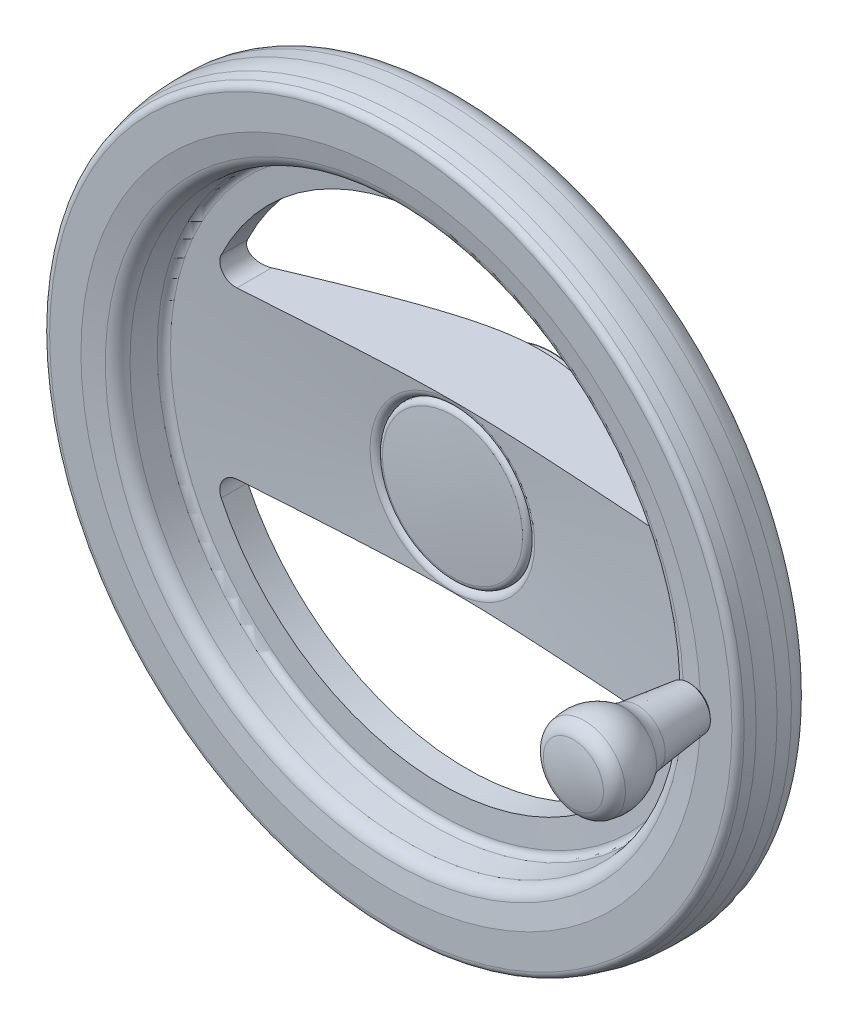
ISO-10303-21;
HEADER;
FILE_DESCRIPTION(('STEP AP214'),'2;1');
FILE_NAME('part.step','',(''),(''),'','','');
FILE_SCHEMA(('AUTOMOTIVE_DESIGN { 1 0 10303 214 1 1 1 1 }'));
ENDSEC;
DATA;
#1=APPLICATION_CONTEXT('core data for automotive mechanical design processes');
#2=APPLICATION_PROTOCOL_DEFINITION('international standard','automotive_design',2000,#1);
#3=PRODUCT_CONTEXT('',#1,'mechanical');
#4=PRODUCT('Part','Part','',(#3));
#5=PRODUCT_RELATED_PRODUCT_CATEGORY('part','',(#4));
#6=PRODUCT_DEFINITION_FORMATION('','',#4);
#7=PRODUCT_DEFINITION_CONTEXT('part definition',#1,'design');
#8=PRODUCT_DEFINITION('design','',#6,#7);
#9=PRODUCT_DEFINITION_SHAPE('','',#8);
#10=(LENGTH_UNIT() NAMED_UNIT(*) SI_UNIT(.MILLI.,.METRE.));
#11=(NAMED_UNIT(*) PLANE_ANGLE_UNIT() SI_UNIT($,.RADIAN.));
#12=(NAMED_UNIT(*) SI_UNIT($,.STERADIAN.) SOLID_ANGLE_UNIT());
#13=UNCERTAINTY_MEASURE_WITH_UNIT(LENGTH_MEASURE(1.E-05),#10,'distance_accuracy_value','');
#14=(GEOMETRIC_REPRESENTATION_CONTEXT(3) GLOBAL_UNCERTAINTY_ASSIGNED_CONTEXT((#13)) GLOBAL_UNIT_ASSIGNED_CONTEXT((#10,
#11,#12)) REPRESENTATION_CONTEXT('',''));
#15=CARTESIAN_POINT('',(0.,0.,0.));
#16=DIRECTION('',(0.,0.,1.));
#17=DIRECTION('',(1.,0.,0.));
#18=AXIS2_PLACEMENT_3D('',#15,#16,#17);
#19=CARTESIAN_POINT('',(160.,-2.04,69.));
#20=DIRECTION('',(0.,0.,-1.));
#21=DIRECTION('',(1.,0.,0.));
#22=AXIS2_PLACEMENT_3D('',#19,#20,#21);
#23=PLANE('',#22);
#24=CARTESIAN_POINT('',(160.,0.,69.0000000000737));
#25=DIRECTION('',(0.,0.,1.));
#26=DIRECTION('',(0.,-1.,0.));
#27=AXIS2_PLACEMENT_3D('',#24,#25,#26);
#28=CIRCLE('',#27,4.0800000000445);
#29=CARTESIAN_POINT('',(160.,-4.08000000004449,69.0000000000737));
#30=VERTEX_POINT('',#29);
#31=EDGE_CURVE('E945',#30,#30,#28,.T.);
#32=ORIENTED_EDGE('',*,*,#31,.F.);
#33=EDGE_LOOP('',(#32));
#34=FACE_BOUND('',#33,.T.);
#35=DIRECTION('',(-0.86602540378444,-0.5,0.));
#36=VECTOR('',#35,1.);
#37=CARTESIAN_POINT('',(160.,2.88675134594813,69.));
#38=LINE('',#37,#36);
#39=CARTESIAN_POINT('',(160.,2.88675134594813,69.));
#40=VERTEX_POINT('',#39);
#41=CARTESIAN_POINT('',(157.5,1.44337567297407,69.));
#42=VERTEX_POINT('',#41);
#43=EDGE_CURVE('E946',#40,#42,#38,.T.);
#44=ORIENTED_EDGE('',*,*,#43,.T.);
#45=DIRECTION('',(0.,-1.,0.));
#46=VECTOR('',#45,1.);
#47=CARTESIAN_POINT('',(157.5,-2.04,69.));
#48=LINE('',#47,#46);
#49=CARTESIAN_POINT('',(157.5,-1.44337567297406,69.));
#50=VERTEX_POINT('',#49);
#51=EDGE_CURVE('E942',#42,#50,#48,.T.);
#52=ORIENTED_EDGE('',*,*,#51,.T.);
#53=DIRECTION('',(0.866025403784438,-0.5,0.));
#54=VECTOR('',#53,1.);
#55=CARTESIAN_POINT('',(157.5,-1.44337567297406,69.));
#56=LINE('',#55,#54);
#57=CARTESIAN_POINT('',(160.,-2.88675134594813,69.));
#58=VERTEX_POINT('',#57);
#59=EDGE_CURVE('E958',#50,#58,#56,.T.);
#60=ORIENTED_EDGE('',*,*,#59,.T.);
#61=DIRECTION('',(0.866025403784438,0.5,0.));
#62=VECTOR('',#61,1.);
#63=CARTESIAN_POINT('',(160.,-2.88675134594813,69.));
#64=LINE('',#63,#62);
#65=CARTESIAN_POINT('',(162.5,-1.44337567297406,69.));
#66=VERTEX_POINT('',#65);
#67=EDGE_CURVE('E955',#58,#66,#64,.T.);
#68=ORIENTED_EDGE('',*,*,#67,.T.);
#69=DIRECTION('',(0.,-1.,0.));
#70=VECTOR('',#69,1.);
#71=CARTESIAN_POINT('',(162.5,-2.04,69.));
#72=LINE('',#71,#70);
#73=CARTESIAN_POINT('',(162.5,1.44337567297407,69.));
#74=VERTEX_POINT('',#73);
#75=EDGE_CURVE('E952',#66,#74,#72,.F.);
#76=ORIENTED_EDGE('',*,*,#75,.T.);
#77=DIRECTION('',(-0.86602540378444,0.5,0.));
#78=VECTOR('',#77,1.);
#79=CARTESIAN_POINT('',(162.5,1.44337567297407,69.));
#80=LINE('',#79,#78);
#81=EDGE_CURVE('E949',#74,#40,#80,.T.);
#82=ORIENTED_EDGE('',*,*,#81,.T.);
#83=EDGE_LOOP('',(#44,#52,#60,#68,#76,#82));
#84=FACE_BOUND('',#83,.T.);
#85=ADVANCED_FACE('F14',(#34,#84),#23,.T.);
#86=CARTESIAN_POINT('',(157.5,1.44337567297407,73.25));
#87=DIRECTION('',(-1.,0.,0.));
#88=DIRECTION('',(0.,-1.,0.));
#89=AXIS2_PLACEMENT_3D('',#86,#87,#88);
#90=PLANE('',#89);
#91=DIRECTION('',(0.,0.,1.));
#92=VECTOR('',#91,1.);
#93=CARTESIAN_POINT('',(157.5,1.44337567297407,73.25));
#94=LINE('',#93,#92);
#95=CARTESIAN_POINT('',(157.5,1.44337567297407,73.25));
#96=VERTEX_POINT('',#95);
#97=EDGE_CURVE('E961',#96,#42,#94,.F.);
#98=ORIENTED_EDGE('',*,*,#97,.F.);
#99=DIRECTION('',(0.,-1.,0.));
#100=VECTOR('',#99,1.);
#101=CARTESIAN_POINT('',(157.5,0.,73.25));
#102=LINE('',#101,#100);
#103=CARTESIAN_POINT('',(157.5,0.,73.2499999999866));
#104=VERTEX_POINT('',#103);
#105=EDGE_CURVE('E1006',#96,#104,#102,.T.);
#106=ORIENTED_EDGE('',*,*,#105,.T.);
#107=DIRECTION('',(0.,-1.,0.));
#108=VECTOR('',#107,1.);
#109=CARTESIAN_POINT('',(157.5,0.,73.25));
#110=LINE('',#109,#108);
#111=CARTESIAN_POINT('',(157.5,-1.44337567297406,73.25));
#112=VERTEX_POINT('',#111);
#113=EDGE_CURVE('E1003',#104,#112,#110,.T.);
#114=ORIENTED_EDGE('',*,*,#113,.T.);
#115=DIRECTION('',(0.,0.,1.));
#116=VECTOR('',#115,1.);
#117=CARTESIAN_POINT('',(157.5,-1.44337567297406,73.25));
#118=LINE('',#117,#116);
#119=EDGE_CURVE('E973',#50,#112,#118,.T.);
#120=ORIENTED_EDGE('',*,*,#119,.F.);
#121=ORIENTED_EDGE('',*,*,#51,.F.);
#122=EDGE_LOOP('',(#98,#106,#114,#120,#121));
#123=FACE_BOUND('',#122,.T.);
#124=ADVANCED_FACE('F1644',(#123),#90,.F.);
#125=CARTESIAN_POINT('',(160.,2.88675134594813,73.25));
#126=DIRECTION('',(-0.5,0.866025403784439,0.));
#127=DIRECTION('',(-0.866025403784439,-0.5,0.));
#128=AXIS2_PLACEMENT_3D('',#125,#126,#127);
#129=PLANE('',#128);
#130=DIRECTION('',(0.,0.,1.));
#131=VECTOR('',#130,1.);
#132=CARTESIAN_POINT('',(160.,2.88675134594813,73.25));
#133=LINE('',#132,#131);
#134=CARTESIAN_POINT('',(160.,2.88675134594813,73.25));
#135=VERTEX_POINT('',#134);
#136=EDGE_CURVE('E965',#135,#40,#133,.F.);
#137=ORIENTED_EDGE('',*,*,#136,.F.);
#138=DIRECTION('',(-0.866025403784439,-0.5,0.));
#139=VECTOR('',#138,1.);
#140=CARTESIAN_POINT('',(160.,2.88675134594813,73.25));
#141=LINE('',#140,#139);
#142=CARTESIAN_POINT('',(158.75,2.16506350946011,73.2499999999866));
#143=VERTEX_POINT('',#142);
#144=EDGE_CURVE('E962',#143,#135,#141,.F.);
#145=ORIENTED_EDGE('',*,*,#144,.F.);
#146=DIRECTION('',(-0.86602540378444,-0.5,0.));
#147=VECTOR('',#146,1.);
#148=CARTESIAN_POINT('',(158.75,2.1650635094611,73.25));
#149=LINE('',#148,#147);
#150=EDGE_CURVE('E1009',#143,#96,#149,.T.);
#151=ORIENTED_EDGE('',*,*,#150,.T.);
#152=ORIENTED_EDGE('',*,*,#97,.T.);
#153=ORIENTED_EDGE('',*,*,#43,.F.);
#154=EDGE_LOOP('',(#137,#145,#151,#152,#153));
#155=FACE_BOUND('',#154,.T.);
#156=ADVANCED_FACE('F1635',(#155),#129,.F.);
#157=CARTESIAN_POINT('',(162.5,1.44337567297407,73.25));
#158=DIRECTION('',(0.5,0.866025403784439,0.));
#159=DIRECTION('',(-0.866025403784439,0.5,0.));
#160=AXIS2_PLACEMENT_3D('',#157,#158,#159);
#161=PLANE('',#160);
#162=DIRECTION('',(0.,0.,1.));
#163=VECTOR('',#162,1.);
#164=CARTESIAN_POINT('',(162.5,1.44337567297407,73.25));
#165=LINE('',#164,#163);
#166=CARTESIAN_POINT('',(162.5,1.44337567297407,73.25));
#167=VERTEX_POINT('',#166);
#168=EDGE_CURVE('E966',#167,#74,#165,.F.);
#169=ORIENTED_EDGE('',*,*,#168,.F.);
#170=DIRECTION('',(-0.86602540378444,0.5,0.));
#171=VECTOR('',#170,1.);
#172=CARTESIAN_POINT('',(162.5,1.44337567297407,73.25));
#173=LINE('',#172,#171);
#174=CARTESIAN_POINT('',(161.25,2.16506350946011,73.2499999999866));
#175=VERTEX_POINT('',#174);
#176=EDGE_CURVE('E993',#167,#175,#173,.T.);
#177=ORIENTED_EDGE('',*,*,#176,.T.);
#178=DIRECTION('',(-0.866025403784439,0.5,0.));
#179=VECTOR('',#178,1.);
#180=CARTESIAN_POINT('',(162.5,1.44337567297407,73.25));
#181=LINE('',#180,#179);
#182=EDGE_CURVE('E967',#135,#175,#181,.F.);
#183=ORIENTED_EDGE('',*,*,#182,.F.);
#184=ORIENTED_EDGE('',*,*,#136,.T.);
#185=ORIENTED_EDGE('',*,*,#81,.F.);
#186=EDGE_LOOP('',(#169,#177,#183,#184,#185));
#187=FACE_BOUND('',#186,.T.);
#188=ADVANCED_FACE('F1626',(#187),#161,.F.);
#189=CARTESIAN_POINT('',(162.5,-1.44337567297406,73.25));
#190=DIRECTION('',(1.,0.,0.));
#191=DIRECTION('',(0.,1.,0.));
#192=AXIS2_PLACEMENT_3D('',#189,#190,#191);
#193=PLANE('',#192);
#194=DIRECTION('',(0.,0.,1.));
#195=VECTOR('',#194,1.);
#196=CARTESIAN_POINT('',(162.5,-1.44337567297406,73.25));
#197=LINE('',#196,#195);
#198=CARTESIAN_POINT('',(162.5,-1.44337567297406,73.25));
#199=VERTEX_POINT('',#198);
#200=EDGE_CURVE('E970',#199,#66,#197,.F.);
#201=ORIENTED_EDGE('',*,*,#200,.F.);
#202=DIRECTION('',(0.,-1.,0.));
#203=VECTOR('',#202,1.);
#204=CARTESIAN_POINT('',(162.5,0.,73.25));
#205=LINE('',#204,#203);
#206=CARTESIAN_POINT('',(162.5,0.,73.2499999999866));
#207=VERTEX_POINT('',#206);
#208=EDGE_CURVE('E987',#199,#207,#205,.F.);
#209=ORIENTED_EDGE('',*,*,#208,.T.);
#210=DIRECTION('',(0.,-1.,0.));
#211=VECTOR('',#210,1.);
#212=CARTESIAN_POINT('',(162.5,0.,73.25));
#213=LINE('',#212,#211);
#214=EDGE_CURVE('E997',#207,#167,#213,.F.);
#215=ORIENTED_EDGE('',*,*,#214,.T.);
#216=ORIENTED_EDGE('',*,*,#168,.T.);
#217=ORIENTED_EDGE('',*,*,#75,.F.);
#218=EDGE_LOOP('',(#201,#209,#215,#216,#217));
#219=FACE_BOUND('',#218,.T.);
#220=ADVANCED_FACE('F1617',(#219),#193,.F.);
#221=CARTESIAN_POINT('',(160.,-2.88675134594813,73.25));
#222=DIRECTION('',(0.5,-0.866025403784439,0.));
#223=DIRECTION('',(0.866025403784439,0.5,0.));
#224=AXIS2_PLACEMENT_3D('',#221,#222,#223);
#225=PLANE('',#224);
#226=DIRECTION('',(0.,0.,1.));
#227=VECTOR('',#226,1.);
#228=CARTESIAN_POINT('',(160.,-2.88675134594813,73.25));
#229=LINE('',#228,#227);
#230=CARTESIAN_POINT('',(160.,-2.88675134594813,73.25));
#231=VERTEX_POINT('',#230);
#232=EDGE_CURVE('E981',#231,#58,#229,.F.);
#233=ORIENTED_EDGE('',*,*,#232,.F.);
#234=DIRECTION('',(0.866025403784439,0.5,0.));
#235=VECTOR('',#234,1.);
#236=CARTESIAN_POINT('',(160.,-2.88675134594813,73.25));
#237=LINE('',#236,#235);
#238=CARTESIAN_POINT('',(161.25,-2.16506350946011,73.2499999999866));
#239=VERTEX_POINT('',#238);
#240=EDGE_CURVE('E977',#239,#231,#237,.F.);
#241=ORIENTED_EDGE('',*,*,#240,.F.);
#242=DIRECTION('',(0.866025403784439,0.5,0.));
#243=VECTOR('',#242,1.);
#244=CARTESIAN_POINT('',(160.,-2.88675134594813,73.25));
#245=LINE('',#244,#243);
#246=EDGE_CURVE('E974',#199,#239,#245,.F.);
#247=ORIENTED_EDGE('',*,*,#246,.F.);
#248=ORIENTED_EDGE('',*,*,#200,.T.);
#249=ORIENTED_EDGE('',*,*,#67,.F.);
#250=EDGE_LOOP('',(#233,#241,#247,#248,#249));
#251=FACE_BOUND('',#250,.T.);
#252=ADVANCED_FACE('F1608',(#251),#225,.F.);
#253=CARTESIAN_POINT('',(157.5,-1.44337567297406,73.25));
#254=DIRECTION('',(-0.5,-0.866025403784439,0.));
#255=DIRECTION('',(0.866025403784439,-0.5,0.));
#256=AXIS2_PLACEMENT_3D('',#253,#254,#255);
#257=PLANE('',#256);
#258=ORIENTED_EDGE('',*,*,#119,.T.);
#259=DIRECTION('',(0.86602540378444,-0.5,0.));
#260=VECTOR('',#259,1.);
#261=CARTESIAN_POINT('',(157.5,-1.44337567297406,73.25));
#262=LINE('',#261,#260);
#263=CARTESIAN_POINT('',(158.75,-2.16506350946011,73.2499999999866));
#264=VERTEX_POINT('',#263);
#265=EDGE_CURVE('E1000',#112,#264,#262,.T.);
#266=ORIENTED_EDGE('',*,*,#265,.T.);
#267=DIRECTION('',(0.866025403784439,-0.5,0.));
#268=VECTOR('',#267,1.);
#269=CARTESIAN_POINT('',(157.5,-1.44337567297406,73.25));
#270=LINE('',#269,#268);
#271=EDGE_CURVE('E978',#231,#264,#270,.F.);
#272=ORIENTED_EDGE('',*,*,#271,.F.);
#273=ORIENTED_EDGE('',*,*,#232,.T.);
#274=ORIENTED_EDGE('',*,*,#59,.F.);
#275=EDGE_LOOP('',(#258,#266,#272,#273,#274));
#276=FACE_BOUND('',#275,.T.);
#277=ADVANCED_FACE('F1599',(#276),#257,.F.);
#278=CARTESIAN_POINT('',(160.,0.,73.25));
#279=DIRECTION('',(0.,0.,1.));
#280=DIRECTION('',(0.,-1.,0.));
#281=AXIS2_PLACEMENT_3D('',#278,#279,#280);
#282=PLANE('',#281);
#283=CARTESIAN_POINT('',(160.,0.,73.2499999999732));
#284=DIRECTION('',(0.,0.,-1.));
#285=DIRECTION('',(0.,1.,0.));
#286=AXIS2_PLACEMENT_3D('',#283,#284,#285);
#287=CIRCLE('',#286,2.49999999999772);
#288=EDGE_CURVE('E990',#175,#143,#287,.F.);
#289=ORIENTED_EDGE('',*,*,#288,.T.);
#290=ORIENTED_EDGE('',*,*,#144,.T.);
#291=ORIENTED_EDGE('',*,*,#182,.T.);
#292=EDGE_LOOP('',(#289,#290,#291));
#293=FACE_BOUND('',#292,.T.);
#294=ADVANCED_FACE('F1590',(#293),#282,.F.);
#295=CARTESIAN_POINT('',(160.,0.,73.25));
#296=DIRECTION('',(0.,0.,1.));
#297=DIRECTION('',(0.,-1.,0.));
#298=AXIS2_PLACEMENT_3D('',#295,#296,#297);
#299=PLANE('',#298);
#300=CARTESIAN_POINT('',(160.,0.,73.2499999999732));
#301=DIRECTION('',(0.,0.,-1.));
#302=DIRECTION('',(0.,1.,0.));
#303=AXIS2_PLACEMENT_3D('',#300,#301,#302);
#304=CIRCLE('',#303,2.49999999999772);
#305=EDGE_CURVE('E1030',#264,#239,#304,.F.);
#306=ORIENTED_EDGE('',*,*,#305,.T.);
#307=ORIENTED_EDGE('',*,*,#240,.T.);
#308=ORIENTED_EDGE('',*,*,#271,.T.);
#309=EDGE_LOOP('',(#306,#307,#308));
#310=FACE_BOUND('',#309,.T.);
#311=ADVANCED_FACE('F1581',(#310),#299,.F.);
#312=CARTESIAN_POINT('',(160.,0.,73.25));
#313=DIRECTION('',(0.,0.,1.));
#314=DIRECTION('',(0.,-1.,0.));
#315=AXIS2_PLACEMENT_3D('',#312,#313,#314);
#316=PLANE('',#315);
#317=ORIENTED_EDGE('',*,*,#208,.F.);
#318=ORIENTED_EDGE('',*,*,#246,.T.);
#319=CARTESIAN_POINT('',(160.,0.,73.2499999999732));
#320=DIRECTION('',(0.,0.,-1.));
#321=DIRECTION('',(0.,1.,0.));
#322=AXIS2_PLACEMENT_3D('',#319,#320,#321);
#323=CIRCLE('',#322,2.49999999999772);
#324=EDGE_CURVE('E984',#207,#239,#323,.T.);
#325=ORIENTED_EDGE('',*,*,#324,.F.);
#326=EDGE_LOOP('',(#317,#318,#325));
#327=FACE_BOUND('',#326,.T.);
#328=ADVANCED_FACE('F1572',(#327),#316,.F.);
#329=CARTESIAN_POINT('',(160.,0.,73.2499999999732));
#330=DIRECTION('',(0.,0.,-1.));
#331=DIRECTION('',(0.,1.,0.));
#332=AXIS2_PLACEMENT_3D('',#329,#330,#331);
#333=CONICAL_SURFACE('',#332,2.49999999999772,1.04719755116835);
#334=CARTESIAN_POINT('',(160.,2.8421709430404E-11,74.6933756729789));
#335=VERTEX_POINT('',#334);
#336=VERTEX_LOOP('',#335);
#337=FACE_BOUND('',#336,.T.);
#338=CARTESIAN_POINT('',(160.,0.,73.2499999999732));
#339=DIRECTION('',(0.,0.,-1.));
#340=DIRECTION('',(0.,1.,0.));
#341=AXIS2_PLACEMENT_3D('',#338,#339,#340);
#342=CIRCLE('',#341,2.49999999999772);
#343=EDGE_CURVE('E996',#143,#104,#342,.F.);
#344=ORIENTED_EDGE('',*,*,#343,.F.);
#345=ORIENTED_EDGE('',*,*,#288,.F.);
#346=CARTESIAN_POINT('',(160.,0.,73.2499999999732));
#347=DIRECTION('',(0.,0.,-1.));
#348=DIRECTION('',(0.,1.,0.));
#349=AXIS2_PLACEMENT_3D('',#346,#347,#348);
#350=CIRCLE('',#349,2.49999999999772);
#351=EDGE_CURVE('E1027',#207,#175,#350,.F.);
#352=ORIENTED_EDGE('',*,*,#351,.F.);
#353=ORIENTED_EDGE('',*,*,#324,.T.);
#354=ORIENTED_EDGE('',*,*,#305,.F.);
#355=CARTESIAN_POINT('',(160.,0.,73.2499999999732));
#356=DIRECTION('',(0.,0.,-1.));
#357=DIRECTION('',(0.,1.,0.));
#358=AXIS2_PLACEMENT_3D('',#355,#356,#357);
#359=CIRCLE('',#358,2.49999999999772);
#360=EDGE_CURVE('E1033',#104,#264,#359,.F.);
#361=ORIENTED_EDGE('',*,*,#360,.F.);
#362=EDGE_LOOP('',(#344,#345,#352,#353,#354,#361));
#363=FACE_BOUND('',#362,.T.);
#364=ADVANCED_FACE('F1563',(#337,#363),#333,.F.);
#365=CARTESIAN_POINT('',(160.,0.,73.25));
#366=DIRECTION('',(0.,0.,1.));
#367=DIRECTION('',(0.,-1.,0.));
#368=AXIS2_PLACEMENT_3D('',#365,#366,#367);
#369=PLANE('',#368);
#370=ORIENTED_EDGE('',*,*,#176,.F.);
#371=ORIENTED_EDGE('',*,*,#214,.F.);
#372=ORIENTED_EDGE('',*,*,#351,.T.);
#373=EDGE_LOOP('',(#370,#371,#372));
#374=FACE_BOUND('',#373,.T.);
#375=ADVANCED_FACE('F1554',(#374),#369,.F.);
#376=CARTESIAN_POINT('',(160.,0.,73.25));
#377=DIRECTION('',(0.,0.,1.));
#378=DIRECTION('',(0.,-1.,0.));
#379=AXIS2_PLACEMENT_3D('',#376,#377,#378);
#380=PLANE('',#379);
#381=ORIENTED_EDGE('',*,*,#265,.F.);
#382=ORIENTED_EDGE('',*,*,#113,.F.);
#383=ORIENTED_EDGE('',*,*,#360,.T.);
#384=EDGE_LOOP('',(#381,#382,#383));
#385=FACE_BOUND('',#384,.T.);
#386=ADVANCED_FACE('F1546',(#385),#380,.F.);
#387=CARTESIAN_POINT('',(160.,0.,73.25));
#388=DIRECTION('',(0.,0.,1.));
#389=DIRECTION('',(0.,-1.,0.));
#390=AXIS2_PLACEMENT_3D('',#387,#388,#389);
#391=PLANE('',#390);
#392=ORIENTED_EDGE('',*,*,#105,.F.);
#393=ORIENTED_EDGE('',*,*,#150,.F.);
#394=ORIENTED_EDGE('',*,*,#343,.T.);
#395=EDGE_LOOP('',(#392,#393,#394));
#396=FACE_BOUND('',#395,.T.);
#397=ADVANCED_FACE('F1538',(#396),#391,.F.);
#398=CARTESIAN_POINT('',(160.,0.,69.9199999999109));
#399=DIRECTION('',(0.,0.,1.));
#400=DIRECTION('',(0.,-1.,0.));
#401=AXIS2_PLACEMENT_3D('',#398,#399,#400);
#402=CONICAL_SURFACE('',#401,4.99999999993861,0.785398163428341);
#403=ORIENTED_EDGE('',*,*,#31,.T.);
#404=EDGE_LOOP('',(#403));
#405=FACE_BOUND('',#404,.T.);
#406=CARTESIAN_POINT('',(160.,0.,69.1080000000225));
#407=DIRECTION('',(0.,0.,1.));
#408=DIRECTION('',(0.,-1.,0.));
#409=AXIS2_PLACEMENT_3D('',#406,#407,#408);
#410=CIRCLE('',#409,4.188);
#411=CARTESIAN_POINT('',(160.,-4.188,69.1080000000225));
#412=VERTEX_POINT('',#411);
#413=EDGE_CURVE('E9',#412,#412,#410,.F.);
#414=ORIENTED_EDGE('',*,*,#413,.T.);
#415=EDGE_LOOP('',(#414));
#416=FACE_BOUND('',#415,.T.);
#417=ADVANCED_FACE('F921',(#405,#416),#402,.T.);
#418=CARTESIAN_POINT('',(160.,0.,87.7284321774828));
#419=DIRECTION('',(0.,0.,1.));
#420=DIRECTION('',(0.,-1.,0.));
#421=AXIS2_PLACEMENT_3D('',#418,#419,#420);
#422=CONICAL_SURFACE('',#421,11.5,0.858106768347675);
#423=CARTESIAN_POINT('',(160.,0.,87.7284321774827));
#424=DIRECTION('',(0.,0.,1.));
#425=DIRECTION('',(0.,-1.,0.));
#426=AXIS2_PLACEMENT_3D('',#423,#424,#425);
#427=CIRCLE('',#426,11.5);
#428=CARTESIAN_POINT('',(160.,-11.5,87.7284321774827));
#429=VERTEX_POINT('',#428);
#430=EDGE_CURVE('E938',#429,#429,#427,.T.);
#431=ORIENTED_EDGE('',*,*,#430,.F.);
#432=EDGE_LOOP('',(#431));
#433=FACE_BOUND('',#432,.T.);
#434=CARTESIAN_POINT('',(160.,0.,86.));
#435=DIRECTION('',(0.,0.,1.));
#436=DIRECTION('',(0.,-1.,0.));
#437=AXIS2_PLACEMENT_3D('',#434,#435,#436);
#438=CIRCLE('',#437,9.5);
#439=CARTESIAN_POINT('',(164.366948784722,-8.43680972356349,86.));
#440=VERTEX_POINT('',#439);
#441=CARTESIAN_POINT('',(164.366948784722,8.4368097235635,86.));
#442=VERTEX_POINT('',#441);
#443=EDGE_CURVE('E941',#440,#442,#438,.T.);
#444=ORIENTED_EDGE('',*,*,#443,.T.);
#445=EDGE_CURVE('E1020',#442,#440,#438,.T.);
#446=ORIENTED_EDGE('',*,*,#445,.T.);
#447=EDGE_LOOP('',(#444,#446));
#448=FACE_BOUND('',#447,.T.);
#449=ADVANCED_FACE('F931',(#433,#448),#422,.T.);
#450=CARTESIAN_POINT('',(160.,0.,114.95784489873));
#451=DIRECTION('',(0.,0.,1.));
#452=DIRECTION('',(-1.,0.,0.));
#453=AXIS2_PLACEMENT_3D('',#450,#451,#452);
#454=CONICAL_SURFACE('',#453,14.7528672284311,0.118898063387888);
#455=CARTESIAN_POINT('',(160.,0.,114.95784489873));
#456=DIRECTION('',(0.,0.,1.));
#457=DIRECTION('',(1.,0.,0.));
#458=AXIS2_PLACEMENT_3D('',#455,#456,#457);
#459=CIRCLE('',#458,14.752867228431);
#460=CARTESIAN_POINT('',(174.752867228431,0.,114.95784489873));
#461=VERTEX_POINT('',#460);
#462=EDGE_CURVE('E1952',#461,#461,#459,.F.);
#463=ORIENTED_EDGE('',*,*,#462,.T.);
#464=EDGE_LOOP('',(#463));
#465=FACE_BOUND('',#464,.T.);
#466=ORIENTED_EDGE('',*,*,#430,.T.);
#467=EDGE_LOOP('',(#466));
#468=FACE_BOUND('',#467,.T.);
#469=ADVANCED_FACE('F930',(#465,#468),#454,.T.);
#470=CARTESIAN_POINT('',(160.,-7.75,86.));
#471=DIRECTION('',(0.,0.,-1.));
#472=DIRECTION('',(1.,0.,0.));
#473=AXIS2_PLACEMENT_3D('',#470,#471,#472);
#474=PLANE('',#473);
#475=CARTESIAN_POINT('',(160.,0.,86.));
#476=DIRECTION('',(0.,0.,-1.));
#477=DIRECTION('',(0.730460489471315,-0.682954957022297,0.));
#478=AXIS2_PLACEMENT_3D('',#475,#476,#477);
#479=CIRCLE('',#478,6.19999999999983);
#480=CARTESIAN_POINT('',(164.528855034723,-4.23432073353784,86.));
#481=VERTEX_POINT('',#480);
#482=CARTESIAN_POINT('',(160.,-6.2,86.));
#483=VERTEX_POINT('',#482);
#484=EDGE_CURVE('E32',#481,#483,#479,.T.);
#485=ORIENTED_EDGE('',*,*,#484,.F.);
#486=CARTESIAN_POINT('',(0.,0.,86.));
#487=DIRECTION('',(0.,0.,-1.));
#488=DIRECTION('',(1.,0.,0.));
#489=AXIS2_PLACEMENT_3D('',#486,#487,#488);
#490=CIRCLE('',#489,164.583333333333);
#491=EDGE_CURVE('E24',#481,#440,#490,.T.);
#492=ORIENTED_EDGE('',*,*,#491,.T.);
#493=ORIENTED_EDGE('',*,*,#445,.F.);
#494=CARTESIAN_POINT('',(164.528855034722,4.23432073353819,86.));
#495=VERTEX_POINT('',#494);
#496=EDGE_CURVE('E1069',#442,#495,#490,.T.);
#497=ORIENTED_EDGE('',*,*,#496,.T.);
#498=CARTESIAN_POINT('',(160.,0.,86.));
#499=DIRECTION('',(0.,0.,-1.));
#500=DIRECTION('',(0.,1.,0.));
#501=AXIS2_PLACEMENT_3D('',#498,#499,#500);
#502=CIRCLE('',#501,6.20000000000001);
#503=CARTESIAN_POINT('',(160.,6.2,86.));
#504=VERTEX_POINT('',#503);
#505=EDGE_CURVE('E191',#504,#495,#502,.T.);
#506=ORIENTED_EDGE('',*,*,#505,.F.);
#507=CARTESIAN_POINT('',(160.,0.,86.));
#508=DIRECTION('',(0.,0.,-1.));
#509=DIRECTION('',(-1.16394349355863E-13,-1.,0.));
#510=AXIS2_PLACEMENT_3D('',#507,#508,#509);
#511=CIRCLE('',#510,6.20000000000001);
#512=EDGE_CURVE('E1205',#483,#504,#511,.T.);
#513=ORIENTED_EDGE('',*,*,#512,.F.);
#514=EDGE_LOOP('',(#485,#492,#493,#497,#506,#513));
#515=FACE_BOUND('',#514,.T.);
#516=ADVANCED_FACE('F1045',(#515),#474,.T.);
#517=CARTESIAN_POINT('',(160.,0.,113.059954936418));
#518=DIRECTION('',(0.,0.,1.));
#519=DIRECTION('',(1.,0.,0.));
#520=AXIS2_PLACEMENT_3D('',#517,#518,#519);
#521=TOROIDAL_SURFACE('',#520,30.6399064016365,16.0000000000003);
#522=ORIENTED_EDGE('',*,*,#462,.F.);
#523=EDGE_LOOP('',(#522));
#524=FACE_BOUND('',#523,.T.);
#525=CARTESIAN_POINT('',(160.,0.,122.480499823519));
#526=DIRECTION('',(0.,0.,1.));
#527=DIRECTION('',(1.,0.,0.));
#528=AXIS2_PLACEMENT_3D('',#525,#526,#527);
#529=CIRCLE('',#528,17.70726034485);
#530=CARTESIAN_POINT('',(177.70726034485,0.,122.480499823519));
#531=VERTEX_POINT('',#530);
#532=EDGE_CURVE('E1956',#531,#531,#529,.T.);
#533=ORIENTED_EDGE('',*,*,#532,.F.);
#534=EDGE_LOOP('',(#533));
#535=FACE_BOUND('',#534,.T.);
#536=ADVANCED_FACE('F1054',(#524,#535),#521,.F.);
#537=CARTESIAN_POINT('',(157.499981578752,0.,137.200108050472));
#538=DIRECTION('',(0.,1.,0.));
#539=DIRECTION('',(1.,0.,0.));
#540=AXIS2_PLACEMENT_3D('',#537,#538,#539);
#541=CIRCLE('',#540,25.0000196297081);
#542=TRIMMED_CURVE('',#541,(PARAMETER_VALUE(-1.47062824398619)),
(PARAMETER_VALUE(1.47062824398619)),.T.,.PARAMETER.);
#543=CARTESIAN_POINT('',(160.,0.,137.200108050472));
#544=DIRECTION('',(0.,0.,1.));
#545=AXIS1_PLACEMENT('',#543,#544);
#546=SURFACE_OF_REVOLUTION('',#542,#545);
#547=CARTESIAN_POINT('',(160.,0.,143.157897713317));
#548=DIRECTION('',(0.,0.,1.));
#549=DIRECTION('',(1.,0.,0.));
#550=AXIS2_PLACEMENT_3D('',#547,#548,#549);
#551=CIRCLE('',#550,21.7797205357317);
#552=CARTESIAN_POINT('',(181.779720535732,0.,143.157897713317));
#553=VERTEX_POINT('',#552);
#554=EDGE_CURVE('E1953',#553,#553,#551,.F.);
#555=ORIENTED_EDGE('',*,*,#554,.T.);
#556=EDGE_LOOP('',(#555));
#557=FACE_BOUND('',#556,.T.);
#558=ORIENTED_EDGE('',*,*,#532,.T.);
#559=EDGE_LOOP('',(#558));
#560=FACE_BOUND('',#559,.T.);
#561=ADVANCED_FACE('F922',(#557,#560),#546,.F.);
#562=CARTESIAN_POINT('',(160.,0.,141.251386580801));
#563=DIRECTION('',(0.,0.,1.));
#564=DIRECTION('',(1.,0.,0.));
#565=AXIS2_PLACEMENT_3D('',#562,#563,#564);
#566=TOROIDAL_SURFACE('',#565,14.0102198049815,7.99999539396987);
#567=CARTESIAN_POINT('',(160.,0.,149.005948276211));
#568=DIRECTION('',(0.,0.,1.));
#569=DIRECTION('',(1.,0.,0.));
#570=AXIS2_PLACEMENT_3D('',#567,#568,#569);
#571=CIRCLE('',#570,15.9766122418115);
#572=CARTESIAN_POINT('',(175.976612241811,0.,149.005948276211));
#573=VERTEX_POINT('',#572);
#574=EDGE_CURVE('E936',#573,#573,#571,.F.);
#575=ORIENTED_EDGE('',*,*,#574,.T.);
#576=EDGE_LOOP('',(#575));
#577=FACE_BOUND('',#576,.T.);
#578=ORIENTED_EDGE('',*,*,#554,.F.);
#579=EDGE_LOOP('',(#578));
#580=FACE_BOUND('',#579,.T.);
#581=ADVANCED_FACE('F912',(#577,#580),#566,.T.);
#582=CARTESIAN_POINT('',(159.999948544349,0.,85.9991722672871));
#583=DIRECTION('',(0.,1.,0.));
#584=DIRECTION('',(1.,0.,0.));
#585=AXIS2_PLACEMENT_3D('',#582,#583,#584);
#586=CIRCLE('',#585,65.0008277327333);
#587=TRIMMED_CURVE('',#586,(PARAMETER_VALUE(-1.57079553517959)),
(PARAMETER_VALUE(1.57079553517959)),.T.,.PARAMETER.);
#588=CARTESIAN_POINT('',(160.,0.,85.9991722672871));
#589=DIRECTION('',(0.,0.,1.));
#590=AXIS1_PLACEMENT('',#588,#589);
#591=SURFACE_OF_REVOLUTION('',#587,#590);
#592=ORIENTED_EDGE('',*,*,#574,.F.);
#593=EDGE_LOOP('',(#592));
#594=FACE_BOUND('',#593,.T.);
#595=CARTESIAN_POINT('',(160.,0.,151.));
#596=VERTEX_POINT('',#595);
#597=VERTEX_LOOP('',#596);
#598=FACE_BOUND('',#597,.T.);
#599=ADVANCED_FACE('F910',(#594,#598),#591,.F.);
#600=CARTESIAN_POINT('',(160.,0.,70.1666666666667));
#601=DIRECTION('',(0.,0.,1.));
#602=DIRECTION('',(0.,-1.,0.));
#603=AXIS2_PLACEMENT_3D('',#600,#601,#602);
#604=CYLINDRICAL_SURFACE('',#603,4.188);
#605=ORIENTED_EDGE('',*,*,#413,.F.);
#606=EDGE_LOOP('',(#605));
#607=FACE_BOUND('',#606,.T.);
#608=CARTESIAN_POINT('',(160.,0.,55.1453333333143));
#609=DIRECTION('',(0.,0.,-1.));
#610=DIRECTION('',(-1.,0.,0.));
#611=AXIS2_PLACEMENT_3D('',#608,#609,#610);
#612=CIRCLE('',#611,4.18800000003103);
#613=CARTESIAN_POINT('',(155.811999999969,0.,55.1453333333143));
#614=VERTEX_POINT('',#613);
#615=EDGE_CURVE('E735',#614,#614,#612,.T.);
#616=ORIENTED_EDGE('',*,*,#615,.T.);
#617=EDGE_LOOP('',(#616));
#618=FACE_BOUND('',#617,.T.);
#619=ADVANCED_FACE('F747',(#607,#618),#604,.F.);
#620=CARTESIAN_POINT('',(160.,0.,54.3333333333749));
#621=DIRECTION('',(0.,0.,-1.));
#622=DIRECTION('',(0.,1.,0.));
#623=AXIS2_PLACEMENT_3D('',#620,#621,#622);
#624=CONICAL_SURFACE('',#623,4.9999999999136,0.785398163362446);
#625=CARTESIAN_POINT('',(160.,0.,54.333333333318));
#626=DIRECTION('',(0.,0.,-1.));
#627=DIRECTION('',(0.,1.,0.));
#628=AXIS2_PLACEMENT_3D('',#625,#626,#627);
#629=CIRCLE('',#628,4.99999999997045);
#630=CARTESIAN_POINT('',(160.,4.99999999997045,54.333333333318));
#631=VERTEX_POINT('',#630);
#632=EDGE_CURVE('E600',#631,#631,#629,.T.);
#633=ORIENTED_EDGE('',*,*,#632,.T.);
#634=EDGE_LOOP('',(#633));
#635=FACE_BOUND('',#634,.T.);
#636=ORIENTED_EDGE('',*,*,#615,.F.);
#637=EDGE_LOOP('',(#636));
#638=FACE_BOUND('',#637,.T.);
#639=ADVANCED_FACE('F919',(#635,#638),#624,.F.);
#640=CARTESIAN_POINT('',(154.166666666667,0.,54.3333333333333));
#641=DIRECTION('',(0.,0.,1.));
#642=DIRECTION('',(0.,-1.,0.));
#643=AXIS2_PLACEMENT_3D('',#640,#641,#642);
#644=PLANE('',#643);
#645=ORIENTED_EDGE('',*,*,#632,.F.);
#646=EDGE_LOOP('',(#645));
#647=FACE_BOUND('',#646,.T.);
#648=CARTESIAN_POINT('',(160.,0.,54.3333333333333));
#649=DIRECTION('',(0.,0.,1.));
#650=DIRECTION('',(0.,-1.,0.));
#651=AXIS2_PLACEMENT_3D('',#648,#649,#650);
#652=CIRCLE('',#651,6.66666666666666);
#653=CARTESIAN_POINT('',(160.,-6.66666666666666,54.3333333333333));
#654=VERTEX_POINT('',#653);
#655=EDGE_CURVE('E556',#654,#654,#652,.F.);
#656=ORIENTED_EDGE('',*,*,#655,.T.);
#657=EDGE_LOOP('',(#656));
#658=FACE_BOUND('',#657,.T.);
#659=ADVANCED_FACE('F573',(#647,#658),#644,.F.);
#660=CARTESIAN_POINT('',(160.,0.,51.1666666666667));
#661=DIRECTION('',(0.,0.,1.));
#662=DIRECTION('',(0.,-1.,0.));
#663=AXIS2_PLACEMENT_3D('',#660,#661,#662);
#664=CYLINDRICAL_SURFACE('',#663,6.66666666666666);
#665=CARTESIAN_POINT('',(160.,0.,48.));
#666=DIRECTION('',(0.,0.,1.));
#667=DIRECTION('',(0.,-1.,0.));
#668=AXIS2_PLACEMENT_3D('',#665,#666,#667);
#669=CIRCLE('',#668,6.66666666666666);
#670=CARTESIAN_POINT('',(160.,-6.66666666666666,48.));
#671=VERTEX_POINT('',#670);
#672=EDGE_CURVE('E552',#671,#671,#669,.T.);
#673=ORIENTED_EDGE('',*,*,#672,.F.);
#674=EDGE_LOOP('',(#673));
#675=FACE_BOUND('',#674,.T.);
#676=ORIENTED_EDGE('',*,*,#655,.F.);
#677=EDGE_LOOP('',(#676));
#678=FACE_BOUND('',#677,.T.);
#679=ADVANCED_FACE('F1139',(#675,#678),#664,.F.);
#680=CARTESIAN_POINT('',(-155.675097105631,0.,48.));
#681=DIRECTION('',(0.,0.,-1.));
#682=DIRECTION('',(1.,0.,0.));
#683=AXIS2_PLACEMENT_3D('',#680,#681,#682);
#684=PLANE('',#683);
#685=CARTESIAN_POINT('',(0.,0.,48.));
#686=DIRECTION('',(0.,0.,1.));
#687=DIRECTION('',(0.,-1.,0.));
#688=AXIS2_PLACEMENT_3D('',#685,#686,#687);
#689=CIRCLE('',#688,174.833333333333);
#690=CARTESIAN_POINT('',(0.,174.833333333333,48.));
#691=VERTEX_POINT('',#690);
#692=CARTESIAN_POINT('',(0.,-174.833333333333,48.));
#693=VERTEX_POINT('',#692);
#694=EDGE_CURVE('E480',#691,#693,#689,.F.);
#695=ORIENTED_EDGE('',*,*,#694,.T.);
#696=CARTESIAN_POINT('',(0.,0.,48.));
#697=DIRECTION('',(0.,0.,1.));
#698=DIRECTION('',(-1.,0.,0.));
#699=AXIS2_PLACEMENT_3D('',#696,#697,#698);
#700=CIRCLE('',#699,174.833333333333);
#701=CARTESIAN_POINT('',(-174.833333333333,0.,48.));
#702=VERTEX_POINT('',#701);
#703=EDGE_CURVE('E516',#693,#702,#700,.F.);
#704=ORIENTED_EDGE('',*,*,#703,.T.);
#705=CARTESIAN_POINT('',(0.,0.,48.));
#706=DIRECTION('',(0.,0.,1.));
#707=DIRECTION('',(0.,1.,0.));
#708=AXIS2_PLACEMENT_3D('',#705,#706,#707);
#709=CIRCLE('',#708,174.833333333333);
#710=EDGE_CURVE('E526',#702,#691,#709,.F.);
#711=ORIENTED_EDGE('',*,*,#710,.T.);
#712=EDGE_LOOP('',(#695,#704,#711));
#713=FACE_BOUND('',#712,.T.);
#714=CARTESIAN_POINT('',(0.,0.,48.));
#715=DIRECTION('',(0.,0.,-1.));
#716=DIRECTION('',(0.,-1.,0.));
#717=AXIS2_PLACEMENT_3D('',#714,#715,#716);
#718=CIRCLE('',#717,136.516860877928);
#719=CARTESIAN_POINT('',(-136.516860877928,0.,48.));
#720=VERTEX_POINT('',#719);
#721=CARTESIAN_POINT('',(0.,-136.516860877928,48.));
#722=VERTEX_POINT('',#721);
#723=EDGE_CURVE('E1093',#720,#722,#718,.F.);
#724=ORIENTED_EDGE('',*,*,#723,.T.);
#725=CARTESIAN_POINT('',(0.,0.,48.));
#726=DIRECTION('',(0.,0.,-1.));
#727=DIRECTION('',(0.,1.,0.));
#728=AXIS2_PLACEMENT_3D('',#725,#726,#727);
#729=CIRCLE('',#728,136.516860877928);
#730=CARTESIAN_POINT('',(0.,136.516860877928,48.));
#731=VERTEX_POINT('',#730);
#732=EDGE_CURVE('E539',#722,#731,#729,.F.);
#733=ORIENTED_EDGE('',*,*,#732,.T.);
#734=CARTESIAN_POINT('',(0.,0.,48.));
#735=DIRECTION('',(0.,0.,-1.));
#736=DIRECTION('',(-1.,0.,0.));
#737=AXIS2_PLACEMENT_3D('',#734,#735,#736);
#738=CIRCLE('',#737,136.516860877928);
#739=EDGE_CURVE('E1083',#731,#720,#738,.F.);
#740=ORIENTED_EDGE('',*,*,#739,.T.);
#741=EDGE_LOOP('',(#724,#733,#740));
#742=FACE_BOUND('',#741,.T.);
#743=ORIENTED_EDGE('',*,*,#672,.T.);
#744=EDGE_LOOP('',(#743));
#745=FACE_BOUND('',#744,.T.);
#746=ADVANCED_FACE('F237',(#713,#742,#745),#684,.T.);
#747=CARTESIAN_POINT('',(160.,0.,82.2));
#748=DIRECTION('',(0.,0.,-1.));
#749=DIRECTION('',(0.,1.,0.));
#750=AXIS2_PLACEMENT_3D('',#747,#748,#749);
#751=TOROIDAL_SURFACE('',#750,6.2,3.8);
#752=CARTESIAN_POINT('',(153.381290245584,-6.84042445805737,84.0516598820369));
#753=CARTESIAN_POINT('',(153.559791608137,-6.98785565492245,84.0842616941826));
#754=CARTESIAN_POINT('',(153.744361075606,-7.12773280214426,84.1179060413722));
#755=CARTESIAN_POINT('',(154.124432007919,-7.39132917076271,84.1870377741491));
#756=CARTESIAN_POINT('',(154.319935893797,-7.51504479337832,84.222525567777));
#757=CARTESIAN_POINT('',(154.72121651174,-7.74556111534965,84.2952007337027));
#758=CARTESIAN_POINT('',(154.927023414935,-7.85230779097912,84.3323930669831));
#759=CARTESIAN_POINT('',(155.34692018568,-8.04741910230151,84.4080958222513));
#760=CARTESIAN_POINT('',(155.561009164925,-8.1357857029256,84.4466061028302));
#761=CARTESIAN_POINT('',(155.994774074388,-8.29281215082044,84.5244424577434));
#762=CARTESIAN_POINT('',(156.214412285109,-8.36157892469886,84.5637627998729));
#763=CARTESIAN_POINT('',(156.658811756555,-8.47927365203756,84.6431245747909));
#764=CARTESIAN_POINT('',(156.883572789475,-8.52820248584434,84.6831659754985));
#765=CARTESIAN_POINT('',(157.335928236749,-8.60545181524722,84.7635517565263));
#766=CARTESIAN_POINT('',(157.56351346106,-8.63382710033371,84.803895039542));
#767=CARTESIAN_POINT('',(158.020221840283,-8.66963410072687,84.8846499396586));
#768=CARTESIAN_POINT('',(158.249344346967,-8.67707414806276,84.9250615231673));
#769=CARTESIAN_POINT('',(158.734071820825,-8.6702451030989,85.0103384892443));
#770=CARTESIAN_POINT('',(158.989650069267,-8.65334398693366,85.0551738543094));
#771=CARTESIAN_POINT('',(159.497830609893,-8.59256218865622,85.1440692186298));
#772=CARTESIAN_POINT('',(159.750431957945,-8.54867317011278,85.1881289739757));
#773=CARTESIAN_POINT('',(160.190131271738,-8.44748824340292,85.2646053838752));
#774=CARTESIAN_POINT('',(160.378502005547,-8.39587466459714,85.2972958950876));
#775=CARTESIAN_POINT('',(160.75041316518,-8.27698055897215,85.3616987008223));
#776=CARTESIAN_POINT('',(160.933952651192,-8.20969700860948,85.3934108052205));
#777=CARTESIAN_POINT('',(161.475551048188,-7.98433038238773,85.4867836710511));
#778=CARTESIAN_POINT('',(161.82449027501,-7.80275398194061,85.5466636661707));
#779=CARTESIAN_POINT('',(162.483707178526,-7.38000046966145,85.6592888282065));
#780=CARTESIAN_POINT('',(162.79415148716,-7.13909475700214,85.7120648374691));
#781=CARTESIAN_POINT('',(163.220936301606,-6.73586339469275,85.7842591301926));
#782=CARTESIAN_POINT('',(163.356755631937,-6.59442110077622,85.8071686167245));
#783=CARTESIAN_POINT('',(163.613183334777,-6.29808535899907,85.8502899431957));
#784=CARTESIAN_POINT('',(163.733804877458,-6.14320375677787,85.8705041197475));
#785=CARTESIAN_POINT('',(163.94996717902,-5.83062483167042,85.9065831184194));
#786=CARTESIAN_POINT('',(164.046610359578,-5.67372206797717,85.9226419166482));
#787=CARTESIAN_POINT('',(164.1765884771,-5.43071392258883,85.9441096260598));
#788=CARTESIAN_POINT('',(164.21733457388,-5.34864722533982,85.9508154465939));
#789=CARTESIAN_POINT('',(164.293234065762,-5.18190859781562,85.9632497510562));
#790=CARTESIAN_POINT('',(164.328390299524,-5.09723801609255,85.9689787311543));
#791=CARTESIAN_POINT('',(164.383236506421,-4.94925042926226,85.9778498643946));
#792=CARTESIAN_POINT('',(164.404509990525,-4.88653510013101,85.9812685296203));
#793=CARTESIAN_POINT('',(164.443013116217,-4.75988601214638,85.9873999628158));
#794=CARTESIAN_POINT('',(164.460246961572,-4.6959535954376,85.9901134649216));
#795=CARTESIAN_POINT('',(164.48249914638,-4.59890879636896,85.9935539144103));
#796=CARTESIAN_POINT('',(164.489339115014,-4.56622109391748,85.9945989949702));
#797=CARTESIAN_POINT('',(164.501614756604,-4.50058153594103,85.9964438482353));
#798=CARTESIAN_POINT('',(164.507050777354,-4.46762974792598,85.9972436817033));
#799=CARTESIAN_POINT('',(164.516342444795,-4.40139016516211,85.9985667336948));
#800=CARTESIAN_POINT('',(164.520193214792,-4.36810165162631,85.9990891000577));
#801=CARTESIAN_POINT('',(164.52601078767,-4.30133143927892,85.999804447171));
#802=CARTESIAN_POINT('',(164.527976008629,-4.26784960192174,85.9999971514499));
#803=CARTESIAN_POINT('',(164.528855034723,-4.23432073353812,86.));
#804=B_SPLINE_CURVE_WITH_KNOTS('',3,(#752,#753,#754,#755,#756,#757,#758,#759,#760,#761,#762,
#763,#764,#765,#766,#767,#768,#769,#770,#771,#772,#773,#774,#775,#776,#777,#778,#779,#780,#781,
#782,#783,#784,#785,#786,#787,#788,#789,#790,#791,#792,#793,#794,#795,#796,#797,#798,#799,#800,
#801,#802,#803),.UNSPECIFIED.,.F.,.F.,(4,2,2,2,2,2,2,2,2,2,2,2,2,2,2,2,2,2,2,2,2,2,2,2,2,4),(0.,
0.701215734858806,1.40258734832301,2.10614902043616,2.8096354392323,3.50920713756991,
4.20874778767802,4.90641674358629,5.60380799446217,6.38250276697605,7.16143819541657,
7.75486346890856,8.34840333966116,9.53579000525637,10.7178427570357,11.3092555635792,
11.9001522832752,12.4537578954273,12.7292057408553,13.0045132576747,13.2033464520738,
13.4019718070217,13.5021825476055,13.6023684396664,13.702860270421,13.8034363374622),.UNSPECIFIED.);
#805=CARTESIAN_POINT('',(153.381290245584,-6.84042445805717,84.0516598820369));
#806=VERTEX_POINT('',#805);
#807=EDGE_CURVE('E179',#806,#481,#804,.T.);
#808=ORIENTED_EDGE('',*,*,#807,.T.);
#809=ORIENTED_EDGE('',*,*,#484,.T.);
#810=ORIENTED_EDGE('',*,*,#512,.T.);
#811=ORIENTED_EDGE('',*,*,#505,.T.);
#812=CARTESIAN_POINT('',(164.528855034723,4.23432073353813,86.));
#813=CARTESIAN_POINT('',(164.528198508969,4.25963549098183,85.9999991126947));
#814=CARTESIAN_POINT('',(164.526914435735,4.28492534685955,85.9998885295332));
#815=CARTESIAN_POINT('',(164.523227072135,4.33541129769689,85.9994717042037));
#816=CARTESIAN_POINT('',(164.520824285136,4.36060742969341,85.99916555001));
#817=CARTESIAN_POINT('',(164.512166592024,4.43578964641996,85.9979927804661));
#818=CARTESIAN_POINT('',(164.50445369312,4.48560551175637,85.9968714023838));
#819=CARTESIAN_POINT('',(164.485869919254,4.58456040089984,85.9940766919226));
#820=CARTESIAN_POINT('',(164.47500202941,4.63370001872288,85.9924038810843));
#821=CARTESIAN_POINT('',(164.450712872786,4.73081554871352,85.9886101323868));
#822=CARTESIAN_POINT('',(164.437317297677,4.77879811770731,85.986493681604));
#823=CARTESIAN_POINT('',(164.408233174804,4.87409926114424,85.9818606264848));
#824=CARTESIAN_POINT('',(164.392542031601,4.92141701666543,85.9793435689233));
#825=CARTESIAN_POINT('',(164.359123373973,5.01533179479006,85.9739539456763));
#826=CARTESIAN_POINT('',(164.341394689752,5.06192838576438,85.9710811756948));
#827=CARTESIAN_POINT('',(164.276746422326,5.22221499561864,85.9605656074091));
#828=CARTESIAN_POINT('',(164.225174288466,5.33399984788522,85.9521103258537));
#829=CARTESIAN_POINT('',(164.112947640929,5.55278852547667,85.9336110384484));
#830=CARTESIAN_POINT('',(164.052286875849,5.65978899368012,85.9235659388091));
#831=CARTESIAN_POINT('',(163.922711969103,5.86956503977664,85.9020318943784));
#832=CARTESIAN_POINT('',(163.853742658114,5.97230551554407,85.8905332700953));
#833=CARTESIAN_POINT('',(163.708869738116,6.17257981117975,85.866314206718));
#834=CARTESIAN_POINT('',(163.632965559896,6.27011320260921,85.8535936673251));
#835=CARTESIAN_POINT('',(163.336192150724,6.62649865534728,85.8037478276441));
#836=CARTESIAN_POINT('',(163.094690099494,6.86806852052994,85.762970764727));
#837=CARTESIAN_POINT('',(162.577124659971,7.30720282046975,85.6751633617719));
#838=CARTESIAN_POINT('',(162.30113369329,7.50485712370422,85.6281461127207));
#839=CARTESIAN_POINT('',(161.70093695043,7.86827995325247,85.5254682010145));
#840=CARTESIAN_POINT('',(161.374665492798,8.0305267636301,85.4694232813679));
#841=CARTESIAN_POINT('',(160.700861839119,8.30138157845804,85.3531844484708));
#842=CARTESIAN_POINT('',(160.353305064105,8.40992620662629,85.2929857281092));
#843=CARTESIAN_POINT('',(159.79771288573,8.53779960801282,85.1963526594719));
#844=CARTESIAN_POINT('',(159.593541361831,8.57543115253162,85.1607591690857));
#845=CARTESIAN_POINT('',(159.182756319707,8.63297649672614,85.0889789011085));
#846=CARTESIAN_POINT('',(158.976142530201,8.65288830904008,85.0527920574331));
#847=CARTESIAN_POINT('',(158.562095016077,8.67512094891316,84.9801063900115));
#848=CARTESIAN_POINT('',(158.354661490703,8.67744581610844,84.943607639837));
#849=CARTESIAN_POINT('',(157.94026536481,8.66477361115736,84.8705256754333));
#850=CARTESIAN_POINT('',(157.733302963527,8.64977022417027,84.8339424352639));
#851=CARTESIAN_POINT('',(157.320259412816,8.60265857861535,84.7607664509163));
#852=CARTESIAN_POINT('',(157.114187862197,8.57046506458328,84.7241745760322));
#853=CARTESIAN_POINT('',(156.705219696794,8.48934803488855,84.6513923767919));
#854=CARTESIAN_POINT('',(156.502324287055,8.44041832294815,84.6152022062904));
#855=CARTESIAN_POINT('',(156.101060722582,8.32635650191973,84.5434729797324));
#856=CARTESIAN_POINT('',(155.902691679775,8.26122760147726,84.5079337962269));
#857=CARTESIAN_POINT('',(155.511604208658,8.11536932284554,84.437719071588));
#858=CARTESIAN_POINT('',(155.318887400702,8.0346355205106,84.403043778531));
#859=CARTESIAN_POINT('',(154.81642263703,7.80050245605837,84.3124496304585));
#860=CARTESIAN_POINT('',(154.512425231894,7.63407722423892,84.2574438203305));
#861=CARTESIAN_POINT('',(154.074249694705,7.35661098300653,84.1779113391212));
#862=CARTESIAN_POINT('',(153.931245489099,7.25955382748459,84.151911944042));
#863=CARTESIAN_POINT('',(153.651484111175,7.05655222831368,84.1009715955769));
#864=CARTESIAN_POINT('',(153.514727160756,6.95060746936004,84.0760306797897));
#865=CARTESIAN_POINT('',(153.381290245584,6.84042445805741,84.0516598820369));
#866=B_SPLINE_CURVE_WITH_KNOTS('',3,(#812,#813,#814,#815,#816,#817,#818,#819,#820,#821,#822,
#823,#824,#825,#826,#827,#828,#829,#830,#831,#832,#833,#834,#835,#836,#837,#838,#839,#840,#841,
#842,#843,#844,#845,#846,#847,#848,#849,#850,#851,#852,#853,#854,#855,#856,#857,#858,#859,#860,
#861,#862,#863,#864,#865),.UNSPECIFIED.,.F.,.F.,(4,2,2,2,2,2,2,2,2,2,2,2,2,2,2,2,2,2,2,2,2,2,2,
2,2,2,4),(0.,0.0759482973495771,0.151862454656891,0.302984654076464,0.453964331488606,
0.603484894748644,0.753175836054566,0.902953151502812,1.27256391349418,1.64243008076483,
2.01490370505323,2.38740792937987,3.4136389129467,4.43775007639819,5.53897679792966,
6.64150004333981,7.27275690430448,7.90408455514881,8.53526718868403,9.16667991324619,
9.80125365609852,10.4360625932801,11.0707458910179,11.7056093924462,12.7550185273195,
13.2790654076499,13.8031308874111),.UNSPECIFIED.);
#867=CARTESIAN_POINT('',(153.381290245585,6.84042445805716,84.051659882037));
#868=VERTEX_POINT('',#867);
#869=EDGE_CURVE('E177',#495,#868,#866,.T.);
#870=ORIENTED_EDGE('',*,*,#869,.T.);
#871=CARTESIAN_POINT('',(153.381290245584,6.84042445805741,84.051659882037));
#872=CARTESIAN_POINT('',(153.243383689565,6.72653837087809,84.0265008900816));
#873=CARTESIAN_POINT('',(153.107950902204,6.61049970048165,83.9975094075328));
#874=CARTESIAN_POINT('',(152.842834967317,6.3736243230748,83.9328208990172));
#875=CARTESIAN_POINT('',(152.713155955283,6.25278427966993,83.8971191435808));
#876=CARTESIAN_POINT('',(152.460514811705,6.00594148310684,83.8199979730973));
#877=CARTESIAN_POINT('',(152.337554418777,5.87993740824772,83.7785770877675));
#878=CARTESIAN_POINT('',(152.098967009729,5.62209547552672,83.6911086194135));
#879=CARTESIAN_POINT('',(151.983358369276,5.49024429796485,83.645050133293));
#880=CARTESIAN_POINT('',(151.760642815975,5.22072485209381,83.5497448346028));
#881=CARTESIAN_POINT('',(151.653532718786,5.08305879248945,83.5004992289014));
#882=CARTESIAN_POINT('',(151.448496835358,4.80170960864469,83.4002857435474));
#883=CARTESIAN_POINT('',(151.350568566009,4.65802812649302,83.3493183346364));
#884=CARTESIAN_POINT('',(151.143310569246,4.33123329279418,83.2356058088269));
#885=CARTESIAN_POINT('',(151.036435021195,4.14656967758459,83.1728121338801));
#886=CARTESIAN_POINT('',(150.838108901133,3.76827880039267,83.0498900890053));
#887=CARTESIAN_POINT('',(150.746658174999,3.57465162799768,82.9897616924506));
#888=CARTESIAN_POINT('',(150.579858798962,3.1796215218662,82.8752021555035));
#889=CARTESIAN_POINT('',(150.504465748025,2.97824189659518,82.8207555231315));
#890=CARTESIAN_POINT('',(150.369631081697,2.56822475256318,82.719984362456));
#891=CARTESIAN_POINT('',(150.310189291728,2.35958731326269,82.6736597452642));
#892=CARTESIAN_POINT('',(150.206923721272,1.93519034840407,82.5911234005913));
#893=CARTESIAN_POINT('',(150.163191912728,1.71939671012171,82.5549714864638));
#894=CARTESIAN_POINT('',(150.091680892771,1.28349007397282,82.4948872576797));
#895=CARTESIAN_POINT('',(150.0639021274,1.06337695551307,82.4709552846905));
#896=CARTESIAN_POINT('',(150.024121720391,0.620438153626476,82.4364412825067));
#897=CARTESIAN_POINT('',(150.012137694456,0.397609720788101,82.4258741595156));
#898=CARTESIAN_POINT('',(150.003921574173,-0.0485532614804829,82.418646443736));
#899=CARTESIAN_POINT('',(150.007688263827,-0.271887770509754,82.4219847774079));
#900=CARTESIAN_POINT('',(150.029926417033,-0.696642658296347,82.4414612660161));
#901=CARTESIAN_POINT('',(150.04701658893,-0.898193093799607,82.4563965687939));
#902=CARTESIAN_POINT('',(150.094299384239,-1.29864243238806,82.4970010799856));
#903=CARTESIAN_POINT('',(150.124490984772,-1.49754154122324,82.5226694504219));
#904=CARTESIAN_POINT('',(150.198052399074,-1.89110951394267,82.5836819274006));
#905=CARTESIAN_POINT('',(150.241405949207,-2.08578328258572,82.6190140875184));
#906=CARTESIAN_POINT('',(150.341400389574,-2.46996532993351,82.6979547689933));
#907=CARTESIAN_POINT('',(150.398041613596,-2.6594734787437,82.7415634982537));
#908=CARTESIAN_POINT('',(150.525602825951,-3.03522615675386,82.8360363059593));
#909=CARTESIAN_POINT('',(150.596731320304,-3.22137399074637,82.8870027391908));
#910=CARTESIAN_POINT('',(150.752548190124,-3.5865206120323,82.9935610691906));
#911=CARTESIAN_POINT('',(150.837236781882,-3.7655192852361,83.0491530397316));
#912=CARTESIAN_POINT('',(151.019991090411,-4.11620218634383,83.1627989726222));
#913=CARTESIAN_POINT('',(151.118082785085,-4.28787133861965,83.220857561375));
#914=CARTESIAN_POINT('',(151.326927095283,-4.62331398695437,83.3369942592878));
#915=CARTESIAN_POINT('',(151.437679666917,-4.78708751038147,83.3950723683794));
#916=CARTESIAN_POINT('',(151.639641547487,-5.0638300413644,83.4936540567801));
#917=CARTESIAN_POINT('',(151.72810728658,-5.17862718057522,83.5346871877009));
#918=CARTESIAN_POINT('',(151.910970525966,-5.40416194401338,83.6147032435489));
#919=CARTESIAN_POINT('',(152.00536857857,-5.51489918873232,83.6536859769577));
#920=CARTESIAN_POINT('',(152.199653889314,-5.73248066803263,83.7288124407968));
#921=CARTESIAN_POINT('',(152.299542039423,-5.83932426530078,83.7649557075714));
#922=CARTESIAN_POINT('',(152.504080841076,-6.04907853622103,83.8336027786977));
#923=CARTESIAN_POINT('',(152.608720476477,-6.15199738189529,83.8661144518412));
#924=CARTESIAN_POINT('',(152.822445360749,-6.35437264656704,83.9269429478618));
#925=CARTESIAN_POINT('',(152.93153009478,-6.45382946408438,83.9552602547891));
#926=CARTESIAN_POINT('',(153.153603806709,-6.64949502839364,84.0071503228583));
#927=CARTESIAN_POINT('',(153.26659149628,-6.74570482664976,84.0307246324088));
#928=CARTESIAN_POINT('',(153.381290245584,-6.84042445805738,84.0516598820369));
#929=B_SPLINE_CURVE_WITH_KNOTS('',3,(#871,#872,#873,#874,#875,#876,#877,#878,#879,#880,#881,
#882,#883,#884,#885,#886,#887,#888,#889,#890,#891,#892,#893,#894,#895,#896,#897,#898,#899,#900,
#901,#902,#903,#904,#905,#906,#907,#908,#909,#910,#911,#912,#913,#914,#915,#916,#917,#918,#919,
#920,#921,#922,#923,#924,#925,#926,#927,#928),.UNSPECIFIED.,.F.,.F.,(4,2,2,2,2,2,2,2,2,2,2,2,2,
2,2,2,2,2,2,2,2,2,2,2,2,2,2,2,4),(0.,0.541775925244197,1.08393514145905,1.62623399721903,
2.16983897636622,2.71323929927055,3.25649223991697,3.92300054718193,4.58950219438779,
5.25413626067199,5.91876305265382,6.58721972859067,7.25569509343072,7.92491537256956,
8.59408398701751,9.20183810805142,9.80954478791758,10.4165035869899,11.0234776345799,
11.6398982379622,12.2563286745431,12.8739712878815,13.4916117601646,13.9433147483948,
14.3950598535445,14.8468785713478,15.2976984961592,15.7484663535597,16.1990868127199),.UNSPECIFIED.);
#930=EDGE_CURVE('E183',#868,#806,#929,.T.);
#931=ORIENTED_EDGE('',*,*,#930,.T.);
#932=EDGE_LOOP('',(#808,#809,#810,#811,#870,#931));
#933=FACE_BOUND('',#932,.T.);
#934=ADVANCED_FACE('F188',(#933),#751,.T.);
#935=CARTESIAN_POINT('',(-172.886733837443,0.,86.));
#936=DIRECTION('',(0.,0.,1.));
#937=DIRECTION('',(0.,-1.,0.));
#938=AXIS2_PLACEMENT_3D('',#935,#936,#937);
#939=PLANE('',#938);
#940=CARTESIAN_POINT('',(0.,0.,86.));
#941=DIRECTION('',(0.,0.,1.));
#942=DIRECTION('',(0.,-1.,0.));
#943=AXIS2_PLACEMENT_3D('',#940,#941,#942);
#944=CIRCLE('',#943,164.583333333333);
#945=EDGE_CURVE('E207',#440,#442,#944,.F.);
#946=ORIENTED_EDGE('',*,*,#945,.T.);
#947=ORIENTED_EDGE('',*,*,#443,.F.);
#948=EDGE_LOOP('',(#946,#947));
#949=FACE_BOUND('',#948,.T.);
#950=CARTESIAN_POINT('',(0.,0.,86.));
#951=DIRECTION('',(0.,0.,-1.));
#952=DIRECTION('',(0.,-1.,0.));
#953=AXIS2_PLACEMENT_3D('',#950,#951,#952);
#954=CIRCLE('',#953,181.190134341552);
#955=CARTESIAN_POINT('',(0.,-181.190134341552,86.));
#956=VERTEX_POINT('',#955);
#957=CARTESIAN_POINT('',(-181.190134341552,0.,86.));
#958=VERTEX_POINT('',#957);
#959=EDGE_CURVE('E865',#956,#958,#954,.T.);
#960=ORIENTED_EDGE('',*,*,#959,.F.);
#961=CARTESIAN_POINT('',(0.,0.,86.));
#962=DIRECTION('',(0.,0.,-1.));
#963=DIRECTION('',(0.,1.,0.));
#964=AXIS2_PLACEMENT_3D('',#961,#962,#963);
#965=CIRCLE('',#964,181.190134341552);
#966=CARTESIAN_POINT('',(0.,181.190134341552,86.));
#967=VERTEX_POINT('',#966);
#968=EDGE_CURVE('E875',#967,#956,#965,.T.);
#969=ORIENTED_EDGE('',*,*,#968,.F.);
#970=CARTESIAN_POINT('',(0.,0.,86.));
#971=DIRECTION('',(0.,0.,-1.));
#972=DIRECTION('',(-1.,0.,0.));
#973=AXIS2_PLACEMENT_3D('',#970,#971,#972);
#974=CIRCLE('',#973,181.190134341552);
#975=EDGE_CURVE('E855',#958,#967,#974,.T.);
#976=ORIENTED_EDGE('',*,*,#975,.F.);
#977=EDGE_LOOP('',(#960,#969,#976));
#978=FACE_BOUND('',#977,.T.);
#979=ADVANCED_FACE('F216',(#949,#978),#939,.T.);
#980=CARTESIAN_POINT('',(0.,0.,86.));
#981=DIRECTION('',(0.,0.,1.));
#982=DIRECTION('',(0.,-1.,0.));
#983=AXIS2_PLACEMENT_3D('',#980,#981,#982);
#984=CONICAL_SURFACE('',#983,164.583333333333,1.39626340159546);
#985=CARTESIAN_POINT('',(0.,0.,84.0516598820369));
#986=DIRECTION('',(0.,0.,1.));
#987=DIRECTION('',(-1.,0.,0.));
#988=AXIS2_PLACEMENT_3D('',#985,#986,#987);
#989=CIRCLE('',#988,153.533747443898);
#990=EDGE_CURVE('E170',#868,#806,#989,.T.);
#991=ORIENTED_EDGE('',*,*,#990,.F.);
#992=ORIENTED_EDGE('',*,*,#869,.F.);
#993=ORIENTED_EDGE('',*,*,#496,.F.);
#994=ORIENTED_EDGE('',*,*,#945,.F.);
#995=ORIENTED_EDGE('',*,*,#491,.F.);
#996=ORIENTED_EDGE('',*,*,#807,.F.);
#997=EDGE_LOOP('',(#991,#992,#993,#994,#995,#996));
#998=FACE_BOUND('',#997,.T.);
#999=ADVANCED_FACE('F174',(#998),#984,.F.);
#1000=CARTESIAN_POINT('',(0.,0.,82.2));
#1001=DIRECTION('',(0.,0.,-1.));
#1002=DIRECTION('',(0.,1.,0.));
#1003=AXIS2_PLACEMENT_3D('',#1000,#1001,#1002);
#1004=TOROIDAL_SURFACE('',#1003,181.190134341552,3.8);
#1005=CARTESIAN_POINT('',(0.,0.,83.1835123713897));
#1006=DIRECTION('',(0.,0.,-1.));
#1007=DIRECTION('',(-1.,0.,0.));
#1008=AXIS2_PLACEMENT_3D('',#1005,#1006,#1007);
#1009=CIRCLE('',#1008,184.860652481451);
#1010=CARTESIAN_POINT('',(-184.860652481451,0.,83.1835123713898));
#1011=VERTEX_POINT('',#1010);
#1012=EDGE_CURVE('E738',#1011,#1011,#1009,.T.);
#1013=ORIENTED_EDGE('',*,*,#1012,.F.);
#1014=EDGE_LOOP('',(#1013));
#1015=FACE_BOUND('',#1014,.T.);
#1016=ORIENTED_EDGE('',*,*,#959,.T.);
#1017=ORIENTED_EDGE('',*,*,#975,.T.);
#1018=ORIENTED_EDGE('',*,*,#968,.T.);
#1019=EDGE_LOOP('',(#1016,#1017,#1018));
#1020=FACE_BOUND('',#1019,.T.);
#1021=ADVANCED_FACE('F215',(#1015,#1020),#1004,.T.);
#1022=CARTESIAN_POINT('',(0.,0.,76.5671209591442));
#1023=DIRECTION('',(0.,0.,-1.));
#1024=DIRECTION('',(0.,1.,0.));
#1025=AXIS2_PLACEMENT_3D('',#1022,#1023,#1024);
#1026=TOROIDAL_SURFACE('',#1025,154.853473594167,7.6);
#1027=CARTESIAN_POINT('',(0.,0.,77.2295046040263));
#1028=DIRECTION('',(0.,0.,1.));
#1029=DIRECTION('',(-1.,0.,0.));
#1030=AXIS2_PLACEMENT_3D('',#1027,#1028,#1029);
#1031=CIRCLE('',#1030,147.282393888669);
#1032=CARTESIAN_POINT('',(-147.282393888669,0.,77.2295046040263));
#1033=VERTEX_POINT('',#1032);
#1034=EDGE_CURVE('E286',#1033,#1033,#1031,.F.);
#1035=ORIENTED_EDGE('',*,*,#1034,.T.);
#1036=EDGE_LOOP('',(#1035));
#1037=FACE_BOUND('',#1036,.T.);
#1038=ORIENTED_EDGE('',*,*,#930,.F.);
#1039=ORIENTED_EDGE('',*,*,#990,.T.);
#1040=EDGE_LOOP('',(#1038,#1039));
#1041=FACE_BOUND('',#1040,.T.);
#1042=ADVANCED_FACE('F184',(#1037,#1041),#1026,.T.);
#1043=CARTESIAN_POINT('',(0.,0.,78.165662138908));
#1044=DIRECTION('',(0.,0.,-1.));
#1045=DIRECTION('',(0.,1.,0.));
#1046=AXIS2_PLACEMENT_3D('',#1043,#1044,#1045);
#1047=CONICAL_SURFACE('',#1046,186.205181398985,0.261799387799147);
#1048=CARTESIAN_POINT('',(0.,0.,78.1656621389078));
#1049=DIRECTION('',(0.,0.,-1.));
#1050=DIRECTION('',(0.,1.,0.));
#1051=AXIS2_PLACEMENT_3D('',#1048,#1049,#1050);
#1052=CIRCLE('',#1051,186.205181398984);
#1053=CARTESIAN_POINT('',(0.,186.205181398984,78.1656621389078));
#1054=VERTEX_POINT('',#1053);
#1055=EDGE_CURVE('E599',#1054,#1054,#1052,.T.);
#1056=ORIENTED_EDGE('',*,*,#1055,.F.);
#1057=EDGE_LOOP('',(#1056));
#1058=FACE_BOUND('',#1057,.T.);
#1059=ORIENTED_EDGE('',*,*,#1012,.T.);
#1060=EDGE_LOOP('',(#1059));
#1061=FACE_BOUND('',#1060,.T.);
#1062=ADVANCED_FACE('F614',(#1058,#1061),#1047,.T.);
#1063=CARTESIAN_POINT('',(0.,0.,77.2295046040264));
#1064=DIRECTION('',(0.,0.,1.));
#1065=DIRECTION('',(0.,-1.,0.));
#1066=AXIS2_PLACEMENT_3D('',#1063,#1064,#1065);
#1067=CONICAL_SURFACE('',#1066,147.282393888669,0.0872664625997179);
#1068=CARTESIAN_POINT('',(0.,0.,63.8916434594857));
#1069=DIRECTION('',(0.,0.,-1.));
#1070=DIRECTION('',(0.,1.,0.));
#1071=AXIS2_PLACEMENT_3D('',#1068,#1069,#1070);
#1072=CIRCLE('',#1071,146.11548224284);
#1073=CARTESIAN_POINT('',(0.,146.11548224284,63.8916434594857));
#1074=VERTEX_POINT('',#1073);
#1075=EDGE_CURVE('E886',#1074,#1074,#1072,.T.);
#1076=ORIENTED_EDGE('',*,*,#1075,.T.);
#1077=EDGE_LOOP('',(#1076));
#1078=FACE_BOUND('',#1077,.T.);
#1079=ORIENTED_EDGE('',*,*,#1034,.F.);
#1080=EDGE_LOOP('',(#1079));
#1081=FACE_BOUND('',#1080,.T.);
#1082=ADVANCED_FACE('F571',(#1078,#1081),#1067,.F.);
#1083=CARTESIAN_POINT('',(0.,0.,68.3305384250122));
#1084=DIRECTION('',(0.,0.,-1.));
#1085=DIRECTION('',(0.,1.,0.));
#1086=AXIS2_PLACEMENT_3D('',#1083,#1084,#1085);
#1087=TOROIDAL_SURFACE('',#1086,149.5,37.9999999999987);
#1088=ORIENTED_EDGE('',*,*,#1055,.T.);
#1089=EDGE_LOOP('',(#1088));
#1090=FACE_BOUND('',#1089,.T.);
#1091=CARTESIAN_POINT('',(0.,0.,68.3305384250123));
#1092=DIRECTION('',(0.,0.,1.));
#1093=DIRECTION('',(0.,-1.,0.));
#1094=AXIS2_PLACEMENT_3D('',#1091,#1092,#1093);
#1095=CIRCLE('',#1094,187.5);
#1096=CARTESIAN_POINT('',(0.,-187.5,68.3305384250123));
#1097=VERTEX_POINT('',#1096);
#1098=EDGE_CURVE('E557',#1097,#1097,#1095,.F.);
#1099=ORIENTED_EDGE('',*,*,#1098,.F.);
#1100=EDGE_LOOP('',(#1099));
#1101=FACE_BOUND('',#1100,.T.);
#1102=ADVANCED_FACE('F566',(#1090,#1101),#1087,.T.);
#1103=CARTESIAN_POINT('',(0.,0.,64.2228352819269));
#1104=DIRECTION('',(0.,0.,-1.));
#1105=DIRECTION('',(0.,1.,0.));
#1106=AXIS2_PLACEMENT_3D('',#1103,#1104,#1105);
#1107=TOROIDAL_SURFACE('',#1106,142.329942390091,3.8);
#1108=CARTESIAN_POINT('',(0.,0.,60.4327668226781));
#1109=DIRECTION('',(0.,0.,1.));
#1110=DIRECTION('',(-1.,0.,0.));
#1111=AXIS2_PLACEMENT_3D('',#1108,#1109,#1110);
#1112=CIRCLE('',#1111,142.604498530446);
#1113=CARTESIAN_POINT('',(-142.604498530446,0.,60.4327668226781));
#1114=VERTEX_POINT('',#1113);
#1115=EDGE_CURVE('E1162',#1114,#1114,#1112,.F.);
#1116=ORIENTED_EDGE('',*,*,#1115,.T.);
#1117=EDGE_LOOP('',(#1116));
#1118=FACE_BOUND('',#1117,.T.);
#1119=ORIENTED_EDGE('',*,*,#1075,.F.);
#1120=EDGE_LOOP('',(#1119));
#1121=FACE_BOUND('',#1120,.T.);
#1122=ADVANCED_FACE('F570',(#1118,#1121),#1107,.F.);
#1123=CARTESIAN_POINT('',(0.,0.,64.4986025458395));
#1124=DIRECTION('',(0.,0.,1.));
#1125=DIRECTION('',(0.,-1.,0.));
#1126=AXIS2_PLACEMENT_3D('',#1123,#1124,#1125);
#1127=CYLINDRICAL_SURFACE('',#1126,187.5);
#1128=ORIENTED_EDGE('',*,*,#1098,.T.);
#1129=EDGE_LOOP('',(#1128));
#1130=FACE_BOUND('',#1129,.T.);
#1131=CARTESIAN_POINT('',(0.,0.,60.6666666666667));
#1132=DIRECTION('',(0.,0.,-1.));
#1133=DIRECTION('',(0.,1.,0.));
#1134=AXIS2_PLACEMENT_3D('',#1131,#1132,#1133);
#1135=CIRCLE('',#1134,187.5);
#1136=CARTESIAN_POINT('',(0.,187.5,60.6666666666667));
#1137=VERTEX_POINT('',#1136);
#1138=EDGE_CURVE('E544',#1137,#1137,#1135,.T.);
#1139=ORIENTED_EDGE('',*,*,#1138,.F.);
#1140=EDGE_LOOP('',(#1139));
#1141=FACE_BOUND('',#1140,.T.);
#1142=ADVANCED_FACE('F612',(#1130,#1141),#1127,.T.);
#1143=CARTESIAN_POINT('',(0.,0.,60.4327668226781));
#1144=DIRECTION('',(0.,0.,1.));
#1145=DIRECTION('',(0.,-1.,0.));
#1146=AXIS2_PLACEMENT_3D('',#1143,#1144,#1145);
#1147=CONICAL_SURFACE('',#1146,142.604498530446,1.49848170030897);
#1148=ORIENTED_EDGE('',*,*,#1115,.F.);
#1149=EDGE_LOOP('',(#1148));
#1150=FACE_BOUND('',#1149,.T.);
#1151=CARTESIAN_POINT('',(109.071809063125,-44.,58.6223103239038));
#1152=CARTESIAN_POINT('',(109.306816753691,-43.9999750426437,58.6380979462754));
#1153=CARTESIAN_POINT('',(109.541801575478,-44.0099400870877,58.6541612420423));
#1154=CARTESIAN_POINT('',(110.010051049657,-44.049660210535,58.6867146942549));
#1155=CARTESIAN_POINT('',(110.243315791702,-44.0794142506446,58.7032048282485));
#1156=CARTESIAN_POINT('',(110.706320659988,-44.1584959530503,58.7364780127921));
#1157=CARTESIAN_POINT('',(110.936063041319,-44.2078104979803,58.7532608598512));
#1158=CARTESIAN_POINT('',(111.390550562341,-44.3256504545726,58.7870064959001));
#1159=CARTESIAN_POINT('',(111.615295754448,-44.3941756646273,58.8039692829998));
#1160=CARTESIAN_POINT('',(112.058293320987,-44.5499848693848,58.8379599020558));
#1161=CARTESIAN_POINT('',(112.27654280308,-44.6372770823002,58.8549877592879));
#1162=CARTESIAN_POINT('',(112.70489832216,-44.8299832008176,58.8889804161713));
#1163=CARTESIAN_POINT('',(112.915004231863,-44.9353973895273,58.9059452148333));
#1164=CARTESIAN_POINT('',(113.325528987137,-45.1635740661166,58.939689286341));
#1165=CARTESIAN_POINT('',(113.5259499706,-45.2863327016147,58.956468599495));
#1166=CARTESIAN_POINT('',(113.915727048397,-45.5483464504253,58.9897302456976));
#1167=CARTESIAN_POINT('',(114.105083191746,-45.6876014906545,59.0062125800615));
#1168=CARTESIAN_POINT('',(114.471378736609,-45.98162127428,59.0387687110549));
#1169=CARTESIAN_POINT('',(114.648318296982,-46.1363858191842,59.0548425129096));
#1170=CARTESIAN_POINT('',(114.988577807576,-46.4603869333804,59.0864802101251));
#1171=CARTESIAN_POINT('',(115.151893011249,-46.6296285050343,59.1020439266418));
#1172=CARTESIAN_POINT('',(115.463669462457,-46.9813436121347,59.1325537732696));
#1173=CARTESIAN_POINT('',(115.612130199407,-47.1638176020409,59.1474998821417));
#1174=CARTESIAN_POINT('',(115.893123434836,-47.5406969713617,59.176676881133));
#1175=CARTESIAN_POINT('',(116.025655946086,-47.7351023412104,59.1909077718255));
#1176=CARTESIAN_POINT('',(116.27367144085,-48.1341969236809,59.2185446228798));
#1177=CARTESIAN_POINT('',(116.389176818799,-48.3388721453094,59.2319516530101));
#1178=CARTESIAN_POINT('',(116.602515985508,-48.7572954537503,59.2578767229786));
#1179=CARTESIAN_POINT('',(116.700349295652,-48.9710437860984,59.2703947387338));
#1180=CARTESIAN_POINT('',(116.877611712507,-49.4060412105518,59.2944603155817));
#1181=CARTESIAN_POINT('',(116.957044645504,-49.6272887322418,59.3060080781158));
#1182=CARTESIAN_POINT('',(117.096950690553,-50.0757426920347,59.328063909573));
#1183=CARTESIAN_POINT('',(117.157424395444,-50.3029489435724,59.3385720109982));
#1184=CARTESIAN_POINT('',(117.258859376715,-50.7612004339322,59.3584622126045));
#1185=CARTESIAN_POINT('',(117.299863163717,-50.9922361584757,59.3678467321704));
#1186=CARTESIAN_POINT('',(117.362251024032,-51.4569847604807,59.3854591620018));
#1187=CARTESIAN_POINT('',(117.383635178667,-51.6906976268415,59.393687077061));
#1188=CARTESIAN_POINT('',(117.406624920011,-52.1592139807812,59.4089390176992));
#1189=CARTESIAN_POINT('',(117.408223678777,-52.3940178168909,59.4159626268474));
#1190=CARTESIAN_POINT('',(117.391607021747,-52.8628695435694,59.4287576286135));
#1191=CARTESIAN_POINT('',(117.373399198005,-53.0969176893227,59.4345295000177));
#1192=CARTESIAN_POINT('',(117.318167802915,-53.5555026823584,59.4446317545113));
#1193=CARTESIAN_POINT('',(117.281740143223,-53.7801106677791,59.4490010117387));
#1194=CARTESIAN_POINT('',(117.190639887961,-54.22561461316,59.4565092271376));
#1195=CARTESIAN_POINT('',(117.135967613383,-54.4465106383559,59.4596482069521));
#1196=CARTESIAN_POINT('',(117.008705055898,-54.8832055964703,59.4646790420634));
#1197=CARTESIAN_POINT('',(116.936106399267,-55.099002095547,59.4665703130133));
#1198=CARTESIAN_POINT('',(116.773509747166,-55.5239623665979,59.4690943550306));
#1199=CARTESIAN_POINT('',(116.683510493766,-55.733125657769,59.4697270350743));
#1200=CARTESIAN_POINT('',(116.585069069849,-55.9382422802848,59.4697257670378));
#1201=B_SPLINE_CURVE_WITH_KNOTS('',3,(#1151,#1152,#1153,#1154,#1155,#1156,#1157,#1158,#1159,
#1160,#1161,#1162,#1163,#1164,#1165,#1166,#1167,#1168,#1169,#1170,#1171,#1172,#1173,#1174,#1175,
#1176,#1177,#1178,#1179,#1180,#1181,#1182,#1183,#1184,#1185,#1186,#1187,#1188,#1189,#1190,#1191,
#1192,#1193,#1194,#1195,#1196,#1197,#1198,#1199,#1200),.UNSPECIFIED.,.F.,.F.,(4,2,2,2,2,2,2,2,2,
2,2,2,2,2,2,2,2,2,2,2,2,2,2,2,4),(0.,0.706395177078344,1.41275327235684,2.11863847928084,
2.82451627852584,3.53070381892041,4.23690239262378,4.94294435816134,5.64898319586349,
6.35501299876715,7.06128775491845,7.76758677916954,8.4738852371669,9.17924630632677,
9.88462647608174,10.5898598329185,11.2950711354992,11.9987355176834,12.7023969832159,
13.4063012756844,14.1099358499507,14.7919297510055,15.4739116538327,16.1562127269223,
16.8385631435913),.UNSPECIFIED.);
#1202=CARTESIAN_POINT('',(109.071809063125,-44.,58.6223103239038));
#1203=VERTEX_POINT('',#1202);
#1204=CARTESIAN_POINT('',(116.585069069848,-55.9382422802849,59.4697257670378));
#1205=VERTEX_POINT('',#1204);
#1206=EDGE_CURVE('E590',#1203,#1205,#1201,.T.);
#1207=ORIENTED_EDGE('',*,*,#1206,.T.);
#1208=CARTESIAN_POINT('',(0.,0.,59.4697257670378));
#1209=DIRECTION('',(0.,0.,-1.));
#1210=DIRECTION('',(0.,1.,0.));
#1211=AXIS2_PLACEMENT_3D('',#1208,#1209,#1210);
#1212=CIRCLE('',#1211,129.310344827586);
#1213=CARTESIAN_POINT('',(-116.585069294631,-55.9382418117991,59.4697257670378));
#1214=VERTEX_POINT('',#1213);
#1215=EDGE_CURVE('E728',#1205,#1214,#1212,.T.);
#1216=ORIENTED_EDGE('',*,*,#1215,.T.);
#1217=CARTESIAN_POINT('',(-116.585069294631,-55.9382418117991,59.4697257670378));
#1218=CARTESIAN_POINT('',(-116.68630835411,-55.7273007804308,59.4697271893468));
#1219=CARTESIAN_POINT('',(-116.778616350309,-55.5120787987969,59.4690579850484));
#1220=CARTESIAN_POINT('',(-116.944814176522,-55.0746574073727,59.466388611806));
#1221=CARTESIAN_POINT('',(-117.01870496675,-54.8524583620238,59.4643885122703));
#1222=CARTESIAN_POINT('',(-117.147475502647,-54.4028108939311,59.459069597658));
#1223=CARTESIAN_POINT('',(-117.202369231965,-54.1753664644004,59.4557517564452));
#1224=CARTESIAN_POINT('',(-117.292842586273,-53.716693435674,59.447817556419));
#1225=CARTESIAN_POINT('',(-117.32842242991,-53.4854648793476,59.4432012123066));
#1226=CARTESIAN_POINT('',(-117.380031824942,-53.0207620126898,59.4326950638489));
#1227=CARTESIAN_POINT('',(-117.396052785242,-52.7872867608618,59.4268047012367));
#1228=CARTESIAN_POINT('',(-117.408410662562,-52.3198466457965,59.4137868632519));
#1229=CARTESIAN_POINT('',(-117.404747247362,-52.0858817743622,59.4066593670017));
#1230=CARTESIAN_POINT('',(-117.37777374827,-51.6191773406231,59.3912117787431));
#1231=CARTESIAN_POINT('',(-117.354467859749,-51.3864375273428,59.3828919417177));
#1232=CARTESIAN_POINT('',(-117.288390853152,-50.9237831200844,59.3651087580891));
#1233=CARTESIAN_POINT('',(-117.245619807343,-50.6938685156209,59.3556454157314));
#1234=CARTESIAN_POINT('',(-117.140884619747,-50.2383072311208,59.3356245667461));
#1235=CARTESIAN_POINT('',(-117.078905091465,-50.0126641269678,59.3250661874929));
#1236=CARTESIAN_POINT('',(-116.936190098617,-49.5673539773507,59.3029222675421));
#1237=CARTESIAN_POINT('',(-116.855448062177,-49.3476890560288,59.2913363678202));
#1238=CARTESIAN_POINT('',(-116.67582007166,-48.9160091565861,59.2672142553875));
#1239=CARTESIAN_POINT('',(-116.576937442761,-48.7039927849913,59.2546782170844));
#1240=CARTESIAN_POINT('',(-116.361680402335,-48.288968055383,59.2287260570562));
#1241=CARTESIAN_POINT('',(-116.245298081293,-48.0859638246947,59.2153095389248));
#1242=CARTESIAN_POINT('',(-115.995635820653,-47.6900636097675,59.1876556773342));
#1243=CARTESIAN_POINT('',(-115.862319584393,-47.4971906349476,59.1734166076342));
#1244=CARTESIAN_POINT('',(-115.580007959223,-47.1234765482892,59.1442417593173));
#1245=CARTESIAN_POINT('',(-115.43101964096,-46.9426300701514,59.1293062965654));
#1246=CARTESIAN_POINT('',(-115.118345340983,-46.5941119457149,59.0988259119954));
#1247=CARTESIAN_POINT('',(-114.954656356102,-46.4264430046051,59.083280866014));
#1248=CARTESIAN_POINT('',(-114.613831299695,-46.1055570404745,59.0516912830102));
#1249=CARTESIAN_POINT('',(-114.436699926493,-45.9523350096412,59.0356469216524));
#1250=CARTESIAN_POINT('',(-114.069750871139,-45.660999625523,59.003120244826));
#1251=CARTESIAN_POINT('',(-113.879903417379,-45.5229238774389,58.9866369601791));
#1252=CARTESIAN_POINT('',(-113.489257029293,-45.2632836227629,58.953381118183));
#1253=CARTESIAN_POINT('',(-113.288458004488,-45.1417192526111,58.9366085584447));
#1254=CARTESIAN_POINT('',(-112.877293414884,-44.9159380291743,58.9028858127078));
#1255=CARTESIAN_POINT('',(-112.666925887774,-44.8117247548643,58.8859355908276));
#1256=CARTESIAN_POINT('',(-112.238158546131,-44.6214147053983,58.8519793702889));
#1257=CARTESIAN_POINT('',(-112.019758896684,-44.5353175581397,58.8349733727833));
#1258=CARTESIAN_POINT('',(-111.579490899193,-44.3828929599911,58.8012571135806));
#1259=CARTESIAN_POINT('',(-111.357710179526,-44.3163124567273,58.7845459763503));
#1260=CARTESIAN_POINT('',(-110.909365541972,-44.2018287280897,58.7513038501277));
#1261=CARTESIAN_POINT('',(-110.682801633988,-44.15392546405,58.7347728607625));
#1262=CARTESIAN_POINT('',(-110.226329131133,-44.0771177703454,58.7020004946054));
#1263=CARTESIAN_POINT('',(-109.996418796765,-44.0482236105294,58.6857592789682));
#1264=CARTESIAN_POINT('',(-109.534949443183,-44.0096523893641,58.6536929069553));
#1265=CARTESIAN_POINT('',(-109.303390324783,-43.9999764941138,58.6378677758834));
#1266=CARTESIAN_POINT('',(-109.071809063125,-44.,58.6223103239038));
#1267=B_SPLINE_CURVE_WITH_KNOTS('',3,(#1217,#1218,#1219,#1220,#1221,#1222,#1223,#1224,#1225,
#1226,#1227,#1228,#1229,#1230,#1231,#1232,#1233,#1234,#1235,#1236,#1237,#1238,#1239,#1240,#1241,
#1242,#1243,#1244,#1245,#1246,#1247,#1248,#1249,#1250,#1251,#1252,#1253,#1254,#1255,#1256,#1257,
#1258,#1259,#1260,#1261,#1262,#1263,#1264,#1265,#1266),.UNSPECIFIED.,.F.,.F.,(4,2,2,2,2,2,2,2,2,
2,2,2,2,2,2,2,2,2,2,2,2,2,2,2,4),(0.,0.701717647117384,1.40339870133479,2.10456214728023,
2.80571765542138,3.50718103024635,4.20865624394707,4.90998166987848,5.61130449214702,
6.31319055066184,7.01532282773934,7.7173265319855,8.41964848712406,9.12350205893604,
9.82703942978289,10.5307208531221,11.2341574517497,11.9393027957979,12.6444539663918,
13.3497504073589,14.0550323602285,14.7507180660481,15.4464023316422,16.1424621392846,
16.838564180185),.UNSPECIFIED.);
#1268=CARTESIAN_POINT('',(-109.071809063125,-44.,58.6223103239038));
#1269=VERTEX_POINT('',#1268);
#1270=EDGE_CURVE('E602',#1214,#1269,#1267,.T.);
#1271=ORIENTED_EDGE('',*,*,#1270,.T.);
#1272=CARTESIAN_POINT('',(-109.071809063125,-44.,58.6223103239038));
#1273=CARTESIAN_POINT('',(-106.79558873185,-44.,58.4694027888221));
#1274=CARTESIAN_POINT('',(-104.519324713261,-44.,58.3171425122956));
#1275=CARTESIAN_POINT('',(-99.9666908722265,-44.,58.0142005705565));
#1276=CARTESIAN_POINT('',(-97.6903210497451,-44.,57.8635189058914));
#1277=CARTESIAN_POINT('',(-93.1374406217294,-44.,57.5640171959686));
#1278=CARTESIAN_POINT('',(-90.8609300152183,-44.,57.4151971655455));
#1279=CARTESIAN_POINT('',(-86.3077637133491,-44.,57.1197937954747));
#1280=CARTESIAN_POINT('',(-84.0311080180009,-44.,56.9732104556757));
#1281=CARTESIAN_POINT('',(-79.4750778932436,-44.,56.6825847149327));
#1282=CARTESIAN_POINT('',(-77.1957032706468,-44.,56.5385453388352));
#1283=CARTESIAN_POINT('',(-72.6367475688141,-44.,56.2537731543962));
#1284=CARTESIAN_POINT('',(-70.3571664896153,-44.,56.1130403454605));
#1285=CARTESIAN_POINT('',(-65.7977597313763,-44.,55.8356468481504));
#1286=CARTESIAN_POINT('',(-63.5179340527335,-44.,55.6989861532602));
#1287=CARTESIAN_POINT('',(-58.9579840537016,-44.,55.4307239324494));
#1288=CARTESIAN_POINT('',(-56.6778597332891,-44.,55.2991224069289));
#1289=CARTESIAN_POINT('',(-52.123315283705,-44.,55.0425975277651));
#1290=CARTESIAN_POINT('',(-49.8488961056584,-44.,54.917657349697));
#1291=CARTESIAN_POINT('',(-45.2996329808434,-44.,54.6757160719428));
#1292=CARTESIAN_POINT('',(-43.0247890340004,-44.,54.5587149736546));
#1293=CARTESIAN_POINT('',(-38.4745614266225,-44.,54.3347395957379));
#1294=CARTESIAN_POINT('',(-36.1991777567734,-44.,54.2277655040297));
#1295=CARTESIAN_POINT('',(-31.6478452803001,-44.,54.0264546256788));
#1296=CARTESIAN_POINT('',(-29.3718964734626,-44.,53.9321178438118));
#1297=CARTESIAN_POINT('',(-24.8207950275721,-44.,53.7592469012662));
#1298=CARTESIAN_POINT('',(-22.5456427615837,-44.,53.6807030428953));
#1299=CARTESIAN_POINT('',(-17.9947507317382,-44.,53.5427689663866));
#1300=CARTESIAN_POINT('',(-15.7190109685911,-44.,53.4833787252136));
#1301=CARTESIAN_POINT('',(-11.167170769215,-44.,53.3870411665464));
#1302=CARTESIAN_POINT('',(-8.89107035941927,-44.,53.3500926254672));
#1303=CARTESIAN_POINT('',(-4.33860037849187,-44.,53.3010717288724));
#1304=CARTESIAN_POINT('',(-2.06223080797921,-44.,53.2889993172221));
#1305=CARTESIAN_POINT('',(2.48160090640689,-44.,53.2906005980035));
#1306=CARTESIAN_POINT('',(4.74906308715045,-44.,53.3041738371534));
#1307=CARTESIAN_POINT('',(9.28370567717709,-44.,53.3558958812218));
#1308=CARTESIAN_POINT('',(11.5508860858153,-44.,53.3940447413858));
#1309=CARTESIAN_POINT('',(16.0848811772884,-44.,53.4924431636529));
#1310=CARTESIAN_POINT('',(18.3516958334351,-44.,53.5526939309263));
#1311=CARTESIAN_POINT('',(22.8847394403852,-44.,53.6920245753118));
#1312=CARTESIAN_POINT('',(25.1509683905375,-44.,53.7711044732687));
#1313=CARTESIAN_POINT('',(29.6842199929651,-44.,53.9447706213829));
#1314=CARTESIAN_POINT('',(31.9512422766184,-44.,54.0393663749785));
#1315=CARTESIAN_POINT('',(36.4847286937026,-44.,54.2409744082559));
#1316=CARTESIAN_POINT('',(38.7511928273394,-44.,54.3479866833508));
#1317=CARTESIAN_POINT('',(43.2835870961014,-44.,54.5718696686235));
#1318=CARTESIAN_POINT('',(45.5495172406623,-44.,54.6887401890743));
#1319=CARTESIAN_POINT('',(50.0809585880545,-44.,54.930294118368));
#1320=CARTESIAN_POINT('',(52.3464697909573,-44.,55.0549775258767));
#1321=CARTESIAN_POINT('',(56.8831553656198,-44.,55.3108931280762));
#1322=CARTESIAN_POINT('',(59.1543288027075,-44.,55.4421418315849));
#1323=CARTESIAN_POINT('',(63.6963808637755,-44.,55.7096286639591));
#1324=CARTESIAN_POINT('',(65.9672594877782,-44.,55.8458667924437));
#1325=CARTESIAN_POINT('',(70.5087759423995,-44.,56.122363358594));
#1326=CARTESIAN_POINT('',(72.779413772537,-44.,56.262621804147));
#1327=CARTESIAN_POINT('',(77.3204853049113,-44.,56.5464064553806));
#1328=CARTESIAN_POINT('',(79.5909190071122,-44.,56.6899326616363));
#1329=CARTESIAN_POINT('',(84.1290982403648,-44.,56.9795045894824));
#1330=CARTESIAN_POINT('',(86.3968439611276,-44.,57.1255473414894));
#1331=CARTESIAN_POINT('',(90.9321917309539,-44.,57.4198472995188));
#1332=CARTESIAN_POINT('',(93.199793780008,-44.,57.5681045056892));
#1333=CARTESIAN_POINT('',(97.7348577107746,-44.,57.8664634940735));
#1334=CARTESIAN_POINT('',(100.002319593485,-44.,58.0165652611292));
#1335=CARTESIAN_POINT('',(104.537138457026,-44.,58.3183340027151));
#1336=CARTESIAN_POINT('',(106.804495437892,-44.,58.4700009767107));
#1337=CARTESIAN_POINT('',(109.071809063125,-44.,58.6223103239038));
#1338=B_SPLINE_CURVE_WITH_KNOTS('',3,(#1272,#1273,#1274,#1275,#1276,#1277,#1278,#1279,#1280,
#1281,#1282,#1283,#1284,#1285,#1286,#1287,#1288,#1289,#1290,#1291,#1292,#1293,#1294,#1295,#1296,
#1297,#1298,#1299,#1300,#1301,#1302,#1303,#1304,#1305,#1306,#1307,#1308,#1309,#1310,#1311,#1312,
#1313,#1314,#1315,#1316,#1317,#1318,#1319,#1320,#1321,#1322,#1323,#1324,#1325,#1326,#1327,#1328,
#1329,#1330,#1331,#1332,#1333,#1334,#1335,#1336,#1337),.UNSPECIFIED.,.F.,.F.,(4,2,2,2,2,2,2,2,2,
2,2,2,2,2,2,2,2,2,2,2,2,2,2,2,2,2,2,2,2,2,2,2,4),(0.,6.84405145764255,13.6881052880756,
20.5322136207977,27.3763214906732,34.2280831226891,41.0798435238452,47.9315929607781,
54.7833429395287,61.6168768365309,68.4504119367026,75.2840750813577,82.1177408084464,
88.9471974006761,95.7766457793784,102.605721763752,109.434782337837,116.237149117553,
123.039531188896,129.842284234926,136.645044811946,143.451987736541,150.258928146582,
157.065737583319,163.872545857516,170.697426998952,177.522307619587,184.347201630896,
191.172096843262,197.989425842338,204.806755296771,211.624028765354,218.441299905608),.UNSPECIFIED.);
#1339=EDGE_CURVE('E710',#1269,#1203,#1338,.T.);
#1340=ORIENTED_EDGE('',*,*,#1339,.T.);
#1341=EDGE_LOOP('',(#1207,#1216,#1271,#1340));
#1342=FACE_BOUND('',#1341,.T.);
#1343=CARTESIAN_POINT('',(0.,0.,53.2688278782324));
#1344=DIRECTION('',(0.,0.,1.));
#1345=DIRECTION('',(-1.,0.,0.));
#1346=AXIS2_PLACEMENT_3D('',#1343,#1344,#1345);
#1347=CIRCLE('',#1346,43.7109935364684);
#1348=CARTESIAN_POINT('',(-43.7109935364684,0.,53.2688278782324));
#1349=VERTEX_POINT('',#1348);
#1350=EDGE_CURVE('E1164',#1349,#1349,#1347,.T.);
#1351=ORIENTED_EDGE('',*,*,#1350,.F.);
#1352=EDGE_LOOP('',(#1351));
#1353=FACE_BOUND('',#1352,.T.);
#1354=CARTESIAN_POINT('',(116.585069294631,55.9382418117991,59.4697257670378));
#1355=CARTESIAN_POINT('',(116.68630835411,55.7273007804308,59.4697271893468));
#1356=CARTESIAN_POINT('',(116.778616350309,55.5120787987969,59.4690579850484));
#1357=CARTESIAN_POINT('',(116.944814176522,55.0746574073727,59.466388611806));
#1358=CARTESIAN_POINT('',(117.01870496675,54.8524583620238,59.4643885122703));
#1359=CARTESIAN_POINT('',(117.147475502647,54.4028108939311,59.459069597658));
#1360=CARTESIAN_POINT('',(117.202369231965,54.1753664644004,59.4557517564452));
#1361=CARTESIAN_POINT('',(117.292842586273,53.716693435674,59.447817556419));
#1362=CARTESIAN_POINT('',(117.32842242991,53.4854648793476,59.4432012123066));
#1363=CARTESIAN_POINT('',(117.380031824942,53.0207620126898,59.4326950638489));
#1364=CARTESIAN_POINT('',(117.396052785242,52.7872867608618,59.4268047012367));
#1365=CARTESIAN_POINT('',(117.408410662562,52.3198466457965,59.4137868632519));
#1366=CARTESIAN_POINT('',(117.404747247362,52.0858817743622,59.4066593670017));
#1367=CARTESIAN_POINT('',(117.37777374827,51.6191773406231,59.3912117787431));
#1368=CARTESIAN_POINT('',(117.354467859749,51.3864375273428,59.3828919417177));
#1369=CARTESIAN_POINT('',(117.288390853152,50.9237831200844,59.3651087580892));
#1370=CARTESIAN_POINT('',(117.245619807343,50.6938685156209,59.3556454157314));
#1371=CARTESIAN_POINT('',(117.140884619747,50.2383072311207,59.3356245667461));
#1372=CARTESIAN_POINT('',(117.078905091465,50.0126641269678,59.3250661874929));
#1373=CARTESIAN_POINT('',(116.936190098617,49.5673539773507,59.3029222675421));
#1374=CARTESIAN_POINT('',(116.855448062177,49.3476890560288,59.2913363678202));
#1375=CARTESIAN_POINT('',(116.67582007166,48.9160091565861,59.2672142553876));
#1376=CARTESIAN_POINT('',(116.576937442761,48.7039927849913,59.2546782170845));
#1377=CARTESIAN_POINT('',(116.361680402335,48.288968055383,59.2287260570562));
#1378=CARTESIAN_POINT('',(116.245298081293,48.0859638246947,59.2153095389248));
#1379=CARTESIAN_POINT('',(115.995635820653,47.6900636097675,59.1876556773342));
#1380=CARTESIAN_POINT('',(115.862319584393,47.4971906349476,59.1734166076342));
#1381=CARTESIAN_POINT('',(115.580007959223,47.1234765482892,59.1442417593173));
#1382=CARTESIAN_POINT('',(115.43101964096,46.9426300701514,59.1293062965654));
#1383=CARTESIAN_POINT('',(115.118345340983,46.5941119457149,59.0988259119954));
#1384=CARTESIAN_POINT('',(114.954656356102,46.4264430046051,59.083280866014));
#1385=CARTESIAN_POINT('',(114.613831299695,46.1055570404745,59.0516912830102));
#1386=CARTESIAN_POINT('',(114.436699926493,45.9523350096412,59.0356469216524));
#1387=CARTESIAN_POINT('',(114.069750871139,45.660999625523,59.003120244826));
#1388=CARTESIAN_POINT('',(113.879903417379,45.5229238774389,58.9866369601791));
#1389=CARTESIAN_POINT('',(113.489257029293,45.2632836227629,58.953381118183));
#1390=CARTESIAN_POINT('',(113.288458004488,45.1417192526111,58.9366085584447));
#1391=CARTESIAN_POINT('',(112.877293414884,44.9159380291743,58.9028858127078));
#1392=CARTESIAN_POINT('',(112.666925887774,44.8117247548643,58.8859355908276));
#1393=CARTESIAN_POINT('',(112.238158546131,44.6214147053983,58.8519793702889));
#1394=CARTESIAN_POINT('',(112.019758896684,44.5353175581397,58.8349733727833));
#1395=CARTESIAN_POINT('',(111.579490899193,44.3828929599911,58.8012571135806));
#1396=CARTESIAN_POINT('',(111.357710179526,44.3163124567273,58.7845459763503));
#1397=CARTESIAN_POINT('',(110.909365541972,44.2018287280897,58.7513038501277));
#1398=CARTESIAN_POINT('',(110.682801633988,44.15392546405,58.7347728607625));
#1399=CARTESIAN_POINT('',(110.226329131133,44.0771177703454,58.7020004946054));
#1400=CARTESIAN_POINT('',(109.996418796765,44.0482236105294,58.6857592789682));
#1401=CARTESIAN_POINT('',(109.534949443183,44.0096523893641,58.6536929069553));
#1402=CARTESIAN_POINT('',(109.303390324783,43.9999764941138,58.6378677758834));
#1403=CARTESIAN_POINT('',(109.071809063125,44.,58.6223103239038));
#1404=B_SPLINE_CURVE_WITH_KNOTS('',3,(#1354,#1355,#1356,#1357,#1358,#1359,#1360,#1361,#1362,
#1363,#1364,#1365,#1366,#1367,#1368,#1369,#1370,#1371,#1372,#1373,#1374,#1375,#1376,#1377,#1378,
#1379,#1380,#1381,#1382,#1383,#1384,#1385,#1386,#1387,#1388,#1389,#1390,#1391,#1392,#1393,#1394,
#1395,#1396,#1397,#1398,#1399,#1400,#1401,#1402,#1403),.UNSPECIFIED.,.F.,.F.,(4,2,2,2,2,2,2,2,2,
2,2,2,2,2,2,2,2,2,2,2,2,2,2,2,4),(0.,0.701717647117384,1.40339870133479,2.10456214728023,
2.80571765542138,3.50718103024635,4.20865624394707,4.90998166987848,5.61130449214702,
6.31319055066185,7.01532282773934,7.7173265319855,8.41964848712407,9.12350205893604,
9.82703942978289,10.5307208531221,11.2341574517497,11.9393027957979,12.6444539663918,
13.3497504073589,14.0550323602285,14.7507180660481,15.4464023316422,16.1424621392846,
16.838564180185),.UNSPECIFIED.);
#1405=CARTESIAN_POINT('',(116.58506918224,55.938242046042,59.4697257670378));
#1406=VERTEX_POINT('',#1405);
#1407=CARTESIAN_POINT('',(109.071809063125,44.,58.6223103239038));
#1408=VERTEX_POINT('',#1407);
#1409=EDGE_CURVE('E624',#1406,#1408,#1404,.T.);
#1410=ORIENTED_EDGE('',*,*,#1409,.T.);
#1411=CARTESIAN_POINT('',(109.071809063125,44.,58.6223103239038));
#1412=CARTESIAN_POINT('',(106.79558873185,44.,58.4694027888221));
#1413=CARTESIAN_POINT('',(104.519324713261,44.,58.3171425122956));
#1414=CARTESIAN_POINT('',(99.9666908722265,44.,58.0142005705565));
#1415=CARTESIAN_POINT('',(97.6903210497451,44.,57.8635189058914));
#1416=CARTESIAN_POINT('',(93.1374406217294,44.,57.5640171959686));
#1417=CARTESIAN_POINT('',(90.8609300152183,44.,57.4151971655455));
#1418=CARTESIAN_POINT('',(86.3077637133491,44.,57.1197937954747));
#1419=CARTESIAN_POINT('',(84.0311080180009,44.,56.9732104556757));
#1420=CARTESIAN_POINT('',(79.4750778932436,44.,56.6825847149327));
#1421=CARTESIAN_POINT('',(77.1957032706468,44.,56.5385453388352));
#1422=CARTESIAN_POINT('',(72.6367475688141,44.,56.2537731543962));
#1423=CARTESIAN_POINT('',(70.3571664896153,44.,56.1130403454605));
#1424=CARTESIAN_POINT('',(65.7977597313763,44.,55.8356468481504));
#1425=CARTESIAN_POINT('',(63.5179340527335,44.,55.6989861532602));
#1426=CARTESIAN_POINT('',(58.9579840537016,44.,55.4307239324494));
#1427=CARTESIAN_POINT('',(56.6778597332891,44.,55.2991224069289));
#1428=CARTESIAN_POINT('',(52.123315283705,44.,55.0425975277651));
#1429=CARTESIAN_POINT('',(49.8488961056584,44.,54.917657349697));
#1430=CARTESIAN_POINT('',(45.2996329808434,44.,54.6757160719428));
#1431=CARTESIAN_POINT('',(43.0247890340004,44.,54.5587149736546));
#1432=CARTESIAN_POINT('',(38.4745614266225,44.,54.3347395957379));
#1433=CARTESIAN_POINT('',(36.1991777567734,44.,54.2277655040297));
#1434=CARTESIAN_POINT('',(31.6478452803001,44.,54.0264546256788));
#1435=CARTESIAN_POINT('',(29.3718964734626,44.,53.9321178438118));
#1436=CARTESIAN_POINT('',(24.8207950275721,44.,53.7592469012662));
#1437=CARTESIAN_POINT('',(22.5456427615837,44.,53.6807030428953));
#1438=CARTESIAN_POINT('',(17.9947507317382,44.,53.5427689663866));
#1439=CARTESIAN_POINT('',(15.7190109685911,44.,53.4833787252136));
#1440=CARTESIAN_POINT('',(11.167170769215,44.,53.3870411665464));
#1441=CARTESIAN_POINT('',(8.89107035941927,44.,53.3500926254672));
#1442=CARTESIAN_POINT('',(4.33860037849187,44.,53.3010717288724));
#1443=CARTESIAN_POINT('',(2.06223080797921,44.,53.2889993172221));
#1444=CARTESIAN_POINT('',(-2.48160090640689,44.,53.2906005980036));
#1445=CARTESIAN_POINT('',(-4.74906308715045,44.,53.3041738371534));
#1446=CARTESIAN_POINT('',(-9.28370567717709,44.,53.3558958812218));
#1447=CARTESIAN_POINT('',(-11.5508860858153,44.,53.3940447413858));
#1448=CARTESIAN_POINT('',(-16.0848811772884,44.,53.4924431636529));
#1449=CARTESIAN_POINT('',(-18.3516958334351,44.,53.5526939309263));
#1450=CARTESIAN_POINT('',(-22.8847394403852,44.,53.6920245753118));
#1451=CARTESIAN_POINT('',(-25.1509683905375,44.,53.7711044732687));
#1452=CARTESIAN_POINT('',(-29.6842199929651,44.,53.9447706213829));
#1453=CARTESIAN_POINT('',(-31.9512422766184,44.,54.0393663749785));
#1454=CARTESIAN_POINT('',(-36.4847286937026,44.,54.2409744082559));
#1455=CARTESIAN_POINT('',(-38.7511928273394,44.,54.3479866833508));
#1456=CARTESIAN_POINT('',(-43.2835870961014,44.,54.5718696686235));
#1457=CARTESIAN_POINT('',(-45.5495172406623,44.,54.6887401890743));
#1458=CARTESIAN_POINT('',(-50.0809585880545,44.,54.930294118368));
#1459=CARTESIAN_POINT('',(-52.3464697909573,44.,55.0549775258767));
#1460=CARTESIAN_POINT('',(-56.8831553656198,44.,55.3108931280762));
#1461=CARTESIAN_POINT('',(-59.1543288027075,44.,55.4421418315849));
#1462=CARTESIAN_POINT('',(-63.6963808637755,44.,55.7096286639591));
#1463=CARTESIAN_POINT('',(-65.9672594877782,44.,55.8458667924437));
#1464=CARTESIAN_POINT('',(-70.5087759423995,44.,56.122363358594));
#1465=CARTESIAN_POINT('',(-72.779413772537,44.,56.262621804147));
#1466=CARTESIAN_POINT('',(-77.3204853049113,44.,56.5464064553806));
#1467=CARTESIAN_POINT('',(-79.5909190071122,44.,56.6899326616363));
#1468=CARTESIAN_POINT('',(-84.1290982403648,44.,56.9795045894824));
#1469=CARTESIAN_POINT('',(-86.3968439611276,44.,57.1255473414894));
#1470=CARTESIAN_POINT('',(-90.9321917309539,44.,57.4198472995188));
#1471=CARTESIAN_POINT('',(-93.199793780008,44.,57.5681045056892));
#1472=CARTESIAN_POINT('',(-97.7348577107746,44.,57.8664634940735));
#1473=CARTESIAN_POINT('',(-100.002319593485,44.,58.0165652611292));
#1474=CARTESIAN_POINT('',(-104.537138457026,44.,58.3183340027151));
#1475=CARTESIAN_POINT('',(-106.804495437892,44.,58.4700009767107));
#1476=CARTESIAN_POINT('',(-109.071809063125,44.,58.6223103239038));
#1477=B_SPLINE_CURVE_WITH_KNOTS('',3,(#1411,#1412,#1413,#1414,#1415,#1416,#1417,#1418,#1419,
#1420,#1421,#1422,#1423,#1424,#1425,#1426,#1427,#1428,#1429,#1430,#1431,#1432,#1433,#1434,#1435,
#1436,#1437,#1438,#1439,#1440,#1441,#1442,#1443,#1444,#1445,#1446,#1447,#1448,#1449,#1450,#1451,
#1452,#1453,#1454,#1455,#1456,#1457,#1458,#1459,#1460,#1461,#1462,#1463,#1464,#1465,#1466,#1467,
#1468,#1469,#1470,#1471,#1472,#1473,#1474,#1475,#1476),.UNSPECIFIED.,.F.,.F.,(4,2,2,2,2,2,2,2,2,
2,2,2,2,2,2,2,2,2,2,2,2,2,2,2,2,2,2,2,2,2,2,2,4),(0.,6.84405145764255,13.6881052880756,
20.5322136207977,27.3763214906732,34.2280831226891,41.0798435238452,47.9315929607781,
54.7833429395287,61.6168768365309,68.4504119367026,75.2840750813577,82.1177408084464,
88.9471974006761,95.7766457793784,102.605721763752,109.434782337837,116.237149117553,
123.039531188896,129.842284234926,136.645044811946,143.451987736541,150.258928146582,
157.065737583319,163.872545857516,170.697426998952,177.522307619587,184.347201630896,
191.172096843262,197.989425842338,204.806755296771,211.624028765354,218.441299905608),.UNSPECIFIED.);
#1478=CARTESIAN_POINT('',(-109.071809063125,44.,58.6223103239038));
#1479=VERTEX_POINT('',#1478);
#1480=EDGE_CURVE('E639',#1408,#1479,#1477,.T.);
#1481=ORIENTED_EDGE('',*,*,#1480,.T.);
#1482=CARTESIAN_POINT('',(-109.071809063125,44.,58.6223103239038));
#1483=CARTESIAN_POINT('',(-109.306816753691,43.9999750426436,58.6380979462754));
#1484=CARTESIAN_POINT('',(-109.541801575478,44.0099400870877,58.6541612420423));
#1485=CARTESIAN_POINT('',(-110.010051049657,44.049660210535,58.6867146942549));
#1486=CARTESIAN_POINT('',(-110.243315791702,44.0794142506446,58.7032048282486));
#1487=CARTESIAN_POINT('',(-110.706320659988,44.1584959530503,58.7364780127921));
#1488=CARTESIAN_POINT('',(-110.936063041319,44.2078104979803,58.7532608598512));
#1489=CARTESIAN_POINT('',(-111.390550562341,44.3256504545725,58.7870064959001));
#1490=CARTESIAN_POINT('',(-111.615295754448,44.3941756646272,58.8039692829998));
#1491=CARTESIAN_POINT('',(-112.058293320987,44.5499848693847,58.8379599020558));
#1492=CARTESIAN_POINT('',(-112.27654280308,44.6372770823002,58.8549877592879));
#1493=CARTESIAN_POINT('',(-112.70489832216,44.8299832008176,58.8889804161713));
#1494=CARTESIAN_POINT('',(-112.915004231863,44.9353973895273,58.9059452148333));
#1495=CARTESIAN_POINT('',(-113.325528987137,45.1635740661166,58.939689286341));
#1496=CARTESIAN_POINT('',(-113.5259499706,45.2863327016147,58.956468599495));
#1497=CARTESIAN_POINT('',(-113.915727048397,45.5483464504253,58.9897302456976));
#1498=CARTESIAN_POINT('',(-114.105083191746,45.6876014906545,59.0062125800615));
#1499=CARTESIAN_POINT('',(-114.471378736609,45.98162127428,59.0387687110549));
#1500=CARTESIAN_POINT('',(-114.648318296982,46.1363858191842,59.0548425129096));
#1501=CARTESIAN_POINT('',(-114.988577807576,46.4603869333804,59.0864802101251));
#1502=CARTESIAN_POINT('',(-115.151893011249,46.6296285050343,59.1020439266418));
#1503=CARTESIAN_POINT('',(-115.463669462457,46.9813436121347,59.1325537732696));
#1504=CARTESIAN_POINT('',(-115.612130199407,47.1638176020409,59.1474998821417));
#1505=CARTESIAN_POINT('',(-115.893123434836,47.5406969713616,59.176676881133));
#1506=CARTESIAN_POINT('',(-116.025655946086,47.7351023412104,59.1909077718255));
#1507=CARTESIAN_POINT('',(-116.27367144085,48.1341969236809,59.2185446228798));
#1508=CARTESIAN_POINT('',(-116.389176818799,48.3388721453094,59.2319516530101));
#1509=CARTESIAN_POINT('',(-116.602515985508,48.7572954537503,59.2578767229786));
#1510=CARTESIAN_POINT('',(-116.700349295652,48.9710437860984,59.2703947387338));
#1511=CARTESIAN_POINT('',(-116.877611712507,49.4060412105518,59.2944603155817));
#1512=CARTESIAN_POINT('',(-116.957044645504,49.6272887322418,59.3060080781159));
#1513=CARTESIAN_POINT('',(-117.096950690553,50.0757426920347,59.328063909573));
#1514=CARTESIAN_POINT('',(-117.157424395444,50.3029489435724,59.3385720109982));
#1515=CARTESIAN_POINT('',(-117.258859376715,50.7612004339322,59.3584622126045));
#1516=CARTESIAN_POINT('',(-117.299863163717,50.9922361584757,59.3678467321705));
#1517=CARTESIAN_POINT('',(-117.362251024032,51.4569847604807,59.3854591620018));
#1518=CARTESIAN_POINT('',(-117.383635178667,51.6906976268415,59.393687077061));
#1519=CARTESIAN_POINT('',(-117.406624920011,52.1592139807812,59.4089390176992));
#1520=CARTESIAN_POINT('',(-117.408223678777,52.3940178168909,59.4159626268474));
#1521=CARTESIAN_POINT('',(-117.391607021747,52.8628695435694,59.4287576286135));
#1522=CARTESIAN_POINT('',(-117.373399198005,53.0969176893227,59.4345295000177));
#1523=CARTESIAN_POINT('',(-117.318167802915,53.5555026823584,59.4446317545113));
#1524=CARTESIAN_POINT('',(-117.281740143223,53.7801106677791,59.4490010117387));
#1525=CARTESIAN_POINT('',(-117.190639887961,54.22561461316,59.4565092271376));
#1526=CARTESIAN_POINT('',(-117.135967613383,54.4465106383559,59.4596482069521));
#1527=CARTESIAN_POINT('',(-117.008705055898,54.8832055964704,59.4646790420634));
#1528=CARTESIAN_POINT('',(-116.936106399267,55.0990020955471,59.4665703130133));
#1529=CARTESIAN_POINT('',(-116.773509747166,55.523962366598,59.4690943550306));
#1530=CARTESIAN_POINT('',(-116.683510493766,55.733125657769,59.4697270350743));
#1531=CARTESIAN_POINT('',(-116.585069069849,55.9382422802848,59.4697257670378));
#1532=B_SPLINE_CURVE_WITH_KNOTS('',3,(#1482,#1483,#1484,#1485,#1486,#1487,#1488,#1489,#1490,
#1491,#1492,#1493,#1494,#1495,#1496,#1497,#1498,#1499,#1500,#1501,#1502,#1503,#1504,#1505,#1506,
#1507,#1508,#1509,#1510,#1511,#1512,#1513,#1514,#1515,#1516,#1517,#1518,#1519,#1520,#1521,#1522,
#1523,#1524,#1525,#1526,#1527,#1528,#1529,#1530,#1531),.UNSPECIFIED.,.F.,.F.,(4,2,2,2,2,2,2,2,2,
2,2,2,2,2,2,2,2,2,2,2,2,2,2,2,4),(0.,0.706395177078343,1.41275327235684,2.11863847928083,
2.82451627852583,3.53070381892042,4.23690239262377,4.94294435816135,5.64898319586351,
6.35501299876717,7.06128775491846,7.76758677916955,8.47388523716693,9.1792463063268,
9.8846264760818,10.5898598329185,11.2950711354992,11.9987355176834,12.7023969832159,
13.4063012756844,14.1099358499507,14.7919297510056,15.4739116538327,16.1562127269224,
16.8385631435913),.UNSPECIFIED.);
#1533=CARTESIAN_POINT('',(-116.585069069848,55.9382422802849,59.4697257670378));
#1534=VERTEX_POINT('',#1533);
#1535=EDGE_CURVE('E633',#1479,#1534,#1532,.T.);
#1536=ORIENTED_EDGE('',*,*,#1535,.T.);
#1537=CARTESIAN_POINT('',(0.,0.,59.4697257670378));
#1538=DIRECTION('',(0.,0.,-1.));
#1539=DIRECTION('',(0.,1.,0.));
#1540=AXIS2_PLACEMENT_3D('',#1537,#1538,#1539);
#1541=CIRCLE('',#1540,129.310344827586);
#1542=EDGE_CURVE('E732',#1534,#1406,#1541,.T.);
#1543=ORIENTED_EDGE('',*,*,#1542,.T.);
#1544=EDGE_LOOP('',(#1410,#1481,#1536,#1543));
#1545=FACE_BOUND('',#1544,.T.);
#1546=ADVANCED_FACE('F499',(#1150,#1342,#1353,#1545),#1147,.F.);
#1547=CARTESIAN_POINT('',(0.,0.,60.6666666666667));
#1548=DIRECTION('',(0.,0.,-1.));
#1549=DIRECTION('',(0.,1.,0.));
#1550=AXIS2_PLACEMENT_3D('',#1547,#1548,#1549);
#1551=TOROIDAL_SURFACE('',#1550,174.833333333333,12.6666666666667);
#1552=ORIENTED_EDGE('',*,*,#694,.F.);
#1553=ORIENTED_EDGE('',*,*,#710,.F.);
#1554=ORIENTED_EDGE('',*,*,#703,.F.);
#1555=EDGE_LOOP('',(#1552,#1553,#1554));
#1556=FACE_BOUND('',#1555,.T.);
#1557=ORIENTED_EDGE('',*,*,#1138,.T.);
#1558=EDGE_LOOP('',(#1557));
#1559=FACE_BOUND('',#1558,.T.);
#1560=ADVANCED_FACE('F487',(#1556,#1559),#1551,.T.);
#1561=CARTESIAN_POINT('',(109.071809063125,-52.3333333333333,0.));
#1562=DIRECTION('',(0.,0.,-1.));
#1563=DIRECTION('',(0.,1.,0.));
#1564=AXIS2_PLACEMENT_3D('',#1561,#1562,#1563);
#1565=CYLINDRICAL_SURFACE('',#1564,8.33333333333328);
#1566=DIRECTION('',(0.,0.,-1.));
#1567=VECTOR('',#1566,1.);
#1568=CARTESIAN_POINT('',(109.071809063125,-44.,0.));
#1569=LINE('',#1568,#1567);
#1570=CARTESIAN_POINT('',(109.071809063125,-44.,40.1338877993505));
#1571=VERTEX_POINT('',#1570);
#1572=EDGE_CURVE('E563',#1571,#1203,#1569,.F.);
#1573=ORIENTED_EDGE('',*,*,#1572,.F.);
#1574=CARTESIAN_POINT('',(116.585069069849,-55.9382422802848,45.4670784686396));
#1575=CARTESIAN_POINT('',(116.68054483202,-55.7393319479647,45.4670913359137));
#1576=CARTESIAN_POINT('',(116.768056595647,-55.536611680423,45.4633416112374));
#1577=CARTESIAN_POINT('',(116.926655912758,-55.1251564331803,45.4484114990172));
#1578=CARTESIAN_POINT('',(116.997746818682,-54.9164226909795,45.4372326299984));
#1579=CARTESIAN_POINT('',(117.122873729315,-54.495048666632,45.4075798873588));
#1580=CARTESIAN_POINT('',(117.176956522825,-54.282420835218,45.3891263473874));
#1581=CARTESIAN_POINT('',(117.268093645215,-53.8542733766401,45.345101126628));
#1582=CARTESIAN_POINT('',(117.305147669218,-53.6387536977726,45.31952931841));
#1583=CARTESIAN_POINT('',(117.362136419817,-53.2064998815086,45.2615154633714));
#1584=CARTESIAN_POINT('',(117.382079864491,-52.9897664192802,45.2290769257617));
#1585=CARTESIAN_POINT('',(117.404982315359,-52.5564159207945,45.157594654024));
#1586=CARTESIAN_POINT('',(117.407935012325,-52.3397989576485,45.118548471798));
#1587=CARTESIAN_POINT('',(117.397090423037,-51.9081980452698,45.0341843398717));
#1588=CARTESIAN_POINT('',(117.383291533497,-51.693214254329,44.9888657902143));
#1589=CARTESIAN_POINT('',(117.339327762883,-51.266262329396,44.8923203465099));
#1590=CARTESIAN_POINT('',(117.309161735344,-51.0542944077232,44.8410930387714));
#1591=CARTESIAN_POINT('',(117.231763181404,-50.6280544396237,44.7314187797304));
#1592=CARTESIAN_POINT('',(117.184023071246,-50.4139200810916,44.6727952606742));
#1593=CARTESIAN_POINT('',(117.072315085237,-49.991522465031,44.5501207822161));
#1594=CARTESIAN_POINT('',(117.00834658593,-49.7832594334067,44.4860696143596));
#1595=CARTESIAN_POINT('',(116.864911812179,-49.3737616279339,44.3529904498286));
#1596=CARTESIAN_POINT('',(116.785443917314,-49.1725275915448,44.2839619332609));
#1597=CARTESIAN_POINT('',(116.611784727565,-48.7781027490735,44.1413717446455));
#1598=CARTESIAN_POINT('',(116.517588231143,-48.5849148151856,44.0678084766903));
#1599=CARTESIAN_POINT('',(116.307663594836,-48.193300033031,43.9108993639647));
#1600=CARTESIAN_POINT('',(116.190844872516,-47.9955850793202,43.827234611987));
#1601=CARTESIAN_POINT('',(115.942203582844,-47.611632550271,43.6557570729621));
#1602=CARTESIAN_POINT('',(115.810375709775,-47.425399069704,43.5679428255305));
#1603=CARTESIAN_POINT('',(115.532854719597,-47.0654131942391,43.3887561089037));
#1604=CARTESIAN_POINT('',(115.387162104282,-46.8916603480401,43.297383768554));
#1605=CARTESIAN_POINT('',(115.083011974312,-46.557439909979,43.1116262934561));
#1606=CARTESIAN_POINT('',(114.92455362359,-46.3969731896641,43.0172409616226));
#1607=CARTESIAN_POINT('',(114.582641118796,-46.0775961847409,42.8182373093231));
#1608=CARTESIAN_POINT('',(114.398202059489,-45.9198691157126,42.7134101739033));
#1609=CARTESIAN_POINT('',(114.017148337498,-45.6216577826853,42.5015773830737));
#1610=CARTESIAN_POINT('',(113.820536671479,-45.4811693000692,42.3945722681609));
#1611=CARTESIAN_POINT('',(113.416302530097,-45.2179955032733,42.1789324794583));
#1612=CARTESIAN_POINT('',(113.208670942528,-45.0953252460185,42.0702965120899));
#1613=CARTESIAN_POINT('',(112.78400104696,-44.868616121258,41.8521886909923));
#1614=CARTESIAN_POINT('',(112.566965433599,-44.7645719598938,41.7427170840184));
#1615=CARTESIAN_POINT('',(112.089183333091,-44.5604450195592,41.5059221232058));
#1616=CARTESIAN_POINT('',(111.827023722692,-44.4636948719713,41.3785612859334));
#1617=CARTESIAN_POINT('',(111.293950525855,-44.2968816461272,41.1246316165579));
#1618=CARTESIAN_POINT('',(111.023035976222,-44.2268215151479,40.9980628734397));
#1619=CARTESIAN_POINT('',(110.474355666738,-44.1140991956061,40.7466757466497));
#1620=CARTESIAN_POINT('',(110.196582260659,-44.0714691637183,40.6218595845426));
#1621=CARTESIAN_POINT('',(109.636791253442,-44.0144102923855,40.3752851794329));
#1622=CARTESIAN_POINT('',(109.354773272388,-43.9999839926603,40.2535272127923));
#1623=CARTESIAN_POINT('',(109.071809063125,-44.,40.1338877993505));
#1624=B_SPLINE_CURVE_WITH_KNOTS('',3,(#1574,#1575,#1576,#1577,#1578,#1579,#1580,#1581,#1582,
#1583,#1584,#1585,#1586,#1587,#1588,#1589,#1590,#1591,#1592,#1593,#1594,#1595,#1596,#1597,#1598,
#1599,#1600,#1601,#1602,#1603,#1604,#1605,#1606,#1607,#1608,#1609,#1610,#1611,#1612,#1613,#1614,
#1615,#1616,#1617,#1618,#1619,#1620,#1621,#1622,#1623),.UNSPECIFIED.,.F.,.F.,(4,2,2,2,2,2,2,2,2,
2,2,2,2,2,2,2,2,2,2,2,2,2,2,2,4),(0.,0.661690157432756,1.32324510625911,1.98296388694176,
2.6426944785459,3.30208872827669,3.96172781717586,4.62143004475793,5.28117848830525,
5.96170558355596,6.64225882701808,7.32288325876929,8.00374860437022,8.73619567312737,
9.46890246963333,10.2015827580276,10.9343110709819,11.7265052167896,12.5185051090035,
13.3111704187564,14.1036100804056,15.0235885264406,15.9436685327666,16.8648252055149,
17.7860648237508),.UNSPECIFIED.);
#1625=CARTESIAN_POINT('',(116.585069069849,-55.9382422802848,45.4670784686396));
#1626=VERTEX_POINT('',#1625);
#1627=EDGE_CURVE('E560',#1626,#1571,#1624,.T.);
#1628=ORIENTED_EDGE('',*,*,#1627,.F.);
#1629=DIRECTION('',(0.,0.,-1.));
#1630=VECTOR('',#1629,1.);
#1631=CARTESIAN_POINT('',(116.585069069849,-55.9382422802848,0.));
#1632=LINE('',#1631,#1630);
#1633=EDGE_CURVE('E2016',#1205,#1626,#1632,.T.);
#1634=ORIENTED_EDGE('',*,*,#1633,.F.);
#1635=ORIENTED_EDGE('',*,*,#1206,.F.);
#1636=EDGE_LOOP('',(#1573,#1628,#1634,#1635));
#1637=FACE_BOUND('',#1636,.T.);
#1638=ADVANCED_FACE('F498',(#1637),#1565,.F.);
#1639=CARTESIAN_POINT('',(0.,0.,0.));
#1640=DIRECTION('',(0.,0.,-1.));
#1641=DIRECTION('',(0.,1.,0.));
#1642=AXIS2_PLACEMENT_3D('',#1639,#1640,#1641);
#1643=CYLINDRICAL_SURFACE('',#1642,129.310344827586);
#1644=ORIENTED_EDGE('',*,*,#1633,.T.);
#1645=CARTESIAN_POINT('',(0.,0.,45.4670784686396));
#1646=DIRECTION('',(0.,0.,1.));
#1647=DIRECTION('',(-1.,0.,0.));
#1648=AXIS2_PLACEMENT_3D('',#1645,#1646,#1647);
#1649=CIRCLE('',#1648,129.310344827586);
#1650=CARTESIAN_POINT('',(-116.58506918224,-55.9382420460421,45.4670784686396));
#1651=VERTEX_POINT('',#1650);
#1652=EDGE_CURVE('E2014',#1651,#1626,#1649,.T.);
#1653=ORIENTED_EDGE('',*,*,#1652,.F.);
#1654=DIRECTION('',(0.,0.,-1.));
#1655=VECTOR('',#1654,1.);
#1656=CARTESIAN_POINT('',(-116.585069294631,-55.9382418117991,0.));
#1657=LINE('',#1656,#1655);
#1658=EDGE_CURVE('E2012',#1214,#1651,#1657,.T.);
#1659=ORIENTED_EDGE('',*,*,#1658,.F.);
#1660=ORIENTED_EDGE('',*,*,#1215,.F.);
#1661=EDGE_LOOP('',(#1644,#1653,#1659,#1660));
#1662=FACE_BOUND('',#1661,.T.);
#1663=ADVANCED_FACE('F578',(#1662),#1643,.F.);
#1664=CARTESIAN_POINT('',(-109.071809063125,-52.3333333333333,0.));
#1665=DIRECTION('',(0.,0.,-1.));
#1666=DIRECTION('',(0.,1.,0.));
#1667=AXIS2_PLACEMENT_3D('',#1664,#1665,#1666);
#1668=CYLINDRICAL_SURFACE('',#1667,8.33333333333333);
#1669=ORIENTED_EDGE('',*,*,#1658,.T.);
#1670=CARTESIAN_POINT('',(-109.071809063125,-44.,40.1338877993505));
#1671=CARTESIAN_POINT('',(-109.329909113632,-43.9999890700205,40.2430139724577));
#1672=CARTESIAN_POINT('',(-109.587225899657,-44.011989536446,40.3539050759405));
#1673=CARTESIAN_POINT('',(-110.098469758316,-44.0595038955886,40.5783051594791));
#1674=CARTESIAN_POINT('',(-110.352397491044,-44.0950131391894,40.6918136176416));
#1675=CARTESIAN_POINT('',(-110.855071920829,-44.1890226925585,40.9205477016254));
#1676=CARTESIAN_POINT('',(-111.103820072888,-44.2475164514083,41.0357728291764));
#1677=CARTESIAN_POINT('',(-111.594528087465,-44.3869260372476,41.2671340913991));
#1678=CARTESIAN_POINT('',(-111.836487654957,-44.4678428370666,41.3832702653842));
#1679=CARTESIAN_POINT('',(-112.311837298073,-44.6514358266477,41.6155757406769));
#1680=CARTESIAN_POINT('',(-112.545231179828,-44.7541022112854,41.7317450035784));
#1681=CARTESIAN_POINT('',(-113.002000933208,-44.9805760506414,41.9634061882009));
#1682=CARTESIAN_POINT('',(-113.225373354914,-45.1043907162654,42.0788978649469));
#1683=CARTESIAN_POINT('',(-113.660340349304,-45.372366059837,42.308349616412));
#1684=CARTESIAN_POINT('',(-113.871936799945,-45.5165234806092,42.4223099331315));
#1685=CARTESIAN_POINT('',(-114.281737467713,-45.8243578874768,42.6479181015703));
#1686=CARTESIAN_POINT('',(-114.479942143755,-45.9880342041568,42.7595660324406));
#1687=CARTESIAN_POINT('',(-114.861834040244,-46.3344421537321,42.9800531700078));
#1688=CARTESIAN_POINT('',(-115.045479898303,-46.5172248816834,43.0888838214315));
#1689=CARTESIAN_POINT('',(-115.395896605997,-46.9003121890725,43.3025526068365));
#1690=CARTESIAN_POINT('',(-115.562674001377,-47.1006099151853,43.4073922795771));
#1691=CARTESIAN_POINT('',(-115.877775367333,-47.5175714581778,43.6123014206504));
#1692=CARTESIAN_POINT('',(-116.026096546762,-47.7342377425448,43.7123701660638));
#1693=CARTESIAN_POINT('',(-116.302579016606,-48.1824618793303,43.9068617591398));
#1694=CARTESIAN_POINT('',(-116.43074163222,-48.4140187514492,44.0012849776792));
#1695=CARTESIAN_POINT('',(-116.658805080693,-48.8772014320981,44.178583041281));
#1696=CARTESIAN_POINT('',(-116.759875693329,-49.1081174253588,44.2618076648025));
#1697=CARTESIAN_POINT('',(-116.941261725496,-49.5801404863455,44.4217050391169));
#1698=CARTESIAN_POINT('',(-117.021579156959,-49.8212465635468,44.4983784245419));
#1699=CARTESIAN_POINT('',(-117.16023395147,-50.3117593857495,44.6444216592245));
#1700=CARTESIAN_POINT('',(-117.218579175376,-50.5611631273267,44.7137941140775));
#1701=CARTESIAN_POINT('',(-117.312260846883,-51.0663035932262,44.8445487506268));
#1702=CARTESIAN_POINT('',(-117.347599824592,-51.3220396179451,44.9059318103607));
#1703=CARTESIAN_POINT('',(-117.392395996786,-51.8154052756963,45.0151228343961));
#1704=CARTESIAN_POINT('',(-117.403818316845,-52.0526997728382,45.0636443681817));
#1705=CARTESIAN_POINT('',(-117.406249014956,-52.5288278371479,45.1529731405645));
#1706=CARTESIAN_POINT('',(-117.397259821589,-52.7676612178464,45.1937812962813));
#1707=CARTESIAN_POINT('',(-117.358613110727,-53.2446533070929,45.2672242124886));
#1708=CARTESIAN_POINT('',(-117.328978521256,-53.4828124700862,45.2998679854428));
#1709=CARTESIAN_POINT('',(-117.24905172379,-53.9565561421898,45.3566762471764));
#1710=CARTESIAN_POINT('',(-117.198767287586,-54.192141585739,45.3808439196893));
#1711=CARTESIAN_POINT('',(-117.070850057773,-54.6853042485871,45.4226939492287));
#1712=CARTESIAN_POINT('',(-116.990761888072,-54.9423444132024,45.4393295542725));
#1713=CARTESIAN_POINT('',(-116.852221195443,-55.3212649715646,45.455972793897));
#1714=CARTESIAN_POINT('',(-116.802993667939,-55.4464218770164,45.4601355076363));
#1715=CARTESIAN_POINT('',(-116.69851763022,-55.6942617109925,45.4656884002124));
#1716=CARTESIAN_POINT('',(-116.643269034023,-55.8169446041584,45.4670785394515));
#1717=CARTESIAN_POINT('',(-116.585069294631,-55.9382418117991,45.4670784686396));
#1718=B_SPLINE_CURVE_WITH_KNOTS('',3,(#1670,#1671,#1672,#1673,#1674,#1675,#1676,#1677,#1678,
#1679,#1680,#1681,#1682,#1683,#1684,#1685,#1686,#1687,#1688,#1689,#1690,#1691,#1692,#1693,#1694,
#1695,#1696,#1697,#1698,#1699,#1700,#1701,#1702,#1703,#1704,#1705,#1706,#1707,#1708,#1709,#1710,
#1711,#1712,#1713,#1714,#1715,#1716,#1717),.UNSPECIFIED.,.F.,.F.,(4,2,2,2,2,2,2,2,2,2,2,2,2,2,2,
2,2,2,2,2,2,2,2,4),(0.,0.840353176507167,1.68054021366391,2.5204879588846,3.36047215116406,
4.20007846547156,5.0399716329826,5.87973047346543,6.71946052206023,7.56149662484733,
8.40320471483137,9.24503994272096,10.0868198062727,10.8821187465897,11.6773405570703,
12.4722775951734,13.2671271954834,13.9935932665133,14.7199729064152,15.4455471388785,
16.1708485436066,16.9784313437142,17.3819358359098,17.7854460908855),.UNSPECIFIED.);
#1719=CARTESIAN_POINT('',(-109.071809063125,-44.,40.1338877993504));
#1720=VERTEX_POINT('',#1719);
#1721=EDGE_CURVE('E686',#1720,#1651,#1718,.T.);
#1722=ORIENTED_EDGE('',*,*,#1721,.F.);
#1723=DIRECTION('',(0.,0.,-1.));
#1724=VECTOR('',#1723,1.);
#1725=CARTESIAN_POINT('',(-109.071809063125,-44.,0.));
#1726=LINE('',#1725,#1724);
#1727=EDGE_CURVE('E715',#1269,#1720,#1726,.T.);
#1728=ORIENTED_EDGE('',*,*,#1727,.F.);
#1729=ORIENTED_EDGE('',*,*,#1270,.F.);
#1730=EDGE_LOOP('',(#1669,#1722,#1728,#1729));
#1731=FACE_BOUND('',#1730,.T.);
#1732=ADVANCED_FACE('F706',(#1731),#1668,.F.);
#1733=CARTESIAN_POINT('',(-109.071809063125,-44.,0.));
#1734=DIRECTION('',(0.,1.,0.));
#1735=DIRECTION('',(-1.,0.,0.));
#1736=AXIS2_PLACEMENT_3D('',#1733,#1734,#1735);
#1737=PLANE('',#1736);
#1738=ORIENTED_EDGE('',*,*,#1727,.T.);
#1739=CARTESIAN_POINT('',(109.071809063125,-44.,40.1338877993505));
#1740=CARTESIAN_POINT('',(107.467209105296,-44.,39.4554795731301));
#1741=CARTESIAN_POINT('',(105.861867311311,-44.,38.778822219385));
#1742=CARTESIAN_POINT('',(102.649493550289,-44.,37.4295192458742));
#1743=CARTESIAN_POINT('',(101.042461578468,-44.,36.7568736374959));
#1744=CARTESIAN_POINT('',(97.8263731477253,-44.,35.4160509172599));
#1745=CARTESIAN_POINT('',(96.2173165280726,-44.,34.7478741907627));
#1746=CARTESIAN_POINT('',(92.997073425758,-44.,33.4166739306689));
#1747=CARTESIAN_POINT('',(91.38588694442,-44.,32.7536503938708));
#1748=CARTESIAN_POINT('',(88.155027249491,-44.,31.4310042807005));
#1749=CARTESIAN_POINT('',(86.5353449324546,-44.,30.771403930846));
#1750=CARTESIAN_POINT('',(83.293219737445,-44.,29.459023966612));
#1751=CARTESIAN_POINT('',(81.6707768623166,-44.,28.8062443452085));
#1752=CARTESIAN_POINT('',(78.4228141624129,-44.,27.5085986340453));
#1753=CARTESIAN_POINT('',(76.7972944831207,-44.,26.8637321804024));
#1754=CARTESIAN_POINT('',(73.5426453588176,-44.,25.5831657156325));
#1755=CARTESIAN_POINT('',(71.913515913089,-44.,24.9474657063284));
#1756=CARTESIAN_POINT('',(68.5713206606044,-44.,23.6559551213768));
#1757=CARTESIAN_POINT('',(66.858046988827,-44.,23.0006818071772));
#1758=CARTESIAN_POINT('',(63.4261993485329,-44.,21.7041336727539));
#1759=CARTESIAN_POINT('',(61.7076253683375,-44.,21.0628588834));
#1760=CARTESIAN_POINT('',(58.2640173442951,-44.,19.7969370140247));
#1761=CARTESIAN_POINT('',(56.538982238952,-44.,19.1722928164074));
#1762=CARTESIAN_POINT('',(53.0817365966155,-44.,17.9431641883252));
#1763=CARTESIAN_POINT('',(51.3495260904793,-44.,17.3386796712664));
#1764=CARTESIAN_POINT('',(47.879015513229,-44.,16.1549168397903));
#1765=CARTESIAN_POINT('',(46.1407263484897,-44.,15.575606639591));
#1766=CARTESIAN_POINT('',(42.6544489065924,-44.,14.4466753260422));
#1767=CARTESIAN_POINT('',(40.9064604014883,-44.,13.897054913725));
#1768=CARTESIAN_POINT('',(37.3999598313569,-44.,12.8343456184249));
#1769=CARTESIAN_POINT('',(35.6414511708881,-44.,12.3212455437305));
#1770=CARTESIAN_POINT('',(32.1120472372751,-44.,11.3396167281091));
#1771=CARTESIAN_POINT('',(30.3411528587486,-44.,10.8710848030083));
#1772=CARTESIAN_POINT('',(27.7711843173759,-44.,10.2331283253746));
#1773=CARTESIAN_POINT('',(26.9775085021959,-44.,10.0418584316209));
#1774=CARTESIAN_POINT('',(25.3874176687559,-44.,9.67114960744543));
#1775=CARTESIAN_POINT('',(24.5910027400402,-44.,9.49171029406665));
#1776=CARTESIAN_POINT('',(22.9953861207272,-44.,9.1456907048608));
#1777=CARTESIAN_POINT('',(22.196184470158,-44.,8.97911024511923));
#1778=CARTESIAN_POINT('',(20.5949455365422,-44.,8.65987080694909));
#1779=CARTESIAN_POINT('',(19.7929080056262,-44.,8.50721307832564));
#1780=CARTESIAN_POINT('',(17.3835561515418,-44.,8.07196658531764));
#1781=CARTESIAN_POINT('',(15.7720458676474,-44.,7.81189442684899));
#1782=CARTESIAN_POINT('',(13.3477230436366,-44.,7.47338463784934));
#1783=CARTESIAN_POINT('',(12.5384427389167,-44.,7.36914812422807));
#1784=CARTESIAN_POINT('',(10.9177562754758,-44.,7.17884817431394));
#1785=CARTESIAN_POINT('',(10.1063501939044,-44.,7.0927840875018));
#1786=CARTESIAN_POINT('',(8.49445945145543,-44.,6.94090969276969));
#1787=CARTESIAN_POINT('',(7.69400269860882,-44.,6.87480337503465));
#1788=CARTESIAN_POINT('',(6.09175748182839,-44.,6.76174980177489));
#1789=CARTESIAN_POINT('',(5.28996906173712,-44.,6.71480192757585));
#1790=CARTESIAN_POINT('',(3.6854816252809,-44.,6.64057932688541));
#1791=CARTESIAN_POINT('',(2.8827826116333,-44.,6.61330454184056));
#1792=CARTESIAN_POINT('',(1.27694299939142,-44.,6.57873657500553));
#1793=CARTESIAN_POINT('',(0.473802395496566,-44.,6.57144363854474));
#1794=CARTESIAN_POINT('',(-1.13231259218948,-44.,6.57692371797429));
#1795=CARTESIAN_POINT('',(-1.93528698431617,-44.,6.58969429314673));
#1796=CARTESIAN_POINT('',(-3.54066153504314,-44.,6.63514968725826));
#1797=CARTESIAN_POINT('',(-4.34306169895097,-44.,6.66783431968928));
#1798=CARTESIAN_POINT('',(-5.94682862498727,-44.,6.75275199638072));
#1799=CARTESIAN_POINT('',(-6.74819538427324,-44.,6.80498509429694));
#1800=CARTESIAN_POINT('',(-8.34947423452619,-44.,6.9284254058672));
#1801=CARTESIAN_POINT('',(-9.14938628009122,-44.,6.99963320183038));
#1802=CARTESIAN_POINT('',(-11.4787392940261,-44.,7.23384691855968));
#1803=CARTESIAN_POINT('',(-13.0057814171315,-44.,7.42122008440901));
#1804=CARTESIAN_POINT('',(-16.0512473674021,-44.,7.8565344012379));
#1805=CARTESIAN_POINT('',(-17.5696701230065,-44.,8.10448292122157));
#1806=CARTESIAN_POINT('',(-20.5976516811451,-44.,8.65376584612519));
#1807=CARTESIAN_POINT('',(-22.1072049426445,-44.,8.95513057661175));
#1808=CARTESIAN_POINT('',(-25.1162885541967,-44.,9.60380652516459));
#1809=CARTESIAN_POINT('',(-26.6158191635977,-44.,9.95111654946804));
#1810=CARTESIAN_POINT('',(-29.6098746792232,-44.,10.686008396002));
#1811=CARTESIAN_POINT('',(-31.104369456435,-44.,11.0737122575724));
#1812=CARTESIAN_POINT('',(-34.0842938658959,-44.,11.8823942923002));
#1813=CARTESIAN_POINT('',(-35.5697234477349,-44.,12.3033726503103));
#1814=CARTESIAN_POINT('',(-38.5319510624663,-44.,13.1732537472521));
#1815=CARTESIAN_POINT('',(-40.0087511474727,-44.,13.6221495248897));
#1816=CARTESIAN_POINT('',(-42.9549404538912,-44.,14.543546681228));
#1817=CARTESIAN_POINT('',(-44.4243296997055,-44.,15.0160479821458));
#1818=CARTESIAN_POINT('',(-47.3871130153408,-44.,15.9910434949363));
#1819=CARTESIAN_POINT('',(-48.8803685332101,-44.,16.4939577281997));
#1820=CARTESIAN_POINT('',(-51.8608469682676,-44.,17.5173203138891));
#1821=CARTESIAN_POINT('',(-53.3480698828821,-44.,18.0377686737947));
#1822=CARTESIAN_POINT('',(-56.3172449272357,-44.,19.0935444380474));
#1823=CARTESIAN_POINT('',(-57.7991969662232,-44.,19.6288720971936));
#1824=CARTESIAN_POINT('',(-60.758453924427,-44.,20.7122003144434));
#1825=CARTESIAN_POINT('',(-62.2357588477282,-44.,21.2602008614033));
#1826=CARTESIAN_POINT('',(-65.1838600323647,-44.,22.3661473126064));
#1827=CARTESIAN_POINT('',(-66.6546630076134,-44.,22.924075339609));
#1828=CARTESIAN_POINT('',(-69.59269582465,-44.,24.0492535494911));
#1829=CARTESIAN_POINT('',(-71.0599256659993,-44.,24.616503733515));
#1830=CARTESIAN_POINT('',(-73.9912089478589,-44.,25.7590655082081));
#1831=CARTESIAN_POINT('',(-75.4552624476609,-44.,26.3343769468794));
#1832=CARTESIAN_POINT('',(-78.3805863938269,-44.,27.492023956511));
#1833=CARTESIAN_POINT('',(-79.8418568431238,-44.,28.0743595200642));
#1834=CARTESIAN_POINT('',(-82.4739226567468,-44.,29.1296966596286));
#1835=CARTESIAN_POINT('',(-83.6451564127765,-44.,29.6016056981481));
#1836=CARTESIAN_POINT('',(-85.9861750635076,-44.,30.5489940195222));
#1837=CARTESIAN_POINT('',(-87.1559599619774,-44.,31.0244732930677));
#1838=CARTESIAN_POINT('',(-90.6640313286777,-44.,32.4560209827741));
#1839=CARTESIAN_POINT('',(-93.0003461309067,-44.,33.4169227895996));
#1840=CARTESIAN_POINT('',(-97.6281724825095,-44.,35.3325903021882));
#1841=CARTESIAN_POINT('',(-99.9197593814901,-44.,36.2871741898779));
#1842=CARTESIAN_POINT('',(-103.354113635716,-44.,37.7253200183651));
#1843=CARTESIAN_POINT('',(-104.498225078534,-44.,38.2056754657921));
#1844=CARTESIAN_POINT('',(-106.785620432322,-44.,39.1683509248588));
#1845=CARTESIAN_POINT('',(-107.928904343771,-44.,39.6506709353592));
#1846=CARTESIAN_POINT('',(-109.071809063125,-44.,40.1338877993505));
#1847=B_SPLINE_CURVE_WITH_KNOTS('',3,(#1739,#1740,#1741,#1742,#1743,#1744,#1745,#1746,#1747,
#1748,#1749,#1750,#1751,#1752,#1753,#1754,#1755,#1756,#1757,#1758,#1759,#1760,#1761,#1762,#1763,
#1764,#1765,#1766,#1767,#1768,#1769,#1770,#1771,#1772,#1773,#1774,#1775,#1776,#1777,#1778,#1779,
#1780,#1781,#1782,#1783,#1784,#1785,#1786,#1787,#1788,#1789,#1790,#1791,#1792,#1793,#1794,#1795,
#1796,#1797,#1798,#1799,#1800,#1801,#1802,#1803,#1804,#1805,#1806,#1807,#1808,#1809,#1810,#1811,
#1812,#1813,#1814,#1815,#1816,#1817,#1818,#1819,#1820,#1821,#1822,#1823,#1824,#1825,#1826,#1827,
#1828,#1829,#1830,#1831,#1832,#1833,#1834,#1835,#1836,#1837,#1838,#1839,#1840,#1841,#1842,#1843,
#1844,#1845,#1846),.UNSPECIFIED.,.F.,.F.,(4,2,2,2,2,2,2,2,2,2,2,2,2,2,2,2,2,2,2,2,2,2,2,2,2,2,2,
2,2,2,2,2,2,2,2,2,2,2,2,2,2,2,2,2,2,2,2,2,2,2,2,2,2,4),(0.,5.22635824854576,10.4527313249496,
15.6795494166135,20.9063642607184,26.1528726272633,31.3993755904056,36.6456363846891,
41.8918982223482,47.3947740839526,52.8976620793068,58.4014977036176,63.9053096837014,
69.4019342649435,74.8986885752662,80.3937510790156,85.8884206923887,88.3375408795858,
90.7865817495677,93.2355875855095,95.6848130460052,100.580327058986,103.028062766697,
105.475710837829,107.885036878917,110.294285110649,112.703526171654,115.112796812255,
117.521774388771,119.930729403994,122.339691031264,124.748726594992,129.362723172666,
133.977281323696,138.594467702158,143.211534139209,147.842978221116,152.474448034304,
157.104767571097,161.73507185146,166.461952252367,171.188834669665,175.915798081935,
180.642757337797,185.361926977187,190.081097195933,194.800178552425,199.519254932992,
203.307438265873,207.095611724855,214.674183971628,222.12153954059,225.844116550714,
229.566691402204),.UNSPECIFIED.);
#1848=EDGE_CURVE('E694',#1571,#1720,#1847,.T.);
#1849=ORIENTED_EDGE('',*,*,#1848,.F.);
#1850=ORIENTED_EDGE('',*,*,#1572,.T.);
#1851=ORIENTED_EDGE('',*,*,#1339,.F.);
#1852=EDGE_LOOP('',(#1738,#1849,#1850,#1851));
#1853=FACE_BOUND('',#1852,.T.);
#1854=ADVANCED_FACE('F702',(#1853),#1737,.F.);
#1855=CARTESIAN_POINT('',(0.,0.,49.2792821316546));
#1856=DIRECTION('',(0.,0.,-1.));
#1857=DIRECTION('',(0.,1.,0.));
#1858=AXIS2_PLACEMENT_3D('',#1855,#1856,#1857);
#1859=TOROIDAL_SURFACE('',#1858,44.,4.);
#1860=CARTESIAN_POINT('',(0.,0.,49.2792821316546));
#1861=DIRECTION('',(0.,0.,-1.));
#1862=DIRECTION('',(0.,1.,0.));
#1863=AXIS2_PLACEMENT_3D('',#1860,#1861,#1862);
#1864=CIRCLE('',#1863,40.);
#1865=CARTESIAN_POINT('',(0.,40.,49.2792821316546));
#1866=VERTEX_POINT('',#1865);
#1867=EDGE_CURVE('E783',#1866,#1866,#1864,.T.);
#1868=ORIENTED_EDGE('',*,*,#1867,.T.);
#1869=EDGE_LOOP('',(#1868));
#1870=FACE_BOUND('',#1869,.T.);
#1871=ORIENTED_EDGE('',*,*,#1350,.T.);
#1872=EDGE_LOOP('',(#1871));
#1873=FACE_BOUND('',#1872,.T.);
#1874=ADVANCED_FACE('F705',(#1870,#1873),#1859,.T.);
#1875=CARTESIAN_POINT('',(109.071809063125,52.3333333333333,0.));
#1876=DIRECTION('',(0.,0.,-1.));
#1877=DIRECTION('',(0.,1.,0.));
#1878=AXIS2_PLACEMENT_3D('',#1875,#1876,#1877);
#1879=CYLINDRICAL_SURFACE('',#1878,8.33333333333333);
#1880=DIRECTION('',(0.,0.,-1.));
#1881=VECTOR('',#1880,1.);
#1882=CARTESIAN_POINT('',(116.585069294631,55.9382418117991,0.));
#1883=LINE('',#1882,#1881);
#1884=CARTESIAN_POINT('',(116.58506918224,55.9382420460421,45.4670784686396));
#1885=VERTEX_POINT('',#1884);
#1886=EDGE_CURVE('E726',#1885,#1406,#1883,.F.);
#1887=ORIENTED_EDGE('',*,*,#1886,.F.);
#1888=CARTESIAN_POINT('',(109.071809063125,44.,40.1338877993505));
#1889=CARTESIAN_POINT('',(109.329909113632,43.9999890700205,40.2430139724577));
#1890=CARTESIAN_POINT('',(109.587225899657,44.011989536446,40.3539050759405));
#1891=CARTESIAN_POINT('',(110.098469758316,44.0595038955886,40.5783051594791));
#1892=CARTESIAN_POINT('',(110.352397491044,44.0950131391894,40.6918136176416));
#1893=CARTESIAN_POINT('',(110.855071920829,44.1890226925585,40.9205477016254));
#1894=CARTESIAN_POINT('',(111.103820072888,44.2475164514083,41.0357728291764));
#1895=CARTESIAN_POINT('',(111.594528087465,44.3869260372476,41.2671340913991));
#1896=CARTESIAN_POINT('',(111.836487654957,44.4678428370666,41.3832702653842));
#1897=CARTESIAN_POINT('',(112.311837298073,44.6514358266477,41.6155757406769));
#1898=CARTESIAN_POINT('',(112.545231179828,44.7541022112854,41.7317450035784));
#1899=CARTESIAN_POINT('',(113.002000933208,44.9805760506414,41.9634061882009));
#1900=CARTESIAN_POINT('',(113.225373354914,45.1043907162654,42.0788978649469));
#1901=CARTESIAN_POINT('',(113.660340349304,45.372366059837,42.308349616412));
#1902=CARTESIAN_POINT('',(113.871936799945,45.5165234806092,42.4223099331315));
#1903=CARTESIAN_POINT('',(114.281737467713,45.8243578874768,42.6479181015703));
#1904=CARTESIAN_POINT('',(114.479942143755,45.9880342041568,42.7595660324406));
#1905=CARTESIAN_POINT('',(114.861834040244,46.3344421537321,42.9800531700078));
#1906=CARTESIAN_POINT('',(115.045479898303,46.5172248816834,43.0888838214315));
#1907=CARTESIAN_POINT('',(115.395896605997,46.9003121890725,43.3025526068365));
#1908=CARTESIAN_POINT('',(115.562674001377,47.1006099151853,43.4073922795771));
#1909=CARTESIAN_POINT('',(115.877775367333,47.5175714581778,43.6123014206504));
#1910=CARTESIAN_POINT('',(116.026096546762,47.7342377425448,43.7123701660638));
#1911=CARTESIAN_POINT('',(116.302579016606,48.1824618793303,43.9068617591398));
#1912=CARTESIAN_POINT('',(116.43074163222,48.4140187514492,44.0012849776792));
#1913=CARTESIAN_POINT('',(116.658805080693,48.8772014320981,44.178583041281));
#1914=CARTESIAN_POINT('',(116.759875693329,49.1081174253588,44.2618076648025));
#1915=CARTESIAN_POINT('',(116.941261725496,49.5801404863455,44.4217050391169));
#1916=CARTESIAN_POINT('',(117.021579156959,49.8212465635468,44.4983784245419));
#1917=CARTESIAN_POINT('',(117.16023395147,50.3117593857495,44.6444216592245));
#1918=CARTESIAN_POINT('',(117.218579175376,50.5611631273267,44.7137941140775));
#1919=CARTESIAN_POINT('',(117.312260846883,51.0663035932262,44.8445487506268));
#1920=CARTESIAN_POINT('',(117.347599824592,51.3220396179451,44.9059318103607));
#1921=CARTESIAN_POINT('',(117.392395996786,51.8154052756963,45.0151228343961));
#1922=CARTESIAN_POINT('',(117.403818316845,52.0526997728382,45.0636443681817));
#1923=CARTESIAN_POINT('',(117.406249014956,52.5288278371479,45.1529731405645));
#1924=CARTESIAN_POINT('',(117.397259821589,52.7676612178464,45.1937812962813));
#1925=CARTESIAN_POINT('',(117.358613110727,53.2446533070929,45.2672242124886));
#1926=CARTESIAN_POINT('',(117.328978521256,53.4828124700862,45.2998679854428));
#1927=CARTESIAN_POINT('',(117.24905172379,53.9565561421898,45.3566762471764));
#1928=CARTESIAN_POINT('',(117.198767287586,54.192141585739,45.3808439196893));
#1929=CARTESIAN_POINT('',(117.070850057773,54.6853042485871,45.4226939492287));
#1930=CARTESIAN_POINT('',(116.990761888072,54.9423444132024,45.4393295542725));
#1931=CARTESIAN_POINT('',(116.852221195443,55.3212649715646,45.455972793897));
#1932=CARTESIAN_POINT('',(116.802993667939,55.4464218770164,45.4601355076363));
#1933=CARTESIAN_POINT('',(116.69851763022,55.6942617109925,45.4656884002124));
#1934=CARTESIAN_POINT('',(116.643269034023,55.8169446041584,45.4670785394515));
#1935=CARTESIAN_POINT('',(116.585069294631,55.9382418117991,45.4670784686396));
#1936=B_SPLINE_CURVE_WITH_KNOTS('',3,(#1888,#1889,#1890,#1891,#1892,#1893,#1894,#1895,#1896,
#1897,#1898,#1899,#1900,#1901,#1902,#1903,#1904,#1905,#1906,#1907,#1908,#1909,#1910,#1911,#1912,
#1913,#1914,#1915,#1916,#1917,#1918,#1919,#1920,#1921,#1922,#1923,#1924,#1925,#1926,#1927,#1928,
#1929,#1930,#1931,#1932,#1933,#1934,#1935),.UNSPECIFIED.,.F.,.F.,(4,2,2,2,2,2,2,2,2,2,2,2,2,2,2,
2,2,2,2,2,2,2,2,4),(0.,0.840353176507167,1.68054021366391,2.5204879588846,3.36047215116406,
4.20007846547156,5.0399716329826,5.87973047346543,6.71946052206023,7.56149662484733,
8.40320471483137,9.24503994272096,10.0868198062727,10.8821187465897,11.6773405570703,
12.4722775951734,13.2671271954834,13.9935932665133,14.7199729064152,15.4455471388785,
16.1708485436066,16.9784313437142,17.3819358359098,17.7854460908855),.UNSPECIFIED.);
#1937=CARTESIAN_POINT('',(109.071809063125,44.,40.1338877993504));
#1938=VERTEX_POINT('',#1937);
#1939=EDGE_CURVE('E667',#1938,#1885,#1936,.T.);
#1940=ORIENTED_EDGE('',*,*,#1939,.F.);
#1941=DIRECTION('',(0.,0.,-1.));
#1942=VECTOR('',#1941,1.);
#1943=CARTESIAN_POINT('',(109.071809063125,44.,0.));
#1944=LINE('',#1943,#1942);
#1945=EDGE_CURVE('E646',#1408,#1938,#1944,.T.);
#1946=ORIENTED_EDGE('',*,*,#1945,.F.);
#1947=ORIENTED_EDGE('',*,*,#1409,.F.);
#1948=EDGE_LOOP('',(#1887,#1940,#1946,#1947));
#1949=FACE_BOUND('',#1948,.T.);
#1950=ADVANCED_FACE('F652',(#1949),#1879,.F.);
#1951=CARTESIAN_POINT('',(109.071809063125,44.,0.));
#1952=DIRECTION('',(0.,-1.,0.));
#1953=DIRECTION('',(1.,0.,0.));
#1954=AXIS2_PLACEMENT_3D('',#1951,#1952,#1953);
#1955=PLANE('',#1954);
#1956=ORIENTED_EDGE('',*,*,#1945,.T.);
#1957=CARTESIAN_POINT('',(-109.071809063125,44.,40.1338877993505));
#1958=CARTESIAN_POINT('',(-107.467209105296,44.,39.4554795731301));
#1959=CARTESIAN_POINT('',(-105.861867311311,44.,38.778822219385));
#1960=CARTESIAN_POINT('',(-102.649493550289,44.,37.4295192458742));
#1961=CARTESIAN_POINT('',(-101.042461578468,44.,36.7568736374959));
#1962=CARTESIAN_POINT('',(-97.8263731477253,44.,35.4160509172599));
#1963=CARTESIAN_POINT('',(-96.2173165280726,44.,34.7478741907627));
#1964=CARTESIAN_POINT('',(-92.997073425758,44.,33.4166739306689));
#1965=CARTESIAN_POINT('',(-91.38588694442,44.,32.7536503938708));
#1966=CARTESIAN_POINT('',(-88.155027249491,44.,31.4310042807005));
#1967=CARTESIAN_POINT('',(-86.5353449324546,44.,30.771403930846));
#1968=CARTESIAN_POINT('',(-83.293219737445,44.,29.459023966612));
#1969=CARTESIAN_POINT('',(-81.6707768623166,44.,28.8062443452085));
#1970=CARTESIAN_POINT('',(-78.4228141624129,44.,27.5085986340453));
#1971=CARTESIAN_POINT('',(-76.7972944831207,44.,26.8637321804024));
#1972=CARTESIAN_POINT('',(-73.5426453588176,44.,25.5831657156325));
#1973=CARTESIAN_POINT('',(-71.913515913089,44.,24.9474657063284));
#1974=CARTESIAN_POINT('',(-68.5713206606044,44.,23.6559551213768));
#1975=CARTESIAN_POINT('',(-66.858046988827,44.,23.0006818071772));
#1976=CARTESIAN_POINT('',(-63.4261993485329,44.,21.7041336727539));
#1977=CARTESIAN_POINT('',(-61.7076253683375,44.,21.0628588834));
#1978=CARTESIAN_POINT('',(-58.2640173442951,44.,19.7969370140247));
#1979=CARTESIAN_POINT('',(-56.538982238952,44.,19.1722928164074));
#1980=CARTESIAN_POINT('',(-53.0817365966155,44.,17.9431641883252));
#1981=CARTESIAN_POINT('',(-51.3495260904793,44.,17.3386796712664));
#1982=CARTESIAN_POINT('',(-47.879015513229,44.,16.1549168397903));
#1983=CARTESIAN_POINT('',(-46.1407263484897,44.,15.575606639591));
#1984=CARTESIAN_POINT('',(-42.6544489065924,44.,14.4466753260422));
#1985=CARTESIAN_POINT('',(-40.9064604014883,44.,13.897054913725));
#1986=CARTESIAN_POINT('',(-37.3999598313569,44.,12.8343456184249));
#1987=CARTESIAN_POINT('',(-35.6414511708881,44.,12.3212455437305));
#1988=CARTESIAN_POINT('',(-32.1120472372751,44.,11.3396167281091));
#1989=CARTESIAN_POINT('',(-30.3411528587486,44.,10.8710848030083));
#1990=CARTESIAN_POINT('',(-27.7711843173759,44.,10.2331283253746));
#1991=CARTESIAN_POINT('',(-26.9775085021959,44.,10.0418584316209));
#1992=CARTESIAN_POINT('',(-25.3874176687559,44.,9.67114960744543));
#1993=CARTESIAN_POINT('',(-24.5910027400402,44.,9.49171029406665));
#1994=CARTESIAN_POINT('',(-22.9953861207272,44.,9.1456907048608));
#1995=CARTESIAN_POINT('',(-22.196184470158,44.,8.97911024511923));
#1996=CARTESIAN_POINT('',(-20.5949455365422,44.,8.65987080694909));
#1997=CARTESIAN_POINT('',(-19.7929080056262,44.,8.50721307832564));
#1998=CARTESIAN_POINT('',(-17.3835561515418,44.,8.07196658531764));
#1999=CARTESIAN_POINT('',(-15.7720458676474,44.,7.81189442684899));
#2000=CARTESIAN_POINT('',(-13.3477230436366,44.,7.47338463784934));
#2001=CARTESIAN_POINT('',(-12.5384427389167,44.,7.36914812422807));
#2002=CARTESIAN_POINT('',(-10.9177562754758,44.,7.17884817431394));
#2003=CARTESIAN_POINT('',(-10.1063501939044,44.,7.0927840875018));
#2004=CARTESIAN_POINT('',(-8.49445945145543,44.,6.94090969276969));
#2005=CARTESIAN_POINT('',(-7.69400269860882,44.,6.87480337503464));
#2006=CARTESIAN_POINT('',(-6.09175748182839,44.,6.76174980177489));
#2007=CARTESIAN_POINT('',(-5.28996906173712,44.,6.71480192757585));
#2008=CARTESIAN_POINT('',(-3.6854816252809,44.,6.64057932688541));
#2009=CARTESIAN_POINT('',(-2.88278261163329,44.,6.61330454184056));
#2010=CARTESIAN_POINT('',(-1.27694299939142,44.,6.57873657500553));
#2011=CARTESIAN_POINT('',(-0.473802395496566,44.,6.57144363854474));
#2012=CARTESIAN_POINT('',(1.13231259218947,44.,6.57692371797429));
#2013=CARTESIAN_POINT('',(1.93528698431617,44.,6.58969429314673));
#2014=CARTESIAN_POINT('',(3.54066153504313,44.,6.63514968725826));
#2015=CARTESIAN_POINT('',(4.34306169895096,44.,6.66783431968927));
#2016=CARTESIAN_POINT('',(5.94682862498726,44.,6.7527519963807));
#2017=CARTESIAN_POINT('',(6.74819538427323,44.,6.80498509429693));
#2018=CARTESIAN_POINT('',(8.34947423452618,44.,6.92842540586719));
#2019=CARTESIAN_POINT('',(9.14938628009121,44.,6.99963320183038));
#2020=CARTESIAN_POINT('',(11.4787392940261,44.,7.23384691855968));
#2021=CARTESIAN_POINT('',(13.0057814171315,44.,7.42122008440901));
#2022=CARTESIAN_POINT('',(16.0512473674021,44.,7.85653440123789));
#2023=CARTESIAN_POINT('',(17.5696701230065,44.,8.10448292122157));
#2024=CARTESIAN_POINT('',(20.5976516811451,44.,8.65376584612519));
#2025=CARTESIAN_POINT('',(22.1072049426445,44.,8.95513057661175));
#2026=CARTESIAN_POINT('',(25.1162885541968,44.,9.6038065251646));
#2027=CARTESIAN_POINT('',(26.6158191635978,44.,9.95111654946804));
#2028=CARTESIAN_POINT('',(29.6098746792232,44.,10.686008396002));
#2029=CARTESIAN_POINT('',(31.104369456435,44.,11.0737122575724));
#2030=CARTESIAN_POINT('',(34.0842938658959,44.,11.8823942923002));
#2031=CARTESIAN_POINT('',(35.5697234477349,44.,12.3033726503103));
#2032=CARTESIAN_POINT('',(38.5319510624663,44.,13.1732537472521));
#2033=CARTESIAN_POINT('',(40.0087511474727,44.,13.6221495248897));
#2034=CARTESIAN_POINT('',(42.9549404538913,44.,14.543546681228));
#2035=CARTESIAN_POINT('',(44.4243296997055,44.,15.0160479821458));
#2036=CARTESIAN_POINT('',(47.3871130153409,44.,15.9910434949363));
#2037=CARTESIAN_POINT('',(48.8803685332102,44.,16.4939577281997));
#2038=CARTESIAN_POINT('',(51.8608469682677,44.,17.5173203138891));
#2039=CARTESIAN_POINT('',(53.3480698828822,44.,18.0377686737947));
#2040=CARTESIAN_POINT('',(56.3172449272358,44.,19.0935444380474));
#2041=CARTESIAN_POINT('',(57.7991969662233,44.,19.6288720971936));
#2042=CARTESIAN_POINT('',(60.7584539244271,44.,20.7122003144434));
#2043=CARTESIAN_POINT('',(62.2357588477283,44.,21.2602008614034));
#2044=CARTESIAN_POINT('',(65.1838600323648,44.,22.3661473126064));
#2045=CARTESIAN_POINT('',(66.6546630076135,44.,22.9240753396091));
#2046=CARTESIAN_POINT('',(69.5926958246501,44.,24.0492535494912));
#2047=CARTESIAN_POINT('',(71.0599256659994,44.,24.6165037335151));
#2048=CARTESIAN_POINT('',(73.991208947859,44.,25.7590655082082));
#2049=CARTESIAN_POINT('',(75.455262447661,44.,26.3343769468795));
#2050=CARTESIAN_POINT('',(78.380586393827,44.,27.4920239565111));
#2051=CARTESIAN_POINT('',(79.8418568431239,44.,28.0743595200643));
#2052=CARTESIAN_POINT('',(82.4739226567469,44.,29.1296966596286));
#2053=CARTESIAN_POINT('',(83.6451564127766,44.,29.6016056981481));
#2054=CARTESIAN_POINT('',(85.9861750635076,44.,30.5489940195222));
#2055=CARTESIAN_POINT('',(87.1559599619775,44.,31.0244732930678));
#2056=CARTESIAN_POINT('',(90.6640313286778,44.,32.4560209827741));
#2057=CARTESIAN_POINT('',(93.0003461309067,44.,33.4169227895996));
#2058=CARTESIAN_POINT('',(97.6281724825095,44.,35.3325903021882));
#2059=CARTESIAN_POINT('',(99.9197593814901,44.,36.2871741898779));
#2060=CARTESIAN_POINT('',(103.354113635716,44.,37.7253200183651));
#2061=CARTESIAN_POINT('',(104.498225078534,44.,38.2056754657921));
#2062=CARTESIAN_POINT('',(106.785620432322,44.,39.1683509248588));
#2063=CARTESIAN_POINT('',(107.928904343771,44.,39.6506709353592));
#2064=CARTESIAN_POINT('',(109.071809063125,44.,40.1338877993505));
#2065=B_SPLINE_CURVE_WITH_KNOTS('',3,(#1957,#1958,#1959,#1960,#1961,#1962,#1963,#1964,#1965,
#1966,#1967,#1968,#1969,#1970,#1971,#1972,#1973,#1974,#1975,#1976,#1977,#1978,#1979,#1980,#1981,
#1982,#1983,#1984,#1985,#1986,#1987,#1988,#1989,#1990,#1991,#1992,#1993,#1994,#1995,#1996,#1997,
#1998,#1999,#2000,#2001,#2002,#2003,#2004,#2005,#2006,#2007,#2008,#2009,#2010,#2011,#2012,#2013,
#2014,#2015,#2016,#2017,#2018,#2019,#2020,#2021,#2022,#2023,#2024,#2025,#2026,#2027,#2028,#2029,
#2030,#2031,#2032,#2033,#2034,#2035,#2036,#2037,#2038,#2039,#2040,#2041,#2042,#2043,#2044,#2045,
#2046,#2047,#2048,#2049,#2050,#2051,#2052,#2053,#2054,#2055,#2056,#2057,#2058,#2059,#2060,#2061,
#2062,#2063,#2064),.UNSPECIFIED.,.F.,.F.,(4,2,2,2,2,2,2,2,2,2,2,2,2,2,2,2,2,2,2,2,2,2,2,2,2,2,2,
2,2,2,2,2,2,2,2,2,2,2,2,2,2,2,2,2,2,2,2,2,2,2,2,2,2,4),(0.,5.22635824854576,10.4527313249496,
15.6795494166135,20.9063642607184,26.1528726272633,31.3993755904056,36.6456363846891,
41.8918982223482,47.3947740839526,52.8976620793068,58.4014977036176,63.9053096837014,
69.4019342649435,74.8986885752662,80.3937510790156,85.8884206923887,88.3375408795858,
90.7865817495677,93.2355875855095,95.6848130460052,100.580327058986,103.028062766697,
105.475710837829,107.885036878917,110.294285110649,112.703526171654,115.112796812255,
117.521774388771,119.930729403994,122.339691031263,124.748726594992,129.362723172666,
133.977281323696,138.594467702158,143.211534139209,147.842978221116,152.474448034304,
157.104767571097,161.73507185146,166.461952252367,171.188834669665,175.915798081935,
180.642757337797,185.361926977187,190.081097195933,194.800178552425,199.519254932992,
203.307438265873,207.095611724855,214.674183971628,222.12153954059,225.844116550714,
229.566691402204),.UNSPECIFIED.);
#2066=CARTESIAN_POINT('',(-109.071809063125,44.,40.1338877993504));
#2067=VERTEX_POINT('',#2066);
#2068=EDGE_CURVE('E660',#2067,#1938,#2065,.T.);
#2069=ORIENTED_EDGE('',*,*,#2068,.F.);
#2070=DIRECTION('',(0.,0.,1.));
#2071=VECTOR('',#2070,1.);
#2072=CARTESIAN_POINT('',(-109.071809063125,44.,0.));
#2073=LINE('',#2072,#2071);
#2074=EDGE_CURVE('E647',#1479,#2067,#2073,.F.);
#2075=ORIENTED_EDGE('',*,*,#2074,.F.);
#2076=ORIENTED_EDGE('',*,*,#1480,.F.);
#2077=EDGE_LOOP('',(#1956,#2069,#2075,#2076));
#2078=FACE_BOUND('',#2077,.T.);
#2079=ADVANCED_FACE('F648',(#2078),#1955,.F.);
#2080=CARTESIAN_POINT('',(-109.071809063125,52.3333333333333,0.));
#2081=DIRECTION('',(0.,0.,-1.));
#2082=DIRECTION('',(0.,1.,0.));
#2083=AXIS2_PLACEMENT_3D('',#2080,#2081,#2082);
#2084=CYLINDRICAL_SURFACE('',#2083,8.33333333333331);
#2085=ORIENTED_EDGE('',*,*,#2074,.T.);
#2086=CARTESIAN_POINT('',(-116.585069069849,55.9382422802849,45.4670784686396));
#2087=CARTESIAN_POINT('',(-116.68054483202,55.7393319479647,45.4670913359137));
#2088=CARTESIAN_POINT('',(-116.768056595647,55.5366116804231,45.4633416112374));
#2089=CARTESIAN_POINT('',(-116.926655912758,55.1251564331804,45.4484114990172));
#2090=CARTESIAN_POINT('',(-116.997746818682,54.9164226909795,45.4372326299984));
#2091=CARTESIAN_POINT('',(-117.122873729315,54.4950486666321,45.4075798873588));
#2092=CARTESIAN_POINT('',(-117.176956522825,54.2824208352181,45.3891263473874));
#2093=CARTESIAN_POINT('',(-117.268093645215,53.8542733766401,45.345101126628));
#2094=CARTESIAN_POINT('',(-117.305147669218,53.6387536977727,45.31952931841));
#2095=CARTESIAN_POINT('',(-117.362136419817,53.2064998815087,45.2615154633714));
#2096=CARTESIAN_POINT('',(-117.382079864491,52.9897664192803,45.2290769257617));
#2097=CARTESIAN_POINT('',(-117.404982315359,52.5564159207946,45.157594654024));
#2098=CARTESIAN_POINT('',(-117.407935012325,52.3397989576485,45.118548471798));
#2099=CARTESIAN_POINT('',(-117.397090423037,51.9081980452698,45.0341843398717));
#2100=CARTESIAN_POINT('',(-117.383291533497,51.693214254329,44.9888657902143));
#2101=CARTESIAN_POINT('',(-117.339327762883,51.266262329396,44.8923203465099));
#2102=CARTESIAN_POINT('',(-117.309161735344,51.0542944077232,44.8410930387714));
#2103=CARTESIAN_POINT('',(-117.231763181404,50.6280544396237,44.7314187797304));
#2104=CARTESIAN_POINT('',(-117.184023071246,50.4139200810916,44.6727952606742));
#2105=CARTESIAN_POINT('',(-117.072315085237,49.991522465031,44.5501207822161));
#2106=CARTESIAN_POINT('',(-117.00834658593,49.7832594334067,44.4860696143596));
#2107=CARTESIAN_POINT('',(-116.864911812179,49.3737616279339,44.3529904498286));
#2108=CARTESIAN_POINT('',(-116.785443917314,49.1725275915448,44.2839619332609));
#2109=CARTESIAN_POINT('',(-116.611784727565,48.7781027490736,44.1413717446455));
#2110=CARTESIAN_POINT('',(-116.517588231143,48.5849148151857,44.0678084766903));
#2111=CARTESIAN_POINT('',(-116.307663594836,48.1933000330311,43.9108993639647));
#2112=CARTESIAN_POINT('',(-116.190844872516,47.9955850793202,43.827234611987));
#2113=CARTESIAN_POINT('',(-115.942203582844,47.611632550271,43.6557570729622));
#2114=CARTESIAN_POINT('',(-115.810375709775,47.425399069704,43.5679428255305));
#2115=CARTESIAN_POINT('',(-115.532854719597,47.0654131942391,43.3887561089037));
#2116=CARTESIAN_POINT('',(-115.387162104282,46.8916603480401,43.297383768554));
#2117=CARTESIAN_POINT('',(-115.083011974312,46.557439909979,43.1116262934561));
#2118=CARTESIAN_POINT('',(-114.92455362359,46.3969731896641,43.0172409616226));
#2119=CARTESIAN_POINT('',(-114.582641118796,46.0775961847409,42.8182373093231));
#2120=CARTESIAN_POINT('',(-114.398202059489,45.9198691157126,42.7134101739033));
#2121=CARTESIAN_POINT('',(-114.017148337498,45.6216577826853,42.5015773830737));
#2122=CARTESIAN_POINT('',(-113.820536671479,45.4811693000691,42.3945722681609));
#2123=CARTESIAN_POINT('',(-113.416302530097,45.2179955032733,42.1789324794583));
#2124=CARTESIAN_POINT('',(-113.208670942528,45.0953252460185,42.0702965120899));
#2125=CARTESIAN_POINT('',(-112.78400104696,44.868616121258,41.8521886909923));
#2126=CARTESIAN_POINT('',(-112.566965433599,44.7645719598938,41.7427170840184));
#2127=CARTESIAN_POINT('',(-112.089183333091,44.5604450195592,41.5059221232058));
#2128=CARTESIAN_POINT('',(-111.827023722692,44.4636948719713,41.3785612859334));
#2129=CARTESIAN_POINT('',(-111.293950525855,44.2968816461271,41.1246316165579));
#2130=CARTESIAN_POINT('',(-111.023035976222,44.2268215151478,40.9980628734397));
#2131=CARTESIAN_POINT('',(-110.474355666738,44.114099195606,40.7466757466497));
#2132=CARTESIAN_POINT('',(-110.196582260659,44.0714691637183,40.6218595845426));
#2133=CARTESIAN_POINT('',(-109.636791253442,44.0144102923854,40.3752851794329));
#2134=CARTESIAN_POINT('',(-109.354773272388,43.9999839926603,40.2535272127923));
#2135=CARTESIAN_POINT('',(-109.071809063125,44.,40.1338877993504));
#2136=B_SPLINE_CURVE_WITH_KNOTS('',3,(#2086,#2087,#2088,#2089,#2090,#2091,#2092,#2093,#2094,
#2095,#2096,#2097,#2098,#2099,#2100,#2101,#2102,#2103,#2104,#2105,#2106,#2107,#2108,#2109,#2110,
#2111,#2112,#2113,#2114,#2115,#2116,#2117,#2118,#2119,#2120,#2121,#2122,#2123,#2124,#2125,#2126,
#2127,#2128,#2129,#2130,#2131,#2132,#2133,#2134,#2135),.UNSPECIFIED.,.F.,.F.,(4,2,2,2,2,2,2,2,2,
2,2,2,2,2,2,2,2,2,2,2,2,2,2,2,4),(0.,0.661690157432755,1.32324510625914,1.9829638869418,
2.64269447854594,3.30208872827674,3.96172781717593,4.62143004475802,5.28117848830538,
5.96170558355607,6.64225882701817,7.32288325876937,8.00374860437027,8.73619567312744,
9.46890246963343,10.2015827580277,10.934311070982,11.7265052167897,12.5185051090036,
13.3111704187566,14.1036100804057,15.0235885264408,15.9436685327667,16.8648252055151,
17.786064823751),.UNSPECIFIED.);
#2137=CARTESIAN_POINT('',(-116.585069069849,55.9382422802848,45.4670784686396));
#2138=VERTEX_POINT('',#2137);
#2139=EDGE_CURVE('E668',#2138,#2067,#2136,.T.);
#2140=ORIENTED_EDGE('',*,*,#2139,.F.);
#2141=DIRECTION('',(0.,0.,-1.));
#2142=VECTOR('',#2141,1.);
#2143=CARTESIAN_POINT('',(-116.585069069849,55.9382422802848,0.));
#2144=LINE('',#2143,#2142);
#2145=EDGE_CURVE('E734',#1534,#2138,#2144,.T.);
#2146=ORIENTED_EDGE('',*,*,#2145,.F.);
#2147=ORIENTED_EDGE('',*,*,#1535,.F.);
#2148=EDGE_LOOP('',(#2085,#2140,#2146,#2147));
#2149=FACE_BOUND('',#2148,.T.);
#2150=ADVANCED_FACE('F651',(#2149),#2084,.F.);
#2151=CARTESIAN_POINT('',(0.,0.,0.));
#2152=DIRECTION('',(0.,0.,-1.));
#2153=DIRECTION('',(0.,1.,0.));
#2154=AXIS2_PLACEMENT_3D('',#2151,#2152,#2153);
#2155=CYLINDRICAL_SURFACE('',#2154,129.310344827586);
#2156=ORIENTED_EDGE('',*,*,#2145,.T.);
#2157=CARTESIAN_POINT('',(0.,0.,45.4670784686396));
#2158=DIRECTION('',(0.,0.,1.));
#2159=DIRECTION('',(-1.,0.,0.));
#2160=AXIS2_PLACEMENT_3D('',#2157,#2158,#2159);
#2161=CIRCLE('',#2160,129.310344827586);
#2162=EDGE_CURVE('E1153',#1885,#2138,#2161,.T.);
#2163=ORIENTED_EDGE('',*,*,#2162,.F.);
#2164=ORIENTED_EDGE('',*,*,#1886,.T.);
#2165=ORIENTED_EDGE('',*,*,#1542,.F.);
#2166=EDGE_LOOP('',(#2156,#2163,#2164,#2165));
#2167=FACE_BOUND('',#2166,.T.);
#2168=ADVANCED_FACE('F1438',(#2167),#2155,.F.);
#2169=CARTESIAN_POINT('',(0.,0.,40.4));
#2170=DIRECTION('',(0.,0.,-1.));
#2171=DIRECTION('',(0.,1.,0.));
#2172=AXIS2_PLACEMENT_3D('',#2169,#2170,#2171);
#2173=TOROIDAL_SURFACE('',#2172,136.516860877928,7.6);
#2174=CARTESIAN_POINT('',(0.,0.,47.3152378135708));
#2175=DIRECTION('',(0.,0.,-1.));
#2176=DIRECTION('',(0.,1.,0.));
#2177=AXIS2_PLACEMENT_3D('',#2174,#2175,#2176);
#2178=CIRCLE('',#2177,133.364165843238);
#2179=CARTESIAN_POINT('',(0.,133.364165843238,47.3152378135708));
#2180=VERTEX_POINT('',#2179);
#2181=EDGE_CURVE('E553',#2180,#2180,#2178,.T.);
#2182=ORIENTED_EDGE('',*,*,#2181,.F.);
#2183=EDGE_LOOP('',(#2182));
#2184=FACE_BOUND('',#2183,.T.);
#2185=ORIENTED_EDGE('',*,*,#739,.F.);
#2186=ORIENTED_EDGE('',*,*,#732,.F.);
#2187=ORIENTED_EDGE('',*,*,#723,.F.);
#2188=EDGE_LOOP('',(#2185,#2186,#2187));
#2189=FACE_BOUND('',#2188,.T.);
#2190=ADVANCED_FACE('F502',(#2184,#2189),#2173,.F.);
#2191=CARTESIAN_POINT('',(0.,0.,47.3152378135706));
#2192=DIRECTION('',(0.,0.,1.));
#2193=DIRECTION('',(0.,-1.,0.));
#2194=AXIS2_PLACEMENT_3D('',#2191,#2192,#2193);
#2195=CONICAL_SURFACE('',#2194,133.364165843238,1.14304224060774);
#2196=CARTESIAN_POINT('',(0.,0.,4.75000000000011));
#2197=DIRECTION('',(0.,0.,1.));
#2198=DIRECTION('',(-1.,0.,0.));
#2199=AXIS2_PLACEMENT_3D('',#2196,#2197,#2198);
#2200=CIRCLE('',#2199,40.);
#2201=CARTESIAN_POINT('',(-40.,0.,4.75000000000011));
#2202=VERTEX_POINT('',#2201);
#2203=EDGE_CURVE('E701',#2202,#2202,#2200,.T.);
#2204=ORIENTED_EDGE('',*,*,#2203,.T.);
#2205=EDGE_LOOP('',(#2204));
#2206=FACE_BOUND('',#2205,.T.);
#2207=ORIENTED_EDGE('',*,*,#1652,.T.);
#2208=ORIENTED_EDGE('',*,*,#1627,.T.);
#2209=ORIENTED_EDGE('',*,*,#1848,.T.);
#2210=ORIENTED_EDGE('',*,*,#1721,.T.);
#2211=EDGE_LOOP('',(#2207,#2208,#2209,#2210));
#2212=FACE_BOUND('',#2211,.T.);
#2213=ORIENTED_EDGE('',*,*,#2181,.T.);
#2214=EDGE_LOOP('',(#2213));
#2215=FACE_BOUND('',#2214,.T.);
#2216=ORIENTED_EDGE('',*,*,#2068,.T.);
#2217=ORIENTED_EDGE('',*,*,#1939,.T.);
#2218=ORIENTED_EDGE('',*,*,#2162,.T.);
#2219=ORIENTED_EDGE('',*,*,#2139,.T.);
#2220=EDGE_LOOP('',(#2216,#2217,#2218,#2219));
#2221=FACE_BOUND('',#2220,.T.);
#2222=ADVANCED_FACE('F678',(#2206,#2212,#2215,#2221),#2195,.T.);
#2223=CARTESIAN_POINT('',(0.,0.,49.7624832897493));
#2224=DIRECTION('',(0.,0.,1.));
#2225=DIRECTION('',(0.,-1.,0.));
#2226=AXIS2_PLACEMENT_3D('',#2223,#2224,#2225);
#2227=CYLINDRICAL_SURFACE('',#2226,40.);
#2228=ORIENTED_EDGE('',*,*,#1867,.F.);
#2229=EDGE_LOOP('',(#2228));
#2230=FACE_BOUND('',#2229,.T.);
#2231=CARTESIAN_POINT('',(0.,0.,50.245684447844));
#2232=DIRECTION('',(0.,0.,1.));
#2233=DIRECTION('',(0.,-1.,0.));
#2234=AXIS2_PLACEMENT_3D('',#2231,#2232,#2233);
#2235=CIRCLE('',#2234,40.);
#2236=CARTESIAN_POINT('',(0.,-40.,50.245684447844));
#2237=VERTEX_POINT('',#2236);
#2238=EDGE_CURVE('E762',#2237,#2237,#2235,.F.);
#2239=ORIENTED_EDGE('',*,*,#2238,.T.);
#2240=EDGE_LOOP('',(#2239));
#2241=FACE_BOUND('',#2240,.T.);
#2242=ADVANCED_FACE('F682',(#2230,#2241),#2227,.T.);
#2243=CARTESIAN_POINT('',(0.,0.,2.725));
#2244=DIRECTION('',(0.,0.,1.));
#2245=DIRECTION('',(0.,-1.,0.));
#2246=AXIS2_PLACEMENT_3D('',#2243,#2244,#2245);
#2247=CYLINDRICAL_SURFACE('',#2246,40.);
#2248=CARTESIAN_POINT('',(0.,0.,0.7));
#2249=DIRECTION('',(0.,0.,1.));
#2250=DIRECTION('',(0.,-1.,0.));
#2251=AXIS2_PLACEMENT_3D('',#2248,#2249,#2250);
#2252=CIRCLE('',#2251,40.);
#2253=CARTESIAN_POINT('',(0.,-40.,0.7));
#2254=VERTEX_POINT('',#2253);
#2255=EDGE_CURVE('E716',#2254,#2254,#2252,.T.);
#2256=ORIENTED_EDGE('',*,*,#2255,.T.);
#2257=EDGE_LOOP('',(#2256));
#2258=FACE_BOUND('',#2257,.T.);
#2259=ORIENTED_EDGE('',*,*,#2203,.F.);
#2260=EDGE_LOOP('',(#2259));
#2261=FACE_BOUND('',#2260,.T.);
#2262=ADVANCED_FACE('F268',(#2258,#2261),#2247,.T.);
#2263=CARTESIAN_POINT('',(0.,0.,50.245684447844));
#2264=DIRECTION('',(0.,0.,-1.));
#2265=DIRECTION('',(0.,1.,0.));
#2266=AXIS2_PLACEMENT_3D('',#2263,#2264,#2265);
#2267=TOROIDAL_SURFACE('',#2266,37.,3.);
#2268=ORIENTED_EDGE('',*,*,#2238,.F.);
#2269=EDGE_LOOP('',(#2268));
#2270=FACE_BOUND('',#2269,.T.);
#2271=CARTESIAN_POINT('',(0.,0.,53.2354274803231));
#2272=DIRECTION('',(0.,0.,-1.));
#2273=DIRECTION('',(0.,1.,0.));
#2274=AXIS2_PLACEMENT_3D('',#2271,#2272,#2273);
#2275=CIRCLE('',#2274,37.2478640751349);
#2276=CARTESIAN_POINT('',(0.,37.2478640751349,53.2354274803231));
#2277=VERTEX_POINT('',#2276);
#2278=EDGE_CURVE('E181',#2277,#2277,#2275,.T.);
#2279=ORIENTED_EDGE('',*,*,#2278,.T.);
#2280=EDGE_LOOP('',(#2279));
#2281=FACE_BOUND('',#2280,.T.);
#2282=ADVANCED_FACE('F264',(#2270,#2281),#2267,.T.);
#2283=CARTESIAN_POINT('',(0.,0.,0.7));
#2284=DIRECTION('',(0.,0.,-1.));
#2285=DIRECTION('',(0.,1.,0.));
#2286=AXIS2_PLACEMENT_3D('',#2283,#2284,#2285);
#2287=TOROIDAL_SURFACE('',#2286,39.5,0.5);
#2288=ORIENTED_EDGE('',*,*,#2255,.F.);
#2289=EDGE_LOOP('',(#2288));
#2290=FACE_BOUND('',#2289,.T.);
#2291=CARTESIAN_POINT('',(0.,0.,0.2));
#2292=DIRECTION('',(0.,0.,1.));
#2293=DIRECTION('',(0.,-1.,0.));
#2294=AXIS2_PLACEMENT_3D('',#2291,#2292,#2293);
#2295=CIRCLE('',#2294,39.5);
#2296=CARTESIAN_POINT('',(0.,-39.5,0.200000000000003));
#2297=VERTEX_POINT('',#2296);
#2298=CARTESIAN_POINT('',(0.,39.5,0.200000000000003));
#2299=VERTEX_POINT('',#2298);
#2300=EDGE_CURVE('E842',#2297,#2299,#2295,.T.);
#2301=ORIENTED_EDGE('',*,*,#2300,.T.);
#2302=CARTESIAN_POINT('',(0.,0.,0.2));
#2303=DIRECTION('',(0.,0.,1.));
#2304=DIRECTION('',(0.,1.,0.));
#2305=AXIS2_PLACEMENT_3D('',#2302,#2303,#2304);
#2306=CIRCLE('',#2305,39.5);
#2307=CARTESIAN_POINT('',(-39.5,0.,0.2));
#2308=VERTEX_POINT('',#2307);
#2309=EDGE_CURVE('E885',#2299,#2308,#2306,.T.);
#2310=ORIENTED_EDGE('',*,*,#2309,.T.);
#2311=CARTESIAN_POINT('',(0.,0.,0.2));
#2312=DIRECTION('',(0.,0.,1.));
#2313=DIRECTION('',(-1.,0.,0.));
#2314=AXIS2_PLACEMENT_3D('',#2311,#2312,#2313);
#2315=CIRCLE('',#2314,39.5);
#2316=EDGE_CURVE('E829',#2308,#2297,#2315,.T.);
#2317=ORIENTED_EDGE('',*,*,#2316,.T.);
#2318=EDGE_LOOP('',(#2301,#2310,#2317));
#2319=FACE_BOUND('',#2318,.T.);
#2320=ADVANCED_FACE('F267',(#2290,#2319),#2287,.T.);
#2321=CARTESIAN_POINT('',(0.,-6.30492075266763,-472.098415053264));
#2322=DIRECTION('',(1.,0.,0.));
#2323=DIRECTION('',(0.,1.,0.));
#2324=AXIS2_PLACEMENT_3D('',#2321,#2322,#2323);
#2325=CIRCLE('',#2324,527.136122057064);
#2326=TRIMMED_CURVE('',#2325,(PARAMETER_VALUE(-1.55883533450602)),
(PARAMETER_VALUE(1.55883533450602)),.T.,.PARAMETER.);
#2327=CARTESIAN_POINT('',(0.,0.,-472.098415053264));
#2328=DIRECTION('',(0.,0.,-1.));
#2329=AXIS1_PLACEMENT('',#2327,#2328);
#2330=SURFACE_OF_REVOLUTION('',#2326,#2329);
#2331=CARTESIAN_POINT('',(1.12075203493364E-10,0.,55.));
#2332=VERTEX_POINT('',#2331);
#2333=VERTEX_LOOP('',#2332);
#2334=FACE_BOUND('',#2333,.T.);
#2335=ORIENTED_EDGE('',*,*,#2278,.F.);
#2336=EDGE_LOOP('',(#2335));
#2337=FACE_BOUND('',#2336,.T.);
#2338=ADVANCED_FACE('F275',(#2334,#2337),#2330,.F.);
#2339=CARTESIAN_POINT('',(-35.7413486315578,0.,0.2));
#2340=DIRECTION('',(0.,0.,-1.));
#2341=DIRECTION('',(1.,0.,0.));
#2342=AXIS2_PLACEMENT_3D('',#2339,#2340,#2341);
#2343=PLANE('',#2342);
#2344=ORIENTED_EDGE('',*,*,#2300,.F.);
#2345=ORIENTED_EDGE('',*,*,#2316,.F.);
#2346=ORIENTED_EDGE('',*,*,#2309,.F.);
#2347=EDGE_LOOP('',(#2344,#2345,#2346));
#2348=FACE_BOUND('',#2347,.T.);
#2349=CARTESIAN_POINT('',(0.,0.,0.2));
#2350=DIRECTION('',(0.,0.,-1.));
#2351=DIRECTION('',(0.,-1.,0.));
#2352=AXIS2_PLACEMENT_3D('',#2349,#2350,#2351);
#2353=CIRCLE('',#2352,31.9826972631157);
#2354=CARTESIAN_POINT('',(-31.9826972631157,0.,0.200000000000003));
#2355=VERTEX_POINT('',#2354);
#2356=CARTESIAN_POINT('',(0.,-31.9826972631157,0.200000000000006));
#2357=VERTEX_POINT('',#2356);
#2358=EDGE_CURVE('E776',#2355,#2357,#2353,.F.);
#2359=ORIENTED_EDGE('',*,*,#2358,.T.);
#2360=CARTESIAN_POINT('',(0.,0.,0.2));
#2361=DIRECTION('',(0.,0.,-1.));
#2362=DIRECTION('',(0.,1.,0.));
#2363=AXIS2_PLACEMENT_3D('',#2360,#2361,#2362);
#2364=CIRCLE('',#2363,31.9826972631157);
#2365=CARTESIAN_POINT('',(0.,31.9826972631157,0.200000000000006));
#2366=VERTEX_POINT('',#2365);
#2367=EDGE_CURVE('E773',#2357,#2366,#2364,.F.);
#2368=ORIENTED_EDGE('',*,*,#2367,.T.);
#2369=CARTESIAN_POINT('',(0.,0.,0.2));
#2370=DIRECTION('',(0.,0.,-1.));
#2371=DIRECTION('',(-1.,0.,0.));
#2372=AXIS2_PLACEMENT_3D('',#2369,#2370,#2371);
#2373=CIRCLE('',#2372,31.9826972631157);
#2374=EDGE_CURVE('E779',#2366,#2355,#2373,.F.);
#2375=ORIENTED_EDGE('',*,*,#2374,.T.);
#2376=EDGE_LOOP('',(#2359,#2368,#2375));
#2377=FACE_BOUND('',#2376,.T.);
#2378=ADVANCED_FACE('F279',(#2348,#2377),#2343,.T.);
#2379=CARTESIAN_POINT('',(0.,0.,1.2));
#2380=DIRECTION('',(0.,0.,-1.));
#2381=DIRECTION('',(0.,1.,0.));
#2382=AXIS2_PLACEMENT_3D('',#2379,#2380,#2381);
#2383=TOROIDAL_SURFACE('',#2382,31.9826972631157,1.);
#2384=ORIENTED_EDGE('',*,*,#2374,.F.);
#2385=ORIENTED_EDGE('',*,*,#2367,.F.);
#2386=ORIENTED_EDGE('',*,*,#2358,.F.);
#2387=EDGE_LOOP('',(#2384,#2385,#2386));
#2388=FACE_BOUND('',#2387,.T.);
#2389=CARTESIAN_POINT('',(0.,0.,1.18254759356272));
#2390=DIRECTION('',(0.,0.,-1.));
#2391=DIRECTION('',(0.,1.,0.));
#2392=AXIS2_PLACEMENT_3D('',#2389,#2390,#2391);
#2393=CIRCLE('',#2392,30.9828495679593);
#2394=CARTESIAN_POINT('',(0.,30.9828495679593,1.18254759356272));
#2395=VERTEX_POINT('',#2394);
#2396=EDGE_CURVE('E769',#2395,#2395,#2393,.F.);
#2397=ORIENTED_EDGE('',*,*,#2396,.T.);
#2398=EDGE_LOOP('',(#2397));
#2399=FACE_BOUND('',#2398,.T.);
#2400=ADVANCED_FACE('F238',(#2388,#2399),#2383,.T.);
#2401=CARTESIAN_POINT('',(0.,0.,1.18254759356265));
#2402=DIRECTION('',(0.,0.,-1.));
#2403=DIRECTION('',(0.,1.,0.));
#2404=AXIS2_PLACEMENT_3D('',#2401,#2402,#2403);
#2405=CONICAL_SURFACE('',#2404,30.9828495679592,0.0174532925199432);
#2406=ORIENTED_EDGE('',*,*,#2396,.F.);
#2407=EDGE_LOOP('',(#2406));
#2408=FACE_BOUND('',#2407,.T.);
#2409=CARTESIAN_POINT('',(0.,0.,29.2174524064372));
#2410=DIRECTION('',(0.,0.,-1.));
#2411=DIRECTION('',(-1.,0.,0.));
#2412=AXIS2_PLACEMENT_3D('',#2409,#2410,#2411);
#2413=CIRCLE('',#2412,30.4934984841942);
#2414=CARTESIAN_POINT('',(-30.4934984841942,0.,29.2174524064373));
#2415=VERTEX_POINT('',#2414);
#2416=EDGE_CURVE('E290',#2415,#2415,#2413,.T.);
#2417=ORIENTED_EDGE('',*,*,#2416,.F.);
#2418=EDGE_LOOP('',(#2417));
#2419=FACE_BOUND('',#2418,.T.);
#2420=ADVANCED_FACE('F270',(#2408,#2419),#2405,.F.);
#2421=CARTESIAN_POINT('',(0.,0.,29.2));
#2422=DIRECTION('',(0.,0.,-1.));
#2423=DIRECTION('',(0.,1.,0.));
#2424=AXIS2_PLACEMENT_3D('',#2421,#2422,#2423);
#2425=TOROIDAL_SURFACE('',#2424,29.4936507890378,1.);
#2426=CARTESIAN_POINT('',(0.,0.,30.2));
#2427=DIRECTION('',(0.,0.,1.));
#2428=DIRECTION('',(0.,-1.,0.));
#2429=AXIS2_PLACEMENT_3D('',#2426,#2427,#2428);
#2430=CIRCLE('',#2429,29.4936507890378);
#2431=CARTESIAN_POINT('',(0.,29.4936507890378,30.2));
#2432=VERTEX_POINT('',#2431);
#2433=CARTESIAN_POINT('',(0.,-29.4936507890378,30.2));
#2434=VERTEX_POINT('',#2433);
#2435=EDGE_CURVE('E293',#2432,#2434,#2430,.F.);
#2436=ORIENTED_EDGE('',*,*,#2435,.F.);
#2437=CARTESIAN_POINT('',(0.,0.,30.2));
#2438=DIRECTION('',(0.,0.,1.));
#2439=DIRECTION('',(0.,1.,0.));
#2440=AXIS2_PLACEMENT_3D('',#2437,#2438,#2439);
#2441=CIRCLE('',#2440,29.4936507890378);
#2442=CARTESIAN_POINT('',(-29.4936507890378,0.,30.2));
#2443=VERTEX_POINT('',#2442);
#2444=EDGE_CURVE('E1223',#2443,#2432,#2441,.F.);
#2445=ORIENTED_EDGE('',*,*,#2444,.F.);
#2446=CARTESIAN_POINT('',(0.,0.,30.2));
#2447=DIRECTION('',(0.,0.,1.));
#2448=DIRECTION('',(-1.,0.,0.));
#2449=AXIS2_PLACEMENT_3D('',#2446,#2447,#2448);
#2450=CIRCLE('',#2449,29.4936507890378);
#2451=EDGE_CURVE('E345',#2434,#2443,#2450,.F.);
#2452=ORIENTED_EDGE('',*,*,#2451,.F.);
#2453=EDGE_LOOP('',(#2436,#2445,#2452));
#2454=FACE_BOUND('',#2453,.T.);
#2455=ORIENTED_EDGE('',*,*,#2416,.T.);
#2456=EDGE_LOOP('',(#2455));
#2457=FACE_BOUND('',#2456,.T.);
#2458=ADVANCED_FACE('F273',(#2454,#2457),#2425,.F.);
#2459=CARTESIAN_POINT('',(-26.,0.,30.2));
#2460=DIRECTION('',(0.,0.,-1.));
#2461=DIRECTION('',(0.,1.,0.));
#2462=AXIS2_PLACEMENT_3D('',#2459,#2460,#2461);
#2463=PLANE('',#2462);
#2464=ORIENTED_EDGE('',*,*,#2435,.T.);
#2465=ORIENTED_EDGE('',*,*,#2451,.T.);
#2466=ORIENTED_EDGE('',*,*,#2444,.T.);
#2467=EDGE_LOOP('',(#2464,#2465,#2466));
#2468=FACE_BOUND('',#2467,.T.);
#2469=CARTESIAN_POINT('',(0.,0.,30.2));
#2470=DIRECTION('',(0.,0.,-1.));
#2471=DIRECTION('',(0.,-1.,0.));
#2472=AXIS2_PLACEMENT_3D('',#2469,#2470,#2471);
#2473=CIRCLE('',#2472,22.5063492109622);
#2474=CARTESIAN_POINT('',(-22.5063492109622,0.,30.2));
#2475=VERTEX_POINT('',#2474);
#2476=CARTESIAN_POINT('',(0.,-22.5063492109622,30.2));
#2477=VERTEX_POINT('',#2476);
#2478=EDGE_CURVE('E1242',#2475,#2477,#2473,.F.);
#2479=ORIENTED_EDGE('',*,*,#2478,.T.);
#2480=CARTESIAN_POINT('',(0.,0.,30.2));
#2481=DIRECTION('',(0.,0.,-1.));
#2482=DIRECTION('',(0.,1.,0.));
#2483=AXIS2_PLACEMENT_3D('',#2480,#2481,#2482);
#2484=CIRCLE('',#2483,22.5063492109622);
#2485=CARTESIAN_POINT('',(0.,22.5063492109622,30.2));
#2486=VERTEX_POINT('',#2485);
#2487=EDGE_CURVE('E369',#2477,#2486,#2484,.F.);
#2488=ORIENTED_EDGE('',*,*,#2487,.T.);
#2489=CARTESIAN_POINT('',(0.,0.,30.2));
#2490=DIRECTION('',(0.,0.,-1.));
#2491=DIRECTION('',(-1.,0.,0.));
#2492=AXIS2_PLACEMENT_3D('',#2489,#2490,#2491);
#2493=CIRCLE('',#2492,22.5063492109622);
#2494=EDGE_CURVE('E299',#2486,#2475,#2493,.F.);
#2495=ORIENTED_EDGE('',*,*,#2494,.T.);
#2496=EDGE_LOOP('',(#2479,#2488,#2495));
#2497=FACE_BOUND('',#2496,.T.);
#2498=ADVANCED_FACE('F304',(#2468,#2497),#2463,.T.);
#2499=CARTESIAN_POINT('',(0.,0.,29.2));
#2500=DIRECTION('',(0.,0.,-1.));
#2501=DIRECTION('',(0.,1.,0.));
#2502=AXIS2_PLACEMENT_3D('',#2499,#2500,#2501);
#2503=TOROIDAL_SURFACE('',#2502,22.5063492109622,1.);
#2504=CARTESIAN_POINT('',(0.,0.,29.2174524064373));
#2505=DIRECTION('',(0.,0.,-1.));
#2506=DIRECTION('',(0.,1.,0.));
#2507=AXIS2_PLACEMENT_3D('',#2504,#2505,#2506);
#2508=CIRCLE('',#2507,21.5065015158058);
#2509=CARTESIAN_POINT('',(0.,21.5065015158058,29.2174524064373));
#2510=VERTEX_POINT('',#2509);
#2511=EDGE_CURVE('E373',#2510,#2510,#2508,.T.);
#2512=ORIENTED_EDGE('',*,*,#2511,.F.);
#2513=EDGE_LOOP('',(#2512));
#2514=FACE_BOUND('',#2513,.T.);
#2515=ORIENTED_EDGE('',*,*,#2494,.F.);
#2516=ORIENTED_EDGE('',*,*,#2487,.F.);
#2517=ORIENTED_EDGE('',*,*,#2478,.F.);
#2518=EDGE_LOOP('',(#2515,#2516,#2517));
#2519=FACE_BOUND('',#2518,.T.);
#2520=ADVANCED_FACE('F313',(#2514,#2519),#2503,.F.);
#2521=CARTESIAN_POINT('',(0.,0.,29.2174524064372));
#2522=DIRECTION('',(0.,0.,1.));
#2523=DIRECTION('',(0.,-1.,0.));
#2524=AXIS2_PLACEMENT_3D('',#2521,#2522,#2523);
#2525=CONICAL_SURFACE('',#2524,21.5065015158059,0.0174532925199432);
#2526=CARTESIAN_POINT('',(0.,0.,1.18254759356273));
#2527=DIRECTION('',(0.,0.,1.));
#2528=DIRECTION('',(-1.,0.,0.));
#2529=AXIS2_PLACEMENT_3D('',#2526,#2527,#2528);
#2530=CIRCLE('',#2529,21.0171504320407);
#2531=CARTESIAN_POINT('',(-21.0171504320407,0.,1.18254759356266));
#2532=VERTEX_POINT('',#2531);
#2533=EDGE_CURVE('E381',#2532,#2532,#2530,.T.);
#2534=ORIENTED_EDGE('',*,*,#2533,.T.);
#2535=EDGE_LOOP('',(#2534));
#2536=FACE_BOUND('',#2535,.T.);
#2537=ORIENTED_EDGE('',*,*,#2511,.T.);
#2538=EDGE_LOOP('',(#2537));
#2539=FACE_BOUND('',#2538,.T.);
#2540=ADVANCED_FACE('F393',(#2536,#2539),#2525,.T.);
#2541=CARTESIAN_POINT('',(0.,0.,1.2));
#2542=DIRECTION('',(0.,0.,-1.));
#2543=DIRECTION('',(0.,1.,0.));
#2544=AXIS2_PLACEMENT_3D('',#2541,#2542,#2543);
#2545=TOROIDAL_SURFACE('',#2544,20.0173027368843,1.);
#2546=ORIENTED_EDGE('',*,*,#2533,.F.);
#2547=EDGE_LOOP('',(#2546));
#2548=FACE_BOUND('',#2547,.T.);
#2549=CARTESIAN_POINT('',(0.,0.,0.2));
#2550=DIRECTION('',(0.,0.,1.));
#2551=DIRECTION('',(0.,-1.,0.));
#2552=AXIS2_PLACEMENT_3D('',#2549,#2550,#2551);
#2553=CIRCLE('',#2552,20.0173027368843);
#2554=CARTESIAN_POINT('',(0.,-20.0173027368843,0.200000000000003));
#2555=VERTEX_POINT('',#2554);
#2556=CARTESIAN_POINT('',(0.,20.0173027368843,0.200000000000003));
#2557=VERTEX_POINT('',#2556);
#2558=EDGE_CURVE('E384',#2555,#2557,#2553,.T.);
#2559=ORIENTED_EDGE('',*,*,#2558,.T.);
#2560=CARTESIAN_POINT('',(0.,0.,0.2));
#2561=DIRECTION('',(0.,0.,1.));
#2562=DIRECTION('',(0.,1.,0.));
#2563=AXIS2_PLACEMENT_3D('',#2560,#2561,#2562);
#2564=CIRCLE('',#2563,20.0173027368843);
#2565=CARTESIAN_POINT('',(-20.0173027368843,0.,0.2));
#2566=VERTEX_POINT('',#2565);
#2567=EDGE_CURVE('E419',#2557,#2566,#2564,.T.);
#2568=ORIENTED_EDGE('',*,*,#2567,.T.);
#2569=CARTESIAN_POINT('',(0.,0.,0.2));
#2570=DIRECTION('',(0.,0.,1.));
#2571=DIRECTION('',(-1.,0.,0.));
#2572=AXIS2_PLACEMENT_3D('',#2569,#2570,#2571);
#2573=CIRCLE('',#2572,20.0173027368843);
#2574=EDGE_CURVE('E417',#2566,#2555,#2573,.T.);
#2575=ORIENTED_EDGE('',*,*,#2574,.T.);
#2576=EDGE_LOOP('',(#2559,#2568,#2575));
#2577=FACE_BOUND('',#2576,.T.);
#2578=ADVANCED_FACE('F388',(#2548,#2577),#2545,.T.);
#2579=CARTESIAN_POINT('',(-18.7586513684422,0.,0.2));
#2580=DIRECTION('',(0.,0.,-1.));
#2581=DIRECTION('',(0.,1.,0.));
#2582=AXIS2_PLACEMENT_3D('',#2579,#2580,#2581);
#2583=PLANE('',#2582);
#2584=ORIENTED_EDGE('',*,*,#2558,.F.);
#2585=ORIENTED_EDGE('',*,*,#2574,.F.);
#2586=ORIENTED_EDGE('',*,*,#2567,.F.);
#2587=EDGE_LOOP('',(#2584,#2585,#2586));
#2588=FACE_BOUND('',#2587,.T.);
#2589=CARTESIAN_POINT('',(0.,0.,0.200000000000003));
#2590=DIRECTION('',(0.,0.,1.));
#2591=DIRECTION('',(0.,-1.,0.));
#2592=AXIS2_PLACEMENT_3D('',#2589,#2590,#2591);
#2593=CIRCLE('',#2592,17.5);
#2594=CARTESIAN_POINT('',(0.,-17.5,0.200000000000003));
#2595=VERTEX_POINT('',#2594);
#2596=EDGE_CURVE('E447',#2595,#2595,#2593,.T.);
#2597=ORIENTED_EDGE('',*,*,#2596,.T.);
#2598=EDGE_LOOP('',(#2597));
#2599=FACE_BOUND('',#2598,.T.);
#2600=ADVANCED_FACE('F392',(#2588,#2599),#2583,.T.);
#2601=CARTESIAN_POINT('',(0.,0.,0.1));
#2602=DIRECTION('',(0.,0.,1.));
#2603=DIRECTION('',(0.,-1.,0.));
#2604=AXIS2_PLACEMENT_3D('',#2601,#2602,#2603);
#2605=CYLINDRICAL_SURFACE('',#2604,17.5);
#2606=CARTESIAN_POINT('',(0.,0.,0.));
#2607=DIRECTION('',(0.,0.,1.));
#2608=DIRECTION('',(0.,-1.,0.));
#2609=AXIS2_PLACEMENT_3D('',#2606,#2607,#2608);
#2610=CIRCLE('',#2609,17.5);
#2611=CARTESIAN_POINT('',(0.,-17.5,0.));
#2612=VERTEX_POINT('',#2611);
#2613=EDGE_CURVE('E449',#2612,#2612,#2610,.T.);
#2614=ORIENTED_EDGE('',*,*,#2613,.T.);
#2615=EDGE_LOOP('',(#2614));
#2616=FACE_BOUND('',#2615,.T.);
#2617=ORIENTED_EDGE('',*,*,#2596,.F.);
#2618=EDGE_LOOP('',(#2617));
#2619=FACE_BOUND('',#2618,.T.);
#2620=ADVANCED_FACE('F1283',(#2616,#2619),#2605,.T.);
#2621=CARTESIAN_POINT('',(-15.35,0.,0.));
#2622=DIRECTION('',(0.,0.,-1.));
#2623=DIRECTION('',(0.,1.,0.));
#2624=AXIS2_PLACEMENT_3D('',#2621,#2622,#2623);
#2625=PLANE('',#2624);
#2626=ORIENTED_EDGE('',*,*,#2613,.F.);
#2627=EDGE_LOOP('',(#2626));
#2628=FACE_BOUND('',#2627,.T.);
#2629=CARTESIAN_POINT('',(0.,0.,0.));
#2630=DIRECTION('',(0.,0.,-1.));
#2631=DIRECTION('',(0.,1.,0.));
#2632=AXIS2_PLACEMENT_3D('',#2629,#2630,#2631);
#2633=CIRCLE('',#2632,13.2);
#2634=CARTESIAN_POINT('',(0.,13.2,0.));
#2635=VERTEX_POINT('',#2634);
#2636=EDGE_CURVE('E452',#2635,#2635,#2633,.F.);
#2637=ORIENTED_EDGE('',*,*,#2636,.T.);
#2638=EDGE_LOOP('',(#2637));
#2639=FACE_BOUND('',#2638,.T.);
#2640=ADVANCED_FACE('F1290',(#2628,#2639),#2625,.T.);
#2641=CARTESIAN_POINT('',(0.,0.,0.));
#2642=DIRECTION('',(0.,0.,-1.));
#2643=DIRECTION('',(0.,1.,0.));
#2644=AXIS2_PLACEMENT_3D('',#2641,#2642,#2643);
#2645=CONICAL_SURFACE('',#2644,13.2,0.785398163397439);
#2646=CARTESIAN_POINT('',(0.,0.,0.200000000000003));
#2647=DIRECTION('',(0.,0.,-1.));
#2648=DIRECTION('',(-1.,0.,0.));
#2649=AXIS2_PLACEMENT_3D('',#2646,#2647,#2648);
#2650=CIRCLE('',#2649,13.);
#2651=CARTESIAN_POINT('',(-13.,0.,0.200000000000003));
#2652=VERTEX_POINT('',#2651);
#2653=EDGE_CURVE('E457',#2652,#2652,#2650,.T.);
#2654=ORIENTED_EDGE('',*,*,#2653,.F.);
#2655=EDGE_LOOP('',(#2654));
#2656=FACE_BOUND('',#2655,.T.);
#2657=ORIENTED_EDGE('',*,*,#2636,.F.);
#2658=EDGE_LOOP('',(#2657));
#2659=FACE_BOUND('',#2658,.T.);
#2660=ADVANCED_FACE('F1298',(#2656,#2659),#2645,.F.);
#2661=CARTESIAN_POINT('',(0.,0.,21.6));
#2662=DIRECTION('',(0.,0.,1.));
#2663=DIRECTION('',(0.,-1.,0.));
#2664=AXIS2_PLACEMENT_3D('',#2661,#2662,#2663);
#2665=CYLINDRICAL_SURFACE('',#2664,13.);
#2666=CARTESIAN_POINT('',(0.,0.,43.));
#2667=DIRECTION('',(0.,0.,1.));
#2668=DIRECTION('',(0.,-1.,0.));
#2669=AXIS2_PLACEMENT_3D('',#2666,#2667,#2668);
#2670=CIRCLE('',#2669,13.);
#2671=CARTESIAN_POINT('',(0.,-13.,43.));
#2672=VERTEX_POINT('',#2671);
#2673=EDGE_CURVE('E458',#2672,#2672,#2670,.F.);
#2674=ORIENTED_EDGE('',*,*,#2673,.F.);
#2675=EDGE_LOOP('',(#2674));
#2676=FACE_BOUND('',#2675,.T.);
#2677=ORIENTED_EDGE('',*,*,#2653,.T.);
#2678=EDGE_LOOP('',(#2677));
#2679=FACE_BOUND('',#2678,.T.);
#2680=ADVANCED_FACE('F1307',(#2676,#2679),#2665,.F.);
#2681=CARTESIAN_POINT('',(-19.,0.,43.));
#2682=DIRECTION('',(0.,0.,1.));
#2683=DIRECTION('',(0.,-1.,0.));
#2684=AXIS2_PLACEMENT_3D('',#2681,#2682,#2683);
#2685=PLANE('',#2684);
#2686=ORIENTED_EDGE('',*,*,#2673,.T.);
#2687=EDGE_LOOP('',(#2686));
#2688=FACE_BOUND('',#2687,.T.);
#2689=CARTESIAN_POINT('',(0.,0.,43.));
#2690=DIRECTION('',(0.,0.,1.));
#2691=DIRECTION('',(0.,-1.,0.));
#2692=AXIS2_PLACEMENT_3D('',#2689,#2690,#2691);
#2693=CIRCLE('',#2692,25.);
#2694=CARTESIAN_POINT('',(0.,-25.,43.));
#2695=VERTEX_POINT('',#2694);
#2696=EDGE_CURVE('E461',#2695,#2695,#2693,.T.);
#2697=ORIENTED_EDGE('',*,*,#2696,.T.);
#2698=EDGE_LOOP('',(#2697));
#2699=FACE_BOUND('',#2698,.T.);
#2700=ADVANCED_FACE('F1316',(#2688,#2699),#2685,.T.);
#2701=CARTESIAN_POINT('',(0.,0.,40.5));
#2702=DIRECTION('',(0.,0.,1.));
#2703=DIRECTION('',(0.,-1.,0.));
#2704=AXIS2_PLACEMENT_3D('',#2701,#2702,#2703);
#2705=CYLINDRICAL_SURFACE('',#2704,25.);
#2706=CARTESIAN_POINT('',(0.,0.,38.));
#2707=DIRECTION('',(0.,0.,1.));
#2708=DIRECTION('',(0.,-1.,0.));
#2709=AXIS2_PLACEMENT_3D('',#2706,#2707,#2708);
#2710=CIRCLE('',#2709,25.);
#2711=CARTESIAN_POINT('',(0.,-25.,38.));
#2712=VERTEX_POINT('',#2711);
#2713=EDGE_CURVE('E464',#2712,#2712,#2710,.T.);
#2714=ORIENTED_EDGE('',*,*,#2713,.T.);
#2715=EDGE_LOOP('',(#2714));
#2716=FACE_BOUND('',#2715,.T.);
#2717=ORIENTED_EDGE('',*,*,#2696,.F.);
#2718=EDGE_LOOP('',(#2717));
#2719=FACE_BOUND('',#2718,.T.);
#2720=ADVANCED_FACE('F1325',(#2716,#2719),#2705,.T.);
#2721=CARTESIAN_POINT('',(-32.5,0.,38.));
#2722=DIRECTION('',(0.,0.,1.));
#2723=DIRECTION('',(0.,-1.,0.));
#2724=AXIS2_PLACEMENT_3D('',#2721,#2722,#2723);
#2725=PLANE('',#2724);
#2726=ORIENTED_EDGE('',*,*,#2713,.F.);
#2727=EDGE_LOOP('',(#2726));
#2728=FACE_BOUND('',#2727,.T.);
#2729=CARTESIAN_POINT('',(0.,0.,38.));
#2730=DIRECTION('',(0.,0.,1.));
#2731=DIRECTION('',(0.,-1.,0.));
#2732=AXIS2_PLACEMENT_3D('',#2729,#2730,#2731);
#2733=CIRCLE('',#2732,40.);
#2734=CARTESIAN_POINT('',(0.,-40.,38.));
#2735=VERTEX_POINT('',#2734);
#2736=EDGE_CURVE('E467',#2735,#2735,#2733,.T.);
#2737=ORIENTED_EDGE('',*,*,#2736,.T.);
#2738=EDGE_LOOP('',(#2737));
#2739=FACE_BOUND('',#2738,.T.);
#2740=ADVANCED_FACE('F1334',(#2728,#2739),#2725,.T.);
#2741=CARTESIAN_POINT('',(0.,0.,41.5));
#2742=DIRECTION('',(0.,0.,1.));
#2743=DIRECTION('',(0.,-1.,0.));
#2744=AXIS2_PLACEMENT_3D('',#2741,#2742,#2743);
#2745=CYLINDRICAL_SURFACE('',#2744,40.);
#2746=CARTESIAN_POINT('',(0.,0.,45.));
#2747=DIRECTION('',(0.,0.,1.));
#2748=DIRECTION('',(0.,-1.,0.));
#2749=AXIS2_PLACEMENT_3D('',#2746,#2747,#2748);
#2750=CIRCLE('',#2749,40.);
#2751=CARTESIAN_POINT('',(0.,-40.,45.));
#2752=VERTEX_POINT('',#2751);
#2753=EDGE_CURVE('E470',#2752,#2752,#2750,.F.);
#2754=ORIENTED_EDGE('',*,*,#2753,.F.);
#2755=EDGE_LOOP('',(#2754));
#2756=FACE_BOUND('',#2755,.T.);
#2757=ORIENTED_EDGE('',*,*,#2736,.F.);
#2758=EDGE_LOOP('',(#2757));
#2759=FACE_BOUND('',#2758,.T.);
#2760=ADVANCED_FACE('F1343',(#2756,#2759),#2745,.F.);
#2761=CARTESIAN_POINT('',(-38.25,0.,45.));
#2762=DIRECTION('',(0.,0.,-1.));
#2763=DIRECTION('',(0.,1.,0.));
#2764=AXIS2_PLACEMENT_3D('',#2761,#2762,#2763);
#2765=PLANE('',#2764);
#2766=ORIENTED_EDGE('',*,*,#2753,.T.);
#2767=EDGE_LOOP('',(#2766));
#2768=FACE_BOUND('',#2767,.T.);
#2769=CARTESIAN_POINT('',(0.,0.,45.));
#2770=DIRECTION('',(0.,0.,1.));
#2771=DIRECTION('',(0.,-1.,0.));
#2772=AXIS2_PLACEMENT_3D('',#2769,#2770,#2771);
#2773=CIRCLE('',#2772,36.5);
#2774=CARTESIAN_POINT('',(0.,-36.5,45.));
#2775=VERTEX_POINT('',#2774);
#2776=EDGE_CURVE('E473',#2775,#2775,#2773,.T.);
#2777=ORIENTED_EDGE('',*,*,#2776,.T.);
#2778=EDGE_LOOP('',(#2777));
#2779=FACE_BOUND('',#2778,.T.);
#2780=ADVANCED_FACE('F1352',(#2768,#2779),#2765,.T.);
#2781=CARTESIAN_POINT('',(0.,0.,47.6484466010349));
#2782=DIRECTION('',(0.,0.,1.));
#2783=DIRECTION('',(0.,-1.,0.));
#2784=AXIS2_PLACEMENT_3D('',#2781,#2782,#2783);
#2785=CYLINDRICAL_SURFACE('',#2784,36.5);
#2786=CARTESIAN_POINT('',(0.,0.,50.2968932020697));
#2787=DIRECTION('',(0.,0.,1.));
#2788=DIRECTION('',(0.,-1.,0.));
#2789=AXIS2_PLACEMENT_3D('',#2786,#2787,#2788);
#2790=CIRCLE('',#2789,36.5);
#2791=CARTESIAN_POINT('',(0.,-36.5,50.2968932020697));
#2792=VERTEX_POINT('',#2791);
#2793=EDGE_CURVE('E476',#2792,#2792,#2790,.F.);
#2794=ORIENTED_EDGE('',*,*,#2793,.F.);
#2795=EDGE_LOOP('',(#2794));
#2796=FACE_BOUND('',#2795,.T.);
#2797=ORIENTED_EDGE('',*,*,#2776,.F.);
#2798=EDGE_LOOP('',(#2797));
#2799=FACE_BOUND('',#2798,.T.);
#2800=ADVANCED_FACE('F1361',(#2796,#2799),#2785,.F.);
#2801=CARTESIAN_POINT('',(0.,-6.30492075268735,-475.098415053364));
#2802=DIRECTION('',(1.,0.,0.));
#2803=DIRECTION('',(0.,1.,0.));
#2804=AXIS2_PLACEMENT_3D('',#2801,#2802,#2803);
#2805=CIRCLE('',#2804,527.136122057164);
#2806=TRIMMED_CURVE('',#2805,(PARAMETER_VALUE(-1.55883533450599)),
(PARAMETER_VALUE(1.55883533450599)),.T.,.PARAMETER.);
#2807=CARTESIAN_POINT('',(0.,0.,-475.098415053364));
#2808=DIRECTION('',(0.,0.,-1.));
#2809=AXIS1_PLACEMENT('',#2807,#2808);
#2810=SURFACE_OF_REVOLUTION('',#2806,#2809);
#2811=CARTESIAN_POINT('',(0.,0.,51.9999999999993));
#2812=VERTEX_POINT('',#2811);
#2813=VERTEX_LOOP('',#2812);
#2814=FACE_BOUND('',#2813,.T.);
#2815=ORIENTED_EDGE('',*,*,#2793,.T.);
#2816=EDGE_LOOP('',(#2815));
#2817=FACE_BOUND('',#2816,.T.);
#2818=ADVANCED_FACE('F16',(#2814,#2817),#2810,.T.);
#2819=CLOSED_SHELL('',(#85,#124,#156,#188,#220,#252,#277,#294,#311,#328,#364,#375,#386,#397,
#417,#449,#469,#516,#536,#561,#581,#599,#619,#639,#659,#679,#746,#934,#979,#999,#1021,#1042,
#1062,#1082,#1102,#1122,#1142,#1546,#1560,#1638,#1663,#1732,#1854,#1874,#1950,#2079,#2150,#2168,
#2190,#2222,#2242,#2262,#2282,#2320,#2338,#2378,#2400,#2420,#2458,#2498,#2520,#2540,#2578,#2600,
#2620,#2640,#2660,#2680,#2700,#2720,#2740,#2760,#2780,#2800,#2818));
#2820=MANIFOLD_SOLID_BREP('B1',#2819);
#2821=ADVANCED_BREP_SHAPE_REPRESENTATION('',(#18,#2820),#14);
#2822=SHAPE_DEFINITION_REPRESENTATION(#9,#2821);
ENDSEC;
END-ISO-10303-21;
